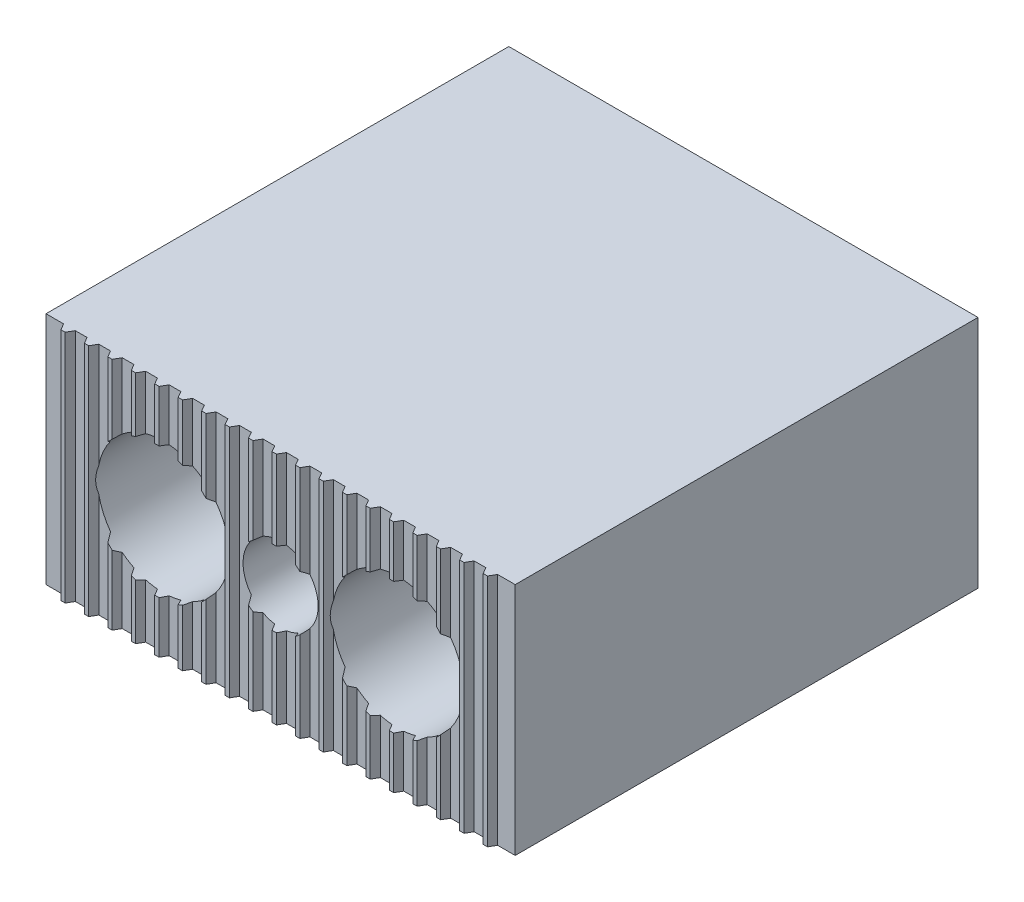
ISO-10303-21;
HEADER;
FILE_DESCRIPTION(('STEP AP214'),'2;1');
FILE_NAME('part.step','',(''),(''),'','','');
FILE_SCHEMA(('AUTOMOTIVE_DESIGN { 1 0 10303 214 1 1 1 1 }'));
ENDSEC;
DATA;
#1=APPLICATION_CONTEXT('core data for automotive mechanical design processes');
#2=APPLICATION_PROTOCOL_DEFINITION('international standard','automotive_design',2000,#1);
#3=PRODUCT_CONTEXT('',#1,'mechanical');
#4=PRODUCT('Part','Part','',(#3));
#5=PRODUCT_RELATED_PRODUCT_CATEGORY('part','',(#4));
#6=PRODUCT_DEFINITION_FORMATION('','',#4);
#7=PRODUCT_DEFINITION_CONTEXT('part definition',#1,'design');
#8=PRODUCT_DEFINITION('design','',#6,#7);
#9=PRODUCT_DEFINITION_SHAPE('','',#8);
#10=(LENGTH_UNIT() NAMED_UNIT(*) SI_UNIT(.MILLI.,.METRE.));
#11=(NAMED_UNIT(*) PLANE_ANGLE_UNIT() SI_UNIT($,.RADIAN.));
#12=(NAMED_UNIT(*) SI_UNIT($,.STERADIAN.) SOLID_ANGLE_UNIT());
#13=UNCERTAINTY_MEASURE_WITH_UNIT(LENGTH_MEASURE(1.E-05),#10,'distance_accuracy_value','');
#14=(GEOMETRIC_REPRESENTATION_CONTEXT(3) GLOBAL_UNCERTAINTY_ASSIGNED_CONTEXT((#13)) GLOBAL_UNIT_ASSIGNED_CONTEXT((#10,
#11,#12)) REPRESENTATION_CONTEXT('',''));
#15=CARTESIAN_POINT('',(0.,0.,0.));
#16=DIRECTION('',(0.,0.,1.));
#17=DIRECTION('',(1.,0.,0.));
#18=AXIS2_PLACEMENT_3D('',#15,#16,#17);
#19=CARTESIAN_POINT('',(9.76905989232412,12.5,50.));
#20=DIRECTION('',(-0.866025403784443,0.,0.499999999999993));
#21=DIRECTION('',(0.499999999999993,0.,0.866025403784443));
#22=AXIS2_PLACEMENT_3D('',#19,#20,#21);
#23=PLANE('',#22);
#24=CARTESIAN_POINT('',(12.5,0.,54.7301270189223));
#25=DIRECTION('',(-0.866025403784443,0.,0.499999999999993));
#26=DIRECTION('',(0.499999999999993,0.,0.866025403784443));
#27=AXIS2_PLACEMENT_3D('',#24,#25,#26);
#28=ELLIPSE('',#27,8.00000000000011,4.);
#29=CARTESIAN_POINT('',(9.76905989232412,2.92266421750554,50.));
#30=VERTEX_POINT('',#29);
#31=CARTESIAN_POINT('',(9.37646170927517,2.49870137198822,49.32));
#32=VERTEX_POINT('',#31);
#33=EDGE_CURVE('E1540',#30,#32,#28,.T.);
#34=ORIENTED_EDGE('',*,*,#33,.F.);
#35=DIRECTION('',(0.,-1.,0.));
#36=VECTOR('',#35,1.);
#37=CARTESIAN_POINT('',(9.76905989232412,12.5,50.));
#38=LINE('',#37,#36);
#39=CARTESIAN_POINT('',(9.76905989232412,12.5,50.));
#40=VERTEX_POINT('',#39);
#41=EDGE_CURVE('E907',#40,#30,#38,.T.);
#42=ORIENTED_EDGE('',*,*,#41,.F.);
#43=DIRECTION('',(-0.499999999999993,0.,-0.866025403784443));
#44=VECTOR('',#43,1.);
#45=CARTESIAN_POINT('',(9.76905989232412,12.5,50.));
#46=LINE('',#45,#44);
#47=CARTESIAN_POINT('',(9.37646170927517,12.5,49.32));
#48=VERTEX_POINT('',#47);
#49=EDGE_CURVE('E1279',#40,#48,#46,.T.);
#50=ORIENTED_EDGE('',*,*,#49,.T.);
#51=DIRECTION('',(0.,-1.,0.));
#52=VECTOR('',#51,1.);
#53=CARTESIAN_POINT('',(9.37646170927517,12.5,49.32));
#54=LINE('',#53,#52);
#55=EDGE_CURVE('E911',#48,#32,#54,.T.);
#56=ORIENTED_EDGE('',*,*,#55,.T.);
#57=EDGE_LOOP('',(#34,#42,#50,#56));
#58=FACE_BOUND('',#57,.T.);
#59=ADVANCED_FACE('F14',(#58),#23,.T.);
#60=CARTESIAN_POINT('',(10.2309401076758,12.5,50.));
#61=DIRECTION('',(0.,0.,1.));
#62=DIRECTION('',(1.,0.,0.));
#63=AXIS2_PLACEMENT_3D('',#60,#61,#62);
#64=PLANE('',#63);
#65=CARTESIAN_POINT('',(12.5,0.,50.));
#66=DIRECTION('',(0.,0.,1.));
#67=DIRECTION('',(1.,0.,0.));
#68=AXIS2_PLACEMENT_3D('',#65,#66,#67);
#69=CIRCLE('',#68,4.);
#70=CARTESIAN_POINT('',(10.2309401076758,3.29414134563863,50.));
#71=VERTEX_POINT('',#70);
#72=EDGE_CURVE('E1837',#71,#30,#69,.T.);
#73=ORIENTED_EDGE('',*,*,#72,.F.);
#74=DIRECTION('',(0.,-1.,0.));
#75=VECTOR('',#74,1.);
#76=CARTESIAN_POINT('',(10.2309401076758,12.5,50.));
#77=LINE('',#76,#75);
#78=CARTESIAN_POINT('',(10.2309401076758,12.5,50.));
#79=VERTEX_POINT('',#78);
#80=EDGE_CURVE('E903',#79,#71,#77,.T.);
#81=ORIENTED_EDGE('',*,*,#80,.F.);
#82=DIRECTION('',(-1.,0.,0.));
#83=VECTOR('',#82,1.);
#84=CARTESIAN_POINT('',(10.2309401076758,12.5,50.));
#85=LINE('',#84,#83);
#86=EDGE_CURVE('E1276',#79,#40,#85,.T.);
#87=ORIENTED_EDGE('',*,*,#86,.T.);
#88=ORIENTED_EDGE('',*,*,#41,.T.);
#89=EDGE_LOOP('',(#73,#81,#87,#88));
#90=FACE_BOUND('',#89,.T.);
#91=ADVANCED_FACE('F1836',(#90),#64,.T.);
#92=CARTESIAN_POINT('',(10.2309401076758,12.5,50.));
#93=DIRECTION('',(-0.866025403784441,0.,-0.5));
#94=DIRECTION('',(-0.5,0.,0.866025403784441));
#95=AXIS2_PLACEMENT_3D('',#92,#93,#94);
#96=PLANE('',#95);
#97=ORIENTED_EDGE('',*,*,#80,.T.);
#98=CARTESIAN_POINT('',(12.5,0.,46.0698729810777));
#99=DIRECTION('',(-0.866025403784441,0.,-0.5));
#100=DIRECTION('',(-0.5,0.,0.866025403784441));
#101=AXIS2_PLACEMENT_3D('',#98,#99,#100);
#102=ELLIPSE('',#101,8.,4.);
#103=CARTESIAN_POINT('',(10.6235382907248,3.53254744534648,49.32));
#104=VERTEX_POINT('',#103);
#105=EDGE_CURVE('E1536',#71,#104,#102,.T.);
#106=ORIENTED_EDGE('',*,*,#105,.T.);
#107=DIRECTION('',(0.,-1.,0.));
#108=VECTOR('',#107,1.);
#109=CARTESIAN_POINT('',(10.6235382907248,12.5,49.32));
#110=LINE('',#109,#108);
#111=CARTESIAN_POINT('',(10.6235382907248,12.5,49.32));
#112=VERTEX_POINT('',#111);
#113=EDGE_CURVE('E899',#112,#104,#110,.T.);
#114=ORIENTED_EDGE('',*,*,#113,.F.);
#115=DIRECTION('',(0.5,0.,-0.866025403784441));
#116=VECTOR('',#115,1.);
#117=CARTESIAN_POINT('',(10.2309401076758,12.5,50.));
#118=LINE('',#117,#116);
#119=EDGE_CURVE('E1273',#79,#112,#118,.T.);
#120=ORIENTED_EDGE('',*,*,#119,.F.);
#121=EDGE_LOOP('',(#97,#106,#114,#120));
#122=FACE_BOUND('',#121,.T.);
#123=ADVANCED_FACE('F1841',(#122),#96,.F.);
#124=CARTESIAN_POINT('',(11.8764617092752,12.5,49.32));
#125=DIRECTION('',(0.,0.,1.));
#126=DIRECTION('',(1.,0.,0.));
#127=AXIS2_PLACEMENT_3D('',#124,#125,#126);
#128=PLANE('',#127);
#129=CARTESIAN_POINT('',(12.5,0.,49.32));
#130=DIRECTION('',(0.,0.,1.));
#131=DIRECTION('',(1.,0.,0.));
#132=AXIS2_PLACEMENT_3D('',#129,#130,#131);
#133=CIRCLE('',#132,4.);
#134=CARTESIAN_POINT('',(11.8764617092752,3.9511011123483,49.32));
#135=VERTEX_POINT('',#134);
#136=EDGE_CURVE('E1533',#135,#104,#133,.T.);
#137=ORIENTED_EDGE('',*,*,#136,.F.);
#138=DIRECTION('',(0.,-1.,0.));
#139=VECTOR('',#138,1.);
#140=CARTESIAN_POINT('',(11.8764617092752,12.5,49.32));
#141=LINE('',#140,#139);
#142=CARTESIAN_POINT('',(11.8764617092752,12.5,49.32));
#143=VERTEX_POINT('',#142);
#144=EDGE_CURVE('E895',#143,#135,#141,.T.);
#145=ORIENTED_EDGE('',*,*,#144,.F.);
#146=DIRECTION('',(-1.,0.,0.));
#147=VECTOR('',#146,1.);
#148=CARTESIAN_POINT('',(11.8764617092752,12.5,49.32));
#149=LINE('',#148,#147);
#150=EDGE_CURVE('E1270',#143,#112,#149,.T.);
#151=ORIENTED_EDGE('',*,*,#150,.T.);
#152=ORIENTED_EDGE('',*,*,#113,.T.);
#153=EDGE_LOOP('',(#137,#145,#151,#152));
#154=FACE_BOUND('',#153,.T.);
#155=ADVANCED_FACE('F1845',(#154),#128,.T.);
#156=CARTESIAN_POINT('',(12.2690598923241,12.5,50.));
#157=DIRECTION('',(-0.866025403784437,0.,0.5));
#158=DIRECTION('',(0.5,0.,0.866025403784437));
#159=AXIS2_PLACEMENT_3D('',#156,#157,#158);
#160=PLANE('',#159);
#161=CARTESIAN_POINT('',(12.5,0.,50.4));
#162=DIRECTION('',(-0.866025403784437,0.,0.5));
#163=DIRECTION('',(0.5,0.,0.866025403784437));
#164=AXIS2_PLACEMENT_3D('',#161,#162,#163);
#165=ELLIPSE('',#164,8.,4.);
#166=CARTESIAN_POINT('',(12.2690598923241,3.99332776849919,50.));
#167=VERTEX_POINT('',#166);
#168=EDGE_CURVE('E1530',#167,#135,#165,.T.);
#169=ORIENTED_EDGE('',*,*,#168,.F.);
#170=DIRECTION('',(0.,-1.,0.));
#171=VECTOR('',#170,1.);
#172=CARTESIAN_POINT('',(12.2690598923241,12.5,50.));
#173=LINE('',#172,#171);
#174=CARTESIAN_POINT('',(12.2690598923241,12.5,50.));
#175=VERTEX_POINT('',#174);
#176=EDGE_CURVE('E891',#175,#167,#173,.T.);
#177=ORIENTED_EDGE('',*,*,#176,.F.);
#178=DIRECTION('',(-0.5,0.,-0.866025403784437));
#179=VECTOR('',#178,1.);
#180=CARTESIAN_POINT('',(12.2690598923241,12.5,50.));
#181=LINE('',#180,#179);
#182=EDGE_CURVE('E1267',#175,#143,#181,.T.);
#183=ORIENTED_EDGE('',*,*,#182,.T.);
#184=ORIENTED_EDGE('',*,*,#144,.T.);
#185=EDGE_LOOP('',(#169,#177,#183,#184));
#186=FACE_BOUND('',#185,.T.);
#187=ADVANCED_FACE('F1850',(#186),#160,.T.);
#188=CARTESIAN_POINT('',(12.7309401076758,12.5,50.));
#189=DIRECTION('',(0.,0.,1.));
#190=DIRECTION('',(1.,0.,0.));
#191=AXIS2_PLACEMENT_3D('',#188,#189,#190);
#192=PLANE('',#191);
#193=CARTESIAN_POINT('',(12.7309401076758,3.99332776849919,50.));
#194=VERTEX_POINT('',#193);
#195=EDGE_CURVE('E863',#194,#167,#69,.T.);
#196=ORIENTED_EDGE('',*,*,#195,.F.);
#197=DIRECTION('',(0.,-1.,0.));
#198=VECTOR('',#197,1.);
#199=CARTESIAN_POINT('',(12.7309401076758,12.5,50.));
#200=LINE('',#199,#198);
#201=CARTESIAN_POINT('',(12.7309401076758,12.5,50.));
#202=VERTEX_POINT('',#201);
#203=EDGE_CURVE('E887',#202,#194,#200,.T.);
#204=ORIENTED_EDGE('',*,*,#203,.F.);
#205=DIRECTION('',(-1.,0.,0.));
#206=VECTOR('',#205,1.);
#207=CARTESIAN_POINT('',(12.7309401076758,12.5,50.));
#208=LINE('',#207,#206);
#209=EDGE_CURVE('E1264',#202,#175,#208,.T.);
#210=ORIENTED_EDGE('',*,*,#209,.T.);
#211=ORIENTED_EDGE('',*,*,#176,.T.);
#212=EDGE_LOOP('',(#196,#204,#210,#211));
#213=FACE_BOUND('',#212,.T.);
#214=ADVANCED_FACE('F1853',(#213),#192,.T.);
#215=CARTESIAN_POINT('',(12.7309401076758,12.5,50.));
#216=DIRECTION('',(-0.866025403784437,0.,-0.5));
#217=DIRECTION('',(-0.5,0.,0.866025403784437));
#218=AXIS2_PLACEMENT_3D('',#215,#216,#217);
#219=PLANE('',#218);
#220=ORIENTED_EDGE('',*,*,#203,.T.);
#221=CARTESIAN_POINT('',(12.5,0.,50.4));
#222=DIRECTION('',(-0.866025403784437,0.,-0.5));
#223=DIRECTION('',(-0.5,0.,0.866025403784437));
#224=AXIS2_PLACEMENT_3D('',#221,#222,#223);
#225=ELLIPSE('',#224,8.,4.);
#226=CARTESIAN_POINT('',(13.1235382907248,3.9511011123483,49.32));
#227=VERTEX_POINT('',#226);
#228=EDGE_CURVE('E1518',#194,#227,#225,.T.);
#229=ORIENTED_EDGE('',*,*,#228,.T.);
#230=DIRECTION('',(0.,-1.,0.));
#231=VECTOR('',#230,1.);
#232=CARTESIAN_POINT('',(13.1235382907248,12.5,49.32));
#233=LINE('',#232,#231);
#234=CARTESIAN_POINT('',(13.1235382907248,12.5,49.32));
#235=VERTEX_POINT('',#234);
#236=EDGE_CURVE('E883',#235,#227,#233,.T.);
#237=ORIENTED_EDGE('',*,*,#236,.F.);
#238=DIRECTION('',(0.5,0.,-0.866025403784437));
#239=VECTOR('',#238,1.);
#240=CARTESIAN_POINT('',(12.7309401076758,12.5,50.));
#241=LINE('',#240,#239);
#242=EDGE_CURVE('E1261',#202,#235,#241,.T.);
#243=ORIENTED_EDGE('',*,*,#242,.F.);
#244=EDGE_LOOP('',(#220,#229,#237,#243));
#245=FACE_BOUND('',#244,.T.);
#246=ADVANCED_FACE('F1856',(#245),#219,.F.);
#247=CARTESIAN_POINT('',(14.3764617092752,12.5,49.32));
#248=DIRECTION('',(0.,0.,1.));
#249=DIRECTION('',(1.,0.,0.));
#250=AXIS2_PLACEMENT_3D('',#247,#248,#249);
#251=PLANE('',#250);
#252=CARTESIAN_POINT('',(12.5,0.,49.32));
#253=DIRECTION('',(0.,0.,1.));
#254=DIRECTION('',(1.,0.,0.));
#255=AXIS2_PLACEMENT_3D('',#252,#253,#254);
#256=CIRCLE('',#255,4.);
#257=CARTESIAN_POINT('',(14.3764617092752,3.53254744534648,49.32));
#258=VERTEX_POINT('',#257);
#259=EDGE_CURVE('E1515',#258,#227,#256,.T.);
#260=ORIENTED_EDGE('',*,*,#259,.F.);
#261=DIRECTION('',(0.,-1.,0.));
#262=VECTOR('',#261,1.);
#263=CARTESIAN_POINT('',(14.3764617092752,12.5,49.32));
#264=LINE('',#263,#262);
#265=CARTESIAN_POINT('',(14.3764617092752,12.5,49.32));
#266=VERTEX_POINT('',#265);
#267=EDGE_CURVE('E879',#266,#258,#264,.T.);
#268=ORIENTED_EDGE('',*,*,#267,.F.);
#269=DIRECTION('',(-1.,0.,0.));
#270=VECTOR('',#269,1.);
#271=CARTESIAN_POINT('',(14.3764617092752,12.5,49.32));
#272=LINE('',#271,#270);
#273=EDGE_CURVE('E1258',#266,#235,#272,.T.);
#274=ORIENTED_EDGE('',*,*,#273,.T.);
#275=ORIENTED_EDGE('',*,*,#236,.T.);
#276=EDGE_LOOP('',(#260,#268,#274,#275));
#277=FACE_BOUND('',#276,.T.);
#278=ADVANCED_FACE('F1859',(#277),#251,.T.);
#279=CARTESIAN_POINT('',(14.7690598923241,12.5,50.));
#280=DIRECTION('',(-0.866025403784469,0.,0.499999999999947));
#281=DIRECTION('',(0.499999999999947,0.,0.866025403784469));
#282=AXIS2_PLACEMENT_3D('',#279,#280,#281);
#283=PLANE('',#282);
#284=CARTESIAN_POINT('',(12.5,0.,46.0698729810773));
#285=DIRECTION('',(-0.866025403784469,0.,0.499999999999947));
#286=DIRECTION('',(0.499999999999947,0.,0.866025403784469));
#287=AXIS2_PLACEMENT_3D('',#284,#285,#286);
#288=ELLIPSE('',#287,8.00000000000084,4.);
#289=CARTESIAN_POINT('',(14.7690598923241,3.29414134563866,50.));
#290=VERTEX_POINT('',#289);
#291=EDGE_CURVE('E1513',#290,#258,#288,.T.);
#292=ORIENTED_EDGE('',*,*,#291,.F.);
#293=DIRECTION('',(0.,-1.,0.));
#294=VECTOR('',#293,1.);
#295=CARTESIAN_POINT('',(14.7690598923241,12.5,50.));
#296=LINE('',#295,#294);
#297=CARTESIAN_POINT('',(14.7690598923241,12.5,50.));
#298=VERTEX_POINT('',#297);
#299=EDGE_CURVE('E861',#298,#290,#296,.T.);
#300=ORIENTED_EDGE('',*,*,#299,.F.);
#301=DIRECTION('',(-0.499999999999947,0.,-0.866025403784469));
#302=VECTOR('',#301,1.);
#303=CARTESIAN_POINT('',(14.7690598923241,12.5,50.));
#304=LINE('',#303,#302);
#305=EDGE_CURVE('E1255',#298,#266,#304,.T.);
#306=ORIENTED_EDGE('',*,*,#305,.T.);
#307=ORIENTED_EDGE('',*,*,#267,.T.);
#308=EDGE_LOOP('',(#292,#300,#306,#307));
#309=FACE_BOUND('',#308,.T.);
#310=ADVANCED_FACE('F1512',(#309),#283,.T.);
#311=CARTESIAN_POINT('',(15.2309401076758,12.5,50.));
#312=DIRECTION('',(0.,0.,1.));
#313=DIRECTION('',(1.,0.,0.));
#314=AXIS2_PLACEMENT_3D('',#311,#312,#313);
#315=PLANE('',#314);
#316=CARTESIAN_POINT('',(15.2309401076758,2.92266421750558,50.));
#317=VERTEX_POINT('',#316);
#318=EDGE_CURVE('E848',#317,#290,#69,.T.);
#319=ORIENTED_EDGE('',*,*,#318,.F.);
#320=DIRECTION('',(0.,-1.,0.));
#321=VECTOR('',#320,1.);
#322=CARTESIAN_POINT('',(15.2309401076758,12.5,50.));
#323=LINE('',#322,#321);
#324=CARTESIAN_POINT('',(15.2309401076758,12.5,50.));
#325=VERTEX_POINT('',#324);
#326=EDGE_CURVE('E859',#325,#317,#323,.T.);
#327=ORIENTED_EDGE('',*,*,#326,.F.);
#328=DIRECTION('',(-1.,0.,0.));
#329=VECTOR('',#328,1.);
#330=CARTESIAN_POINT('',(15.2309401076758,12.5,50.));
#331=LINE('',#330,#329);
#332=EDGE_CURVE('E1253',#325,#298,#331,.T.);
#333=ORIENTED_EDGE('',*,*,#332,.T.);
#334=ORIENTED_EDGE('',*,*,#299,.T.);
#335=EDGE_LOOP('',(#319,#327,#333,#334));
#336=FACE_BOUND('',#335,.T.);
#337=ADVANCED_FACE('F857',(#336),#315,.T.);
#338=CARTESIAN_POINT('',(15.2309401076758,12.5,50.));
#339=DIRECTION('',(-0.866025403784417,0.,-0.500000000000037));
#340=DIRECTION('',(-0.500000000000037,0.,0.866025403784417));
#341=AXIS2_PLACEMENT_3D('',#338,#339,#340);
#342=PLANE('',#341);
#343=ORIENTED_EDGE('',*,*,#326,.T.);
#344=CARTESIAN_POINT('',(12.5,0.,54.7301270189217));
#345=DIRECTION('',(-0.866025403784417,0.,-0.500000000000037));
#346=DIRECTION('',(-0.500000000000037,0.,0.866025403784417));
#347=AXIS2_PLACEMENT_3D('',#344,#345,#346);
#348=ELLIPSE('',#347,7.99999999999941,4.);
#349=CARTESIAN_POINT('',(15.6235382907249,2.49870137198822,49.32));
#350=VERTEX_POINT('',#349);
#351=EDGE_CURVE('E844',#317,#350,#348,.T.);
#352=ORIENTED_EDGE('',*,*,#351,.T.);
#353=DIRECTION('',(0.,-1.,0.));
#354=VECTOR('',#353,1.);
#355=CARTESIAN_POINT('',(15.6235382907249,12.5,49.32));
#356=LINE('',#355,#354);
#357=CARTESIAN_POINT('',(15.6235382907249,12.5,49.32));
#358=VERTEX_POINT('',#357);
#359=EDGE_CURVE('E874',#358,#350,#356,.T.);
#360=ORIENTED_EDGE('',*,*,#359,.F.);
#361=DIRECTION('',(0.500000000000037,0.,-0.866025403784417));
#362=VECTOR('',#361,1.);
#363=CARTESIAN_POINT('',(15.2309401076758,12.5,50.));
#364=LINE('',#363,#362);
#365=EDGE_CURVE('E869',#325,#358,#364,.T.);
#366=ORIENTED_EDGE('',*,*,#365,.F.);
#367=EDGE_LOOP('',(#343,#352,#360,#366));
#368=FACE_BOUND('',#367,.T.);
#369=ADVANCED_FACE('F867',(#368),#342,.F.);
#370=CARTESIAN_POINT('',(-12.5,12.5,0.));
#371=DIRECTION('',(0.,0.,-1.));
#372=DIRECTION('',(-1.,0.,0.));
#373=AXIS2_PLACEMENT_3D('',#370,#371,#372);
#374=PLANE('',#373);
#375=CARTESIAN_POINT('',(25.,0.,0.));
#376=DIRECTION('',(0.,0.,-1.));
#377=DIRECTION('',(-1.,0.,0.));
#378=AXIS2_PLACEMENT_3D('',#375,#376,#377);
#379=CIRCLE('',#378,4.5);
#380=CARTESIAN_POINT('',(20.5,0.,0.));
#381=VERTEX_POINT('',#380);
#382=EDGE_CURVE('E1613',#381,#381,#379,.T.);
#383=ORIENTED_EDGE('',*,*,#382,.F.);
#384=EDGE_LOOP('',(#383));
#385=FACE_BOUND('',#384,.T.);
#386=DIRECTION('',(0.,-1.,0.));
#387=VECTOR('',#386,1.);
#388=CARTESIAN_POINT('',(-12.5,12.5,0.));
#389=LINE('',#388,#387);
#390=CARTESIAN_POINT('',(-12.5,12.5,0.));
#391=VERTEX_POINT('',#390);
#392=CARTESIAN_POINT('',(-12.5,-12.5,0.));
#393=VERTEX_POINT('',#392);
#394=EDGE_CURVE('E1024',#391,#393,#389,.T.);
#395=ORIENTED_EDGE('',*,*,#394,.F.);
#396=DIRECTION('',(1.,0.,0.));
#397=VECTOR('',#396,1.);
#398=CARTESIAN_POINT('',(-12.5,12.5,0.));
#399=LINE('',#398,#397);
#400=CARTESIAN_POINT('',(37.5,12.5,0.));
#401=VERTEX_POINT('',#400);
#402=EDGE_CURVE('E1383',#391,#401,#399,.T.);
#403=ORIENTED_EDGE('',*,*,#402,.T.);
#404=DIRECTION('',(0.,-1.,0.));
#405=VECTOR('',#404,1.);
#406=CARTESIAN_POINT('',(37.5,12.5,0.));
#407=LINE('',#406,#405);
#408=CARTESIAN_POINT('',(37.5,-12.5,0.));
#409=VERTEX_POINT('',#408);
#410=EDGE_CURVE('E1026',#401,#409,#407,.T.);
#411=ORIENTED_EDGE('',*,*,#410,.T.);
#412=DIRECTION('',(1.,0.,0.));
#413=VECTOR('',#412,1.);
#414=CARTESIAN_POINT('',(-12.5,-12.5,0.));
#415=LINE('',#414,#413);
#416=EDGE_CURVE('E1145',#393,#409,#415,.T.);
#417=ORIENTED_EDGE('',*,*,#416,.F.);
#418=EDGE_LOOP('',(#395,#403,#411,#417));
#419=FACE_BOUND('',#418,.T.);
#420=CARTESIAN_POINT('',(0.,0.,0.));
#421=DIRECTION('',(0.,0.,-1.));
#422=DIRECTION('',(-1.,0.,0.));
#423=AXIS2_PLACEMENT_3D('',#420,#421,#422);
#424=CIRCLE('',#423,4.5);
#425=CARTESIAN_POINT('',(-4.5,0.,0.));
#426=VERTEX_POINT('',#425);
#427=EDGE_CURVE('E1543',#426,#426,#424,.T.);
#428=ORIENTED_EDGE('',*,*,#427,.F.);
#429=EDGE_LOOP('',(#428));
#430=FACE_BOUND('',#429,.T.);
#431=ADVANCED_FACE('F16',(#385,#419,#430),#374,.T.);
#432=CARTESIAN_POINT('',(-7.26905989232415,12.5,50.));
#433=DIRECTION('',(-0.866025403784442,0.,-0.5));
#434=DIRECTION('',(-0.5,0.,0.866025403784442));
#435=AXIS2_PLACEMENT_3D('',#432,#433,#434);
#436=PLANE('',#435);
#437=CARTESIAN_POINT('',(0.,0.,37.4096189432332));
#438=DIRECTION('',(-0.866025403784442,0.,-0.5));
#439=DIRECTION('',(0.5,0.,-0.866025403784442));
#440=AXIS2_PLACEMENT_3D('',#437,#438,#439);
#441=ELLIPSE('',#440,14.0000000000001,7.);
#442=CARTESIAN_POINT('',(-6.8764617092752,1.30930300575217,49.32));
#443=VERTEX_POINT('',#442);
#444=CARTESIAN_POINT('',(-6.8764617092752,-1.30930300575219,49.32));
#445=VERTEX_POINT('',#444);
#446=EDGE_CURVE('E1610',#443,#445,#441,.F.);
#447=ORIENTED_EDGE('',*,*,#446,.F.);
#448=DIRECTION('',(0.,-1.,0.));
#449=VECTOR('',#448,1.);
#450=CARTESIAN_POINT('',(-6.8764617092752,12.5,49.32));
#451=LINE('',#450,#449);
#452=CARTESIAN_POINT('',(-6.8764617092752,12.5,49.32));
#453=VERTEX_POINT('',#452);
#454=EDGE_CURVE('E1005',#453,#443,#451,.T.);
#455=ORIENTED_EDGE('',*,*,#454,.F.);
#456=DIRECTION('',(0.5,0.,-0.866025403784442));
#457=VECTOR('',#456,1.);
#458=CARTESIAN_POINT('',(-7.26905989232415,12.5,50.));
#459=LINE('',#458,#457);
#460=CARTESIAN_POINT('',(-7.26905989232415,12.5,50.));
#461=VERTEX_POINT('',#460);
#462=EDGE_CURVE('E1356',#461,#453,#459,.T.);
#463=ORIENTED_EDGE('',*,*,#462,.F.);
#464=DIRECTION('',(0.,-1.,0.));
#465=VECTOR('',#464,1.);
#466=CARTESIAN_POINT('',(-7.26905989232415,12.5,50.));
#467=LINE('',#466,#465);
#468=CARTESIAN_POINT('',(-7.26905989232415,-12.5,50.));
#469=VERTEX_POINT('',#468);
#470=EDGE_CURVE('E1008',#461,#469,#467,.T.);
#471=ORIENTED_EDGE('',*,*,#470,.T.);
#472=DIRECTION('',(0.5,0.,-0.866025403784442));
#473=VECTOR('',#472,1.);
#474=CARTESIAN_POINT('',(-7.26905989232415,-12.5,50.));
#475=LINE('',#474,#473);
#476=CARTESIAN_POINT('',(-6.8764617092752,-12.5,49.32));
#477=VERTEX_POINT('',#476);
#478=EDGE_CURVE('E1118',#469,#477,#475,.T.);
#479=ORIENTED_EDGE('',*,*,#478,.T.);
#480=EDGE_CURVE('E1004',#445,#477,#451,.T.);
#481=ORIENTED_EDGE('',*,*,#480,.F.);
#482=EDGE_LOOP('',(#447,#455,#463,#471,#479,#481));
#483=FACE_BOUND('',#482,.T.);
#484=ADVANCED_FACE('F2044',(#483),#436,.F.);
#485=CARTESIAN_POINT('',(-5.6235382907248,12.5,49.32));
#486=DIRECTION('',(0.,0.,1.));
#487=DIRECTION('',(1.,0.,0.));
#488=AXIS2_PLACEMENT_3D('',#485,#486,#487);
#489=PLANE('',#488);
#490=DIRECTION('',(0.,-1.,0.));
#491=VECTOR('',#490,1.);
#492=CARTESIAN_POINT('',(-5.6235382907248,12.5,49.32));
#493=LINE('',#492,#491);
#494=CARTESIAN_POINT('',(-5.6235382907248,-4.1684310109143,49.32));
#495=VERTEX_POINT('',#494);
#496=CARTESIAN_POINT('',(-5.6235382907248,-12.5,49.32));
#497=VERTEX_POINT('',#496);
#498=EDGE_CURVE('E1000',#495,#497,#493,.T.);
#499=ORIENTED_EDGE('',*,*,#498,.F.);
#500=CARTESIAN_POINT('',(0.,0.,49.32));
#501=DIRECTION('',(0.,0.,1.));
#502=DIRECTION('',(1.,0.,0.));
#503=AXIS2_PLACEMENT_3D('',#500,#501,#502);
#504=CIRCLE('',#503,7.);
#505=EDGE_CURVE('E1606',#495,#445,#504,.F.);
#506=ORIENTED_EDGE('',*,*,#505,.T.);
#507=ORIENTED_EDGE('',*,*,#480,.T.);
#508=DIRECTION('',(-1.,0.,0.));
#509=VECTOR('',#508,1.);
#510=CARTESIAN_POINT('',(-5.6235382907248,-12.5,49.32));
#511=LINE('',#510,#509);
#512=EDGE_CURVE('E1115',#497,#477,#511,.T.);
#513=ORIENTED_EDGE('',*,*,#512,.F.);
#514=EDGE_LOOP('',(#499,#506,#507,#513));
#515=FACE_BOUND('',#514,.T.);
#516=ADVANCED_FACE('F2374',(#515),#489,.T.);
#517=ORIENTED_EDGE('',*,*,#454,.T.);
#518=CARTESIAN_POINT('',(-5.6235382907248,4.16843101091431,49.32));
#519=VERTEX_POINT('',#518);
#520=EDGE_CURVE('E1611',#443,#519,#504,.F.);
#521=ORIENTED_EDGE('',*,*,#520,.T.);
#522=CARTESIAN_POINT('',(-5.6235382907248,12.5,49.32));
#523=VERTEX_POINT('',#522);
#524=EDGE_CURVE('E1001',#523,#519,#493,.T.);
#525=ORIENTED_EDGE('',*,*,#524,.F.);
#526=DIRECTION('',(-1.,0.,0.));
#527=VECTOR('',#526,1.);
#528=CARTESIAN_POINT('',(-5.6235382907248,12.5,49.32));
#529=LINE('',#528,#527);
#530=EDGE_CURVE('E1353',#523,#453,#529,.T.);
#531=ORIENTED_EDGE('',*,*,#530,.T.);
#532=EDGE_LOOP('',(#517,#521,#525,#531));
#533=FACE_BOUND('',#532,.T.);
#534=ADVANCED_FACE('F2049',(#533),#489,.T.);
#535=CARTESIAN_POINT('',(-5.2309401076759,12.5,50.));
#536=DIRECTION('',(-0.866025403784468,0.,0.499999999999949));
#537=DIRECTION('',(0.499999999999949,0.,0.866025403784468));
#538=AXIS2_PLACEMENT_3D('',#535,#536,#537);
#539=PLANE('',#538);
#540=ORIENTED_EDGE('',*,*,#524,.T.);
#541=CARTESIAN_POINT('',(0.,0.,59.0602540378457));
#542=DIRECTION('',(-0.866025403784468,0.,0.499999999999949));
#543=DIRECTION('',(-0.499999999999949,0.,-0.866025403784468));
#544=AXIS2_PLACEMENT_3D('',#541,#542,#543);
#545=ELLIPSE('',#544,14.0000000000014,7.);
#546=CARTESIAN_POINT('',(-5.2309401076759,4.65158742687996,50.));
#547=VERTEX_POINT('',#546);
#548=EDGE_CURVE('E1607',#519,#547,#545,.F.);
#549=ORIENTED_EDGE('',*,*,#548,.T.);
#550=DIRECTION('',(0.,-1.,0.));
#551=VECTOR('',#550,1.);
#552=CARTESIAN_POINT('',(-5.2309401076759,12.5,50.));
#553=LINE('',#552,#551);
#554=CARTESIAN_POINT('',(-5.2309401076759,12.5,50.));
#555=VERTEX_POINT('',#554);
#556=EDGE_CURVE('E997',#555,#547,#553,.T.);
#557=ORIENTED_EDGE('',*,*,#556,.F.);
#558=DIRECTION('',(-0.499999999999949,0.,-0.866025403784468));
#559=VECTOR('',#558,1.);
#560=CARTESIAN_POINT('',(-5.2309401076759,12.5,50.));
#561=LINE('',#560,#559);
#562=EDGE_CURVE('E1350',#555,#523,#561,.T.);
#563=ORIENTED_EDGE('',*,*,#562,.T.);
#564=EDGE_LOOP('',(#540,#549,#557,#563));
#565=FACE_BOUND('',#564,.T.);
#566=ADVANCED_FACE('F2053',(#565),#539,.T.);
#567=CARTESIAN_POINT('',(-5.2309401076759,-4.65158742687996,50.));
#568=VERTEX_POINT('',#567);
#569=CARTESIAN_POINT('',(-5.2309401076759,-12.5,50.));
#570=VERTEX_POINT('',#569);
#571=EDGE_CURVE('E996',#568,#570,#553,.T.);
#572=ORIENTED_EDGE('',*,*,#571,.F.);
#573=EDGE_CURVE('E1603',#568,#495,#545,.F.);
#574=ORIENTED_EDGE('',*,*,#573,.T.);
#575=ORIENTED_EDGE('',*,*,#498,.T.);
#576=DIRECTION('',(-0.499999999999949,0.,-0.866025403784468));
#577=VECTOR('',#576,1.);
#578=CARTESIAN_POINT('',(-5.2309401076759,-12.5,50.));
#579=LINE('',#578,#577);
#580=EDGE_CURVE('E1112',#570,#497,#579,.T.);
#581=ORIENTED_EDGE('',*,*,#580,.F.);
#582=EDGE_LOOP('',(#572,#574,#575,#581));
#583=FACE_BOUND('',#582,.T.);
#584=ADVANCED_FACE('F2162',(#583),#539,.T.);
#585=CARTESIAN_POINT('',(-4.76905989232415,12.5,50.));
#586=DIRECTION('',(0.,0.,1.));
#587=DIRECTION('',(1.,0.,0.));
#588=AXIS2_PLACEMENT_3D('',#585,#586,#587);
#589=PLANE('',#588);
#590=DIRECTION('',(0.,-1.,0.));
#591=VECTOR('',#590,1.);
#592=CARTESIAN_POINT('',(-4.76905989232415,12.5,50.));
#593=LINE('',#592,#591);
#594=CARTESIAN_POINT('',(-4.76905989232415,-5.12406749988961,50.));
#595=VERTEX_POINT('',#594);
#596=CARTESIAN_POINT('',(-4.76905989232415,-12.5,50.));
#597=VERTEX_POINT('',#596);
#598=EDGE_CURVE('E992',#595,#597,#593,.T.);
#599=ORIENTED_EDGE('',*,*,#598,.F.);
#600=CARTESIAN_POINT('',(0.,0.,50.));
#601=DIRECTION('',(0.,0.,-1.));
#602=DIRECTION('',(-1.,0.,0.));
#603=AXIS2_PLACEMENT_3D('',#600,#601,#602);
#604=CIRCLE('',#603,7.);
#605=EDGE_CURVE('E1552',#595,#568,#604,.T.);
#606=ORIENTED_EDGE('',*,*,#605,.T.);
#607=ORIENTED_EDGE('',*,*,#571,.T.);
#608=DIRECTION('',(-1.,0.,0.));
#609=VECTOR('',#608,1.);
#610=CARTESIAN_POINT('',(-4.76905989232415,-12.5,50.));
#611=LINE('',#610,#609);
#612=EDGE_CURVE('E1109',#597,#570,#611,.T.);
#613=ORIENTED_EDGE('',*,*,#612,.F.);
#614=EDGE_LOOP('',(#599,#606,#607,#613));
#615=FACE_BOUND('',#614,.T.);
#616=ADVANCED_FACE('F2157',(#615),#589,.T.);
#617=ORIENTED_EDGE('',*,*,#556,.T.);
#618=CARTESIAN_POINT('',(-4.76905989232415,5.12406749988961,50.));
#619=VERTEX_POINT('',#618);
#620=EDGE_CURVE('E1553',#547,#619,#604,.T.);
#621=ORIENTED_EDGE('',*,*,#620,.T.);
#622=CARTESIAN_POINT('',(-4.76905989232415,12.5,50.));
#623=VERTEX_POINT('',#622);
#624=EDGE_CURVE('E993',#623,#619,#593,.T.);
#625=ORIENTED_EDGE('',*,*,#624,.F.);
#626=DIRECTION('',(-1.,0.,0.));
#627=VECTOR('',#626,1.);
#628=CARTESIAN_POINT('',(-4.76905989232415,12.5,50.));
#629=LINE('',#628,#627);
#630=EDGE_CURVE('E1347',#623,#555,#629,.T.);
#631=ORIENTED_EDGE('',*,*,#630,.T.);
#632=EDGE_LOOP('',(#617,#621,#625,#631));
#633=FACE_BOUND('',#632,.T.);
#634=ADVANCED_FACE('F2057',(#633),#589,.T.);
#635=CARTESIAN_POINT('',(-4.76905989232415,12.5,50.));
#636=DIRECTION('',(-0.866025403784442,0.,-0.5));
#637=DIRECTION('',(-0.5,0.,0.866025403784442));
#638=AXIS2_PLACEMENT_3D('',#635,#636,#637);
#639=PLANE('',#638);
#640=CARTESIAN_POINT('',(0.,0.,41.7397459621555));
#641=DIRECTION('',(-0.866025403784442,0.,-0.5));
#642=DIRECTION('',(0.5,0.,-0.866025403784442));
#643=AXIS2_PLACEMENT_3D('',#640,#641,#642);
#644=ELLIPSE('',#643,14.0000000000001,7.);
#645=CARTESIAN_POINT('',(-4.3764617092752,5.46320262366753,49.32));
#646=VERTEX_POINT('',#645);
#647=EDGE_CURVE('E1602',#646,#619,#644,.F.);
#648=ORIENTED_EDGE('',*,*,#647,.F.);
#649=DIRECTION('',(0.,-1.,0.));
#650=VECTOR('',#649,1.);
#651=CARTESIAN_POINT('',(-4.3764617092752,12.5,49.32));
#652=LINE('',#651,#650);
#653=CARTESIAN_POINT('',(-4.3764617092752,12.5,49.32));
#654=VERTEX_POINT('',#653);
#655=EDGE_CURVE('E989',#654,#646,#652,.T.);
#656=ORIENTED_EDGE('',*,*,#655,.F.);
#657=DIRECTION('',(0.5,0.,-0.866025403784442));
#658=VECTOR('',#657,1.);
#659=CARTESIAN_POINT('',(-4.76905989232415,12.5,50.));
#660=LINE('',#659,#658);
#661=EDGE_CURVE('E1344',#623,#654,#660,.T.);
#662=ORIENTED_EDGE('',*,*,#661,.F.);
#663=ORIENTED_EDGE('',*,*,#624,.T.);
#664=EDGE_LOOP('',(#648,#656,#662,#663));
#665=FACE_BOUND('',#664,.T.);
#666=ADVANCED_FACE('F2060',(#665),#639,.F.);
#667=CARTESIAN_POINT('',(-4.3764617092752,-5.46320262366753,49.32));
#668=VERTEX_POINT('',#667);
#669=EDGE_CURVE('E1599',#595,#668,#644,.F.);
#670=ORIENTED_EDGE('',*,*,#669,.F.);
#671=ORIENTED_EDGE('',*,*,#598,.T.);
#672=DIRECTION('',(0.5,0.,-0.866025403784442));
#673=VECTOR('',#672,1.);
#674=CARTESIAN_POINT('',(-4.76905989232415,-12.5,50.));
#675=LINE('',#674,#673);
#676=CARTESIAN_POINT('',(-4.3764617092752,-12.5,49.32));
#677=VERTEX_POINT('',#676);
#678=EDGE_CURVE('E1106',#597,#677,#675,.T.);
#679=ORIENTED_EDGE('',*,*,#678,.T.);
#680=EDGE_CURVE('E988',#668,#677,#652,.T.);
#681=ORIENTED_EDGE('',*,*,#680,.F.);
#682=EDGE_LOOP('',(#670,#671,#679,#681));
#683=FACE_BOUND('',#682,.T.);
#684=ADVANCED_FACE('F2169',(#683),#639,.F.);
#685=CARTESIAN_POINT('',(-3.1235382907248,12.5,49.32));
#686=DIRECTION('',(0.,0.,1.));
#687=DIRECTION('',(1.,0.,0.));
#688=AXIS2_PLACEMENT_3D('',#685,#686,#687);
#689=PLANE('',#688);
#690=DIRECTION('',(0.,-1.,0.));
#691=VECTOR('',#690,1.);
#692=CARTESIAN_POINT('',(-3.1235382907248,12.5,49.32));
#693=LINE('',#692,#691);
#694=CARTESIAN_POINT('',(-3.1235382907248,-6.26446394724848,49.32));
#695=VERTEX_POINT('',#694);
#696=CARTESIAN_POINT('',(-3.1235382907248,-12.5,49.32));
#697=VERTEX_POINT('',#696);
#698=EDGE_CURVE('E984',#695,#697,#693,.T.);
#699=ORIENTED_EDGE('',*,*,#698,.F.);
#700=CARTESIAN_POINT('',(0.,0.,49.32));
#701=DIRECTION('',(0.,0.,1.));
#702=DIRECTION('',(1.,0.,0.));
#703=AXIS2_PLACEMENT_3D('',#700,#701,#702);
#704=CIRCLE('',#703,7.);
#705=EDGE_CURVE('E1595',#695,#668,#704,.F.);
#706=ORIENTED_EDGE('',*,*,#705,.T.);
#707=ORIENTED_EDGE('',*,*,#680,.T.);
#708=DIRECTION('',(-1.,0.,0.));
#709=VECTOR('',#708,1.);
#710=CARTESIAN_POINT('',(-3.1235382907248,-12.5,49.32));
#711=LINE('',#710,#709);
#712=EDGE_CURVE('E1103',#697,#677,#711,.T.);
#713=ORIENTED_EDGE('',*,*,#712,.F.);
#714=EDGE_LOOP('',(#699,#706,#707,#713));
#715=FACE_BOUND('',#714,.T.);
#716=ADVANCED_FACE('F2172',(#715),#689,.T.);
#717=ORIENTED_EDGE('',*,*,#655,.T.);
#718=CARTESIAN_POINT('',(-3.1235382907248,6.26446394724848,49.32));
#719=VERTEX_POINT('',#718);
#720=EDGE_CURVE('E1600',#646,#719,#704,.F.);
#721=ORIENTED_EDGE('',*,*,#720,.T.);
#722=CARTESIAN_POINT('',(-3.1235382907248,12.5,49.32));
#723=VERTEX_POINT('',#722);
#724=EDGE_CURVE('E985',#723,#719,#693,.T.);
#725=ORIENTED_EDGE('',*,*,#724,.F.);
#726=DIRECTION('',(-1.,0.,0.));
#727=VECTOR('',#726,1.);
#728=CARTESIAN_POINT('',(-3.1235382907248,12.5,49.32));
#729=LINE('',#728,#727);
#730=EDGE_CURVE('E1341',#723,#654,#729,.T.);
#731=ORIENTED_EDGE('',*,*,#730,.T.);
#732=EDGE_LOOP('',(#717,#721,#725,#731));
#733=FACE_BOUND('',#732,.T.);
#734=ADVANCED_FACE('F2064',(#733),#689,.T.);
#735=CARTESIAN_POINT('',(-2.7309401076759,12.5,50.));
#736=DIRECTION('',(-0.866025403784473,0.,0.499999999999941));
#737=DIRECTION('',(0.499999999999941,0.,0.866025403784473));
#738=AXIS2_PLACEMENT_3D('',#735,#736,#737);
#739=PLANE('',#738);
#740=ORIENTED_EDGE('',*,*,#724,.T.);
#741=CARTESIAN_POINT('',(0.,0.,54.730127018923));
#742=DIRECTION('',(-0.866025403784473,0.,0.499999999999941));
#743=DIRECTION('',(-0.499999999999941,0.,-0.866025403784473));
#744=AXIS2_PLACEMENT_3D('',#741,#742,#743);
#745=ELLIPSE('',#744,14.0000000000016,7.);
#746=CARTESIAN_POINT('',(-2.7309401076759,6.44530574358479,50.));
#747=VERTEX_POINT('',#746);
#748=EDGE_CURVE('E1596',#719,#747,#745,.F.);
#749=ORIENTED_EDGE('',*,*,#748,.T.);
#750=DIRECTION('',(0.,-1.,0.));
#751=VECTOR('',#750,1.);
#752=CARTESIAN_POINT('',(-2.7309401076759,12.5,50.));
#753=LINE('',#752,#751);
#754=CARTESIAN_POINT('',(-2.7309401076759,12.5,50.));
#755=VERTEX_POINT('',#754);
#756=EDGE_CURVE('E981',#755,#747,#753,.T.);
#757=ORIENTED_EDGE('',*,*,#756,.F.);
#758=DIRECTION('',(-0.499999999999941,0.,-0.866025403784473));
#759=VECTOR('',#758,1.);
#760=CARTESIAN_POINT('',(-2.7309401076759,12.5,50.));
#761=LINE('',#760,#759);
#762=EDGE_CURVE('E1338',#755,#723,#761,.T.);
#763=ORIENTED_EDGE('',*,*,#762,.T.);
#764=EDGE_LOOP('',(#740,#749,#757,#763));
#765=FACE_BOUND('',#764,.T.);
#766=ADVANCED_FACE('F2068',(#765),#739,.T.);
#767=CARTESIAN_POINT('',(-2.7309401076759,-6.44530574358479,50.));
#768=VERTEX_POINT('',#767);
#769=CARTESIAN_POINT('',(-2.7309401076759,-12.5,50.));
#770=VERTEX_POINT('',#769);
#771=EDGE_CURVE('E980',#768,#770,#753,.T.);
#772=ORIENTED_EDGE('',*,*,#771,.F.);
#773=EDGE_CURVE('E1592',#768,#695,#745,.F.);
#774=ORIENTED_EDGE('',*,*,#773,.T.);
#775=ORIENTED_EDGE('',*,*,#698,.T.);
#776=DIRECTION('',(-0.499999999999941,0.,-0.866025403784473));
#777=VECTOR('',#776,1.);
#778=CARTESIAN_POINT('',(-2.7309401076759,-12.5,50.));
#779=LINE('',#778,#777);
#780=EDGE_CURVE('E1100',#770,#697,#779,.T.);
#781=ORIENTED_EDGE('',*,*,#780,.F.);
#782=EDGE_LOOP('',(#772,#774,#775,#781));
#783=FACE_BOUND('',#782,.T.);
#784=ADVANCED_FACE('F2175',(#783),#739,.T.);
#785=CARTESIAN_POINT('',(-2.26905989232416,12.5,50.));
#786=DIRECTION('',(0.,0.,1.));
#787=DIRECTION('',(1.,0.,0.));
#788=AXIS2_PLACEMENT_3D('',#785,#786,#787);
#789=PLANE('',#788);
#790=DIRECTION('',(0.,-1.,0.));
#791=VECTOR('',#790,1.);
#792=CARTESIAN_POINT('',(-2.26905989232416,12.5,50.));
#793=LINE('',#792,#791);
#794=CARTESIAN_POINT('',(-2.26905989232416,-6.62203648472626,50.));
#795=VERTEX_POINT('',#794);
#796=CARTESIAN_POINT('',(-2.26905989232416,-12.5,50.));
#797=VERTEX_POINT('',#796);
#798=EDGE_CURVE('E976',#795,#797,#793,.T.);
#799=ORIENTED_EDGE('',*,*,#798,.F.);
#800=EDGE_CURVE('E2145',#795,#768,#604,.T.);
#801=ORIENTED_EDGE('',*,*,#800,.T.);
#802=ORIENTED_EDGE('',*,*,#771,.T.);
#803=DIRECTION('',(-1.,0.,0.));
#804=VECTOR('',#803,1.);
#805=CARTESIAN_POINT('',(-2.26905989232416,-12.5,50.));
#806=LINE('',#805,#804);
#807=EDGE_CURVE('E1097',#797,#770,#806,.T.);
#808=ORIENTED_EDGE('',*,*,#807,.F.);
#809=EDGE_LOOP('',(#799,#801,#802,#808));
#810=FACE_BOUND('',#809,.T.);
#811=ADVANCED_FACE('F2182',(#810),#789,.T.);
#812=ORIENTED_EDGE('',*,*,#756,.T.);
#813=CARTESIAN_POINT('',(-2.26905989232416,6.62203648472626,50.));
#814=VERTEX_POINT('',#813);
#815=EDGE_CURVE('E1557',#747,#814,#604,.T.);
#816=ORIENTED_EDGE('',*,*,#815,.T.);
#817=CARTESIAN_POINT('',(-2.26905989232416,12.5,50.));
#818=VERTEX_POINT('',#817);
#819=EDGE_CURVE('E977',#818,#814,#793,.T.);
#820=ORIENTED_EDGE('',*,*,#819,.F.);
#821=DIRECTION('',(-1.,0.,0.));
#822=VECTOR('',#821,1.);
#823=CARTESIAN_POINT('',(-2.26905989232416,12.5,50.));
#824=LINE('',#823,#822);
#825=EDGE_CURVE('E1335',#818,#755,#824,.T.);
#826=ORIENTED_EDGE('',*,*,#825,.T.);
#827=EDGE_LOOP('',(#812,#816,#820,#826));
#828=FACE_BOUND('',#827,.T.);
#829=ADVANCED_FACE('F2072',(#828),#789,.T.);
#830=CARTESIAN_POINT('',(-2.26905989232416,12.5,50.));
#831=DIRECTION('',(-0.866025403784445,0.,-0.499999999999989));
#832=DIRECTION('',(-0.499999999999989,0.,0.866025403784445));
#833=AXIS2_PLACEMENT_3D('',#830,#831,#832);
#834=PLANE('',#833);
#835=CARTESIAN_POINT('',(0.,0.,46.0698729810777));
#836=DIRECTION('',(-0.866025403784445,0.,-0.499999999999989));
#837=DIRECTION('',(0.499999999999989,0.,-0.866025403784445));
#838=AXIS2_PLACEMENT_3D('',#835,#836,#837);
#839=ELLIPSE('',#838,14.0000000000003,7.);
#840=CARTESIAN_POINT('',(-1.87646170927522,6.74380393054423,49.32));
#841=VERTEX_POINT('',#840);
#842=EDGE_CURVE('E1591',#841,#814,#839,.F.);
#843=ORIENTED_EDGE('',*,*,#842,.F.);
#844=DIRECTION('',(0.,-1.,0.));
#845=VECTOR('',#844,1.);
#846=CARTESIAN_POINT('',(-1.87646170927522,12.5,49.32));
#847=LINE('',#846,#845);
#848=CARTESIAN_POINT('',(-1.87646170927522,12.5,49.32));
#849=VERTEX_POINT('',#848);
#850=EDGE_CURVE('E973',#849,#841,#847,.T.);
#851=ORIENTED_EDGE('',*,*,#850,.F.);
#852=DIRECTION('',(0.499999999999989,0.,-0.866025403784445));
#853=VECTOR('',#852,1.);
#854=CARTESIAN_POINT('',(-2.26905989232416,12.5,50.));
#855=LINE('',#854,#853);
#856=EDGE_CURVE('E1332',#818,#849,#855,.T.);
#857=ORIENTED_EDGE('',*,*,#856,.F.);
#858=ORIENTED_EDGE('',*,*,#819,.T.);
#859=EDGE_LOOP('',(#843,#851,#857,#858));
#860=FACE_BOUND('',#859,.T.);
#861=ADVANCED_FACE('F2076',(#860),#834,.F.);
#862=CARTESIAN_POINT('',(-1.87646170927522,-6.74380393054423,49.32));
#863=VERTEX_POINT('',#862);
#864=EDGE_CURVE('E1588',#795,#863,#839,.F.);
#865=ORIENTED_EDGE('',*,*,#864,.F.);
#866=ORIENTED_EDGE('',*,*,#798,.T.);
#867=DIRECTION('',(0.499999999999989,0.,-0.866025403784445));
#868=VECTOR('',#867,1.);
#869=CARTESIAN_POINT('',(-2.26905989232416,-12.5,50.));
#870=LINE('',#869,#868);
#871=CARTESIAN_POINT('',(-1.87646170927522,-12.5,49.32));
#872=VERTEX_POINT('',#871);
#873=EDGE_CURVE('E1094',#797,#872,#870,.T.);
#874=ORIENTED_EDGE('',*,*,#873,.T.);
#875=EDGE_CURVE('E972',#863,#872,#847,.T.);
#876=ORIENTED_EDGE('',*,*,#875,.F.);
#877=EDGE_LOOP('',(#865,#866,#874,#876));
#878=FACE_BOUND('',#877,.T.);
#879=ADVANCED_FACE('F2180',(#878),#834,.F.);
#880=CARTESIAN_POINT('',(-1.87646170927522,12.5,49.32));
#881=DIRECTION('',(0.,0.,-1.));
#882=DIRECTION('',(-1.,0.,0.));
#883=AXIS2_PLACEMENT_3D('',#880,#881,#882);
#884=PLANE('',#883);
#885=CARTESIAN_POINT('',(0.,0.,49.32));
#886=DIRECTION('',(0.,0.,-1.));
#887=DIRECTION('',(-1.,0.,0.));
#888=AXIS2_PLACEMENT_3D('',#885,#886,#887);
#889=CIRCLE('',#888,7.);
#890=CARTESIAN_POINT('',(-0.623538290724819,-6.97217326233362,49.32));
#891=VERTEX_POINT('',#890);
#892=EDGE_CURVE('E1585',#863,#891,#889,.F.);
#893=ORIENTED_EDGE('',*,*,#892,.F.);
#894=ORIENTED_EDGE('',*,*,#875,.T.);
#895=DIRECTION('',(1.,0.,0.));
#896=VECTOR('',#895,1.);
#897=CARTESIAN_POINT('',(-1.87646170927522,-12.5,49.32));
#898=LINE('',#897,#896);
#899=CARTESIAN_POINT('',(-0.623538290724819,-12.5,49.32));
#900=VERTEX_POINT('',#899);
#901=EDGE_CURVE('E1091',#872,#900,#898,.T.);
#902=ORIENTED_EDGE('',*,*,#901,.T.);
#903=DIRECTION('',(0.,-1.,0.));
#904=VECTOR('',#903,1.);
#905=CARTESIAN_POINT('',(-0.623538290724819,12.5,49.32));
#906=LINE('',#905,#904);
#907=EDGE_CURVE('E968',#891,#900,#906,.T.);
#908=ORIENTED_EDGE('',*,*,#907,.F.);
#909=EDGE_LOOP('',(#893,#894,#902,#908));
#910=FACE_BOUND('',#909,.T.);
#911=ADVANCED_FACE('F2188',(#910),#884,.F.);
#912=CARTESIAN_POINT('',(-0.623538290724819,6.97217326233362,49.32));
#913=VERTEX_POINT('',#912);
#914=EDGE_CURVE('E1589',#913,#841,#889,.F.);
#915=ORIENTED_EDGE('',*,*,#914,.F.);
#916=CARTESIAN_POINT('',(-0.623538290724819,12.5,49.32));
#917=VERTEX_POINT('',#916);
#918=EDGE_CURVE('E969',#917,#913,#906,.T.);
#919=ORIENTED_EDGE('',*,*,#918,.F.);
#920=DIRECTION('',(1.,0.,0.));
#921=VECTOR('',#920,1.);
#922=CARTESIAN_POINT('',(-1.87646170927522,12.5,49.32));
#923=LINE('',#922,#921);
#924=EDGE_CURVE('E1329',#849,#917,#923,.T.);
#925=ORIENTED_EDGE('',*,*,#924,.F.);
#926=ORIENTED_EDGE('',*,*,#850,.T.);
#927=EDGE_LOOP('',(#915,#919,#925,#926));
#928=FACE_BOUND('',#927,.T.);
#929=ADVANCED_FACE('F2081',(#928),#884,.F.);
#930=CARTESIAN_POINT('',(-0.230940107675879,12.5,50.));
#931=DIRECTION('',(-0.866025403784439,0.,0.5));
#932=DIRECTION('',(0.5,0.,0.866025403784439));
#933=AXIS2_PLACEMENT_3D('',#930,#931,#932);
#934=PLANE('',#933);
#935=ORIENTED_EDGE('',*,*,#918,.T.);
#936=CARTESIAN_POINT('',(0.,0.,50.4));
#937=DIRECTION('',(-0.866025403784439,0.,0.5));
#938=DIRECTION('',(-0.5,0.,-0.866025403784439));
#939=AXIS2_PLACEMENT_3D('',#936,#937,#938);
#940=ELLIPSE('',#939,14.,7.);
#941=CARTESIAN_POINT('',(-0.230940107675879,6.99618943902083,50.));
#942=VERTEX_POINT('',#941);
#943=EDGE_CURVE('E1586',#913,#942,#940,.F.);
#944=ORIENTED_EDGE('',*,*,#943,.T.);
#945=DIRECTION('',(0.,-1.,0.));
#946=VECTOR('',#945,1.);
#947=CARTESIAN_POINT('',(-0.230940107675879,12.5,50.));
#948=LINE('',#947,#946);
#949=CARTESIAN_POINT('',(-0.230940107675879,12.5,50.));
#950=VERTEX_POINT('',#949);
#951=EDGE_CURVE('E965',#950,#942,#948,.T.);
#952=ORIENTED_EDGE('',*,*,#951,.F.);
#953=DIRECTION('',(-0.5,0.,-0.866025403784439));
#954=VECTOR('',#953,1.);
#955=CARTESIAN_POINT('',(-0.230940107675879,12.5,50.));
#956=LINE('',#955,#954);
#957=EDGE_CURVE('E1326',#950,#917,#956,.T.);
#958=ORIENTED_EDGE('',*,*,#957,.T.);
#959=EDGE_LOOP('',(#935,#944,#952,#958));
#960=FACE_BOUND('',#959,.T.);
#961=ADVANCED_FACE('F2084',(#960),#934,.T.);
#962=CARTESIAN_POINT('',(-0.230940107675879,-6.99618943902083,50.));
#963=VERTEX_POINT('',#962);
#964=CARTESIAN_POINT('',(-0.230940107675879,-12.5,50.));
#965=VERTEX_POINT('',#964);
#966=EDGE_CURVE('E964',#963,#965,#948,.T.);
#967=ORIENTED_EDGE('',*,*,#966,.F.);
#968=EDGE_CURVE('E1582',#963,#891,#940,.F.);
#969=ORIENTED_EDGE('',*,*,#968,.T.);
#970=ORIENTED_EDGE('',*,*,#907,.T.);
#971=DIRECTION('',(-0.5,0.,-0.866025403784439));
#972=VECTOR('',#971,1.);
#973=CARTESIAN_POINT('',(-0.230940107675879,-12.5,50.));
#974=LINE('',#973,#972);
#975=EDGE_CURVE('E1088',#965,#900,#974,.T.);
#976=ORIENTED_EDGE('',*,*,#975,.F.);
#977=EDGE_LOOP('',(#967,#969,#970,#976));
#978=FACE_BOUND('',#977,.T.);
#979=ADVANCED_FACE('F2190',(#978),#934,.T.);
#980=CARTESIAN_POINT('',(0.230940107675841,12.5,50.));
#981=DIRECTION('',(0.,0.,1.));
#982=DIRECTION('',(1.,0.,0.));
#983=AXIS2_PLACEMENT_3D('',#980,#981,#982);
#984=PLANE('',#983);
#985=DIRECTION('',(0.,-1.,0.));
#986=VECTOR('',#985,1.);
#987=CARTESIAN_POINT('',(0.230940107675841,12.5,50.));
#988=LINE('',#987,#986);
#989=CARTESIAN_POINT('',(0.230940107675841,-6.99618943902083,50.));
#990=VERTEX_POINT('',#989);
#991=CARTESIAN_POINT('',(0.230940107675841,-12.5,50.));
#992=VERTEX_POINT('',#991);
#993=EDGE_CURVE('E960',#990,#992,#988,.T.);
#994=ORIENTED_EDGE('',*,*,#993,.F.);
#995=EDGE_CURVE('E2140',#990,#963,#604,.T.);
#996=ORIENTED_EDGE('',*,*,#995,.T.);
#997=ORIENTED_EDGE('',*,*,#966,.T.);
#998=DIRECTION('',(-1.,0.,0.));
#999=VECTOR('',#998,1.);
#1000=CARTESIAN_POINT('',(0.230940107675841,-12.5,50.));
#1001=LINE('',#1000,#999);
#1002=EDGE_CURVE('E1085',#992,#965,#1001,.T.);
#1003=ORIENTED_EDGE('',*,*,#1002,.F.);
#1004=EDGE_LOOP('',(#994,#996,#997,#1003));
#1005=FACE_BOUND('',#1004,.T.);
#1006=ADVANCED_FACE('F2192',(#1005),#984,.T.);
#1007=ORIENTED_EDGE('',*,*,#951,.T.);
#1008=CARTESIAN_POINT('',(0.230940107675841,6.99618943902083,50.));
#1009=VERTEX_POINT('',#1008);
#1010=EDGE_CURVE('E2090',#942,#1009,#604,.T.);
#1011=ORIENTED_EDGE('',*,*,#1010,.T.);
#1012=CARTESIAN_POINT('',(0.230940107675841,12.5,50.));
#1013=VERTEX_POINT('',#1012);
#1014=EDGE_CURVE('E961',#1013,#1009,#988,.T.);
#1015=ORIENTED_EDGE('',*,*,#1014,.F.);
#1016=DIRECTION('',(-1.,0.,0.));
#1017=VECTOR('',#1016,1.);
#1018=CARTESIAN_POINT('',(0.230940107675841,12.5,50.));
#1019=LINE('',#1018,#1017);
#1020=EDGE_CURVE('E1323',#1013,#950,#1019,.T.);
#1021=ORIENTED_EDGE('',*,*,#1020,.T.);
#1022=EDGE_LOOP('',(#1007,#1011,#1015,#1021));
#1023=FACE_BOUND('',#1022,.T.);
#1024=ADVANCED_FACE('F2088',(#1023),#984,.T.);
#1025=CARTESIAN_POINT('',(0.230940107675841,12.5,50.));
#1026=DIRECTION('',(-0.866025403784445,0.,-0.499999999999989));
#1027=DIRECTION('',(-0.499999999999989,0.,0.866025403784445));
#1028=AXIS2_PLACEMENT_3D('',#1025,#1026,#1027);
#1029=PLANE('',#1028);
#1030=CARTESIAN_POINT('',(0.,0.,50.4));
#1031=DIRECTION('',(-0.866025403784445,0.,-0.499999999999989));
#1032=DIRECTION('',(0.499999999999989,0.,-0.866025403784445));
#1033=AXIS2_PLACEMENT_3D('',#1030,#1031,#1032);
#1034=ELLIPSE('',#1033,14.0000000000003,7.);
#1035=CARTESIAN_POINT('',(0.623538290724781,6.97217326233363,49.32));
#1036=VERTEX_POINT('',#1035);
#1037=EDGE_CURVE('E1581',#1036,#1009,#1034,.F.);
#1038=ORIENTED_EDGE('',*,*,#1037,.F.);
#1039=DIRECTION('',(0.,-1.,0.));
#1040=VECTOR('',#1039,1.);
#1041=CARTESIAN_POINT('',(0.623538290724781,12.5,49.32));
#1042=LINE('',#1041,#1040);
#1043=CARTESIAN_POINT('',(0.623538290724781,12.5,49.32));
#1044=VERTEX_POINT('',#1043);
#1045=EDGE_CURVE('E957',#1044,#1036,#1042,.T.);
#1046=ORIENTED_EDGE('',*,*,#1045,.F.);
#1047=DIRECTION('',(0.499999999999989,0.,-0.866025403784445));
#1048=VECTOR('',#1047,1.);
#1049=CARTESIAN_POINT('',(0.230940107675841,12.5,50.));
#1050=LINE('',#1049,#1048);
#1051=EDGE_CURVE('E1320',#1013,#1044,#1050,.T.);
#1052=ORIENTED_EDGE('',*,*,#1051,.F.);
#1053=ORIENTED_EDGE('',*,*,#1014,.T.);
#1054=EDGE_LOOP('',(#1038,#1046,#1052,#1053));
#1055=FACE_BOUND('',#1054,.T.);
#1056=ADVANCED_FACE('F2093',(#1055),#1029,.F.);
#1057=CARTESIAN_POINT('',(0.623538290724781,-6.97217326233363,49.32));
#1058=VERTEX_POINT('',#1057);
#1059=EDGE_CURVE('E1578',#990,#1058,#1034,.F.);
#1060=ORIENTED_EDGE('',*,*,#1059,.F.);
#1061=ORIENTED_EDGE('',*,*,#993,.T.);
#1062=DIRECTION('',(0.499999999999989,0.,-0.866025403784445));
#1063=VECTOR('',#1062,1.);
#1064=CARTESIAN_POINT('',(0.230940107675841,-12.5,50.));
#1065=LINE('',#1064,#1063);
#1066=CARTESIAN_POINT('',(0.623538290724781,-12.5,49.32));
#1067=VERTEX_POINT('',#1066);
#1068=EDGE_CURVE('E1082',#992,#1067,#1065,.T.);
#1069=ORIENTED_EDGE('',*,*,#1068,.T.);
#1070=EDGE_CURVE('E956',#1058,#1067,#1042,.T.);
#1071=ORIENTED_EDGE('',*,*,#1070,.F.);
#1072=EDGE_LOOP('',(#1060,#1061,#1069,#1071));
#1073=FACE_BOUND('',#1072,.T.);
#1074=ADVANCED_FACE('F2198',(#1073),#1029,.F.);
#1075=CARTESIAN_POINT('',(0.623538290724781,12.5,49.32));
#1076=DIRECTION('',(0.,0.,-1.));
#1077=DIRECTION('',(-1.,0.,0.));
#1078=AXIS2_PLACEMENT_3D('',#1075,#1076,#1077);
#1079=PLANE('',#1078);
#1080=CARTESIAN_POINT('',(0.,0.,49.32));
#1081=DIRECTION('',(0.,0.,-1.));
#1082=DIRECTION('',(-1.,0.,0.));
#1083=AXIS2_PLACEMENT_3D('',#1080,#1081,#1082);
#1084=CIRCLE('',#1083,7.);
#1085=CARTESIAN_POINT('',(1.87646170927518,-6.74380393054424,49.32));
#1086=VERTEX_POINT('',#1085);
#1087=EDGE_CURVE('E1575',#1058,#1086,#1084,.F.);
#1088=ORIENTED_EDGE('',*,*,#1087,.F.);
#1089=ORIENTED_EDGE('',*,*,#1070,.T.);
#1090=DIRECTION('',(1.,0.,0.));
#1091=VECTOR('',#1090,1.);
#1092=CARTESIAN_POINT('',(0.623538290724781,-12.5,49.32));
#1093=LINE('',#1092,#1091);
#1094=CARTESIAN_POINT('',(1.87646170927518,-12.5,49.32));
#1095=VERTEX_POINT('',#1094);
#1096=EDGE_CURVE('E1079',#1067,#1095,#1093,.T.);
#1097=ORIENTED_EDGE('',*,*,#1096,.T.);
#1098=DIRECTION('',(0.,-1.,0.));
#1099=VECTOR('',#1098,1.);
#1100=CARTESIAN_POINT('',(1.87646170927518,12.5,49.32));
#1101=LINE('',#1100,#1099);
#1102=EDGE_CURVE('E952',#1086,#1095,#1101,.T.);
#1103=ORIENTED_EDGE('',*,*,#1102,.F.);
#1104=EDGE_LOOP('',(#1088,#1089,#1097,#1103));
#1105=FACE_BOUND('',#1104,.T.);
#1106=ADVANCED_FACE('F2202',(#1105),#1079,.F.);
#1107=CARTESIAN_POINT('',(1.87646170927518,6.74380393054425,49.32));
#1108=VERTEX_POINT('',#1107);
#1109=EDGE_CURVE('E1579',#1108,#1036,#1084,.F.);
#1110=ORIENTED_EDGE('',*,*,#1109,.F.);
#1111=CARTESIAN_POINT('',(1.87646170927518,12.5,49.32));
#1112=VERTEX_POINT('',#1111);
#1113=EDGE_CURVE('E953',#1112,#1108,#1101,.T.);
#1114=ORIENTED_EDGE('',*,*,#1113,.F.);
#1115=DIRECTION('',(1.,0.,0.));
#1116=VECTOR('',#1115,1.);
#1117=CARTESIAN_POINT('',(0.623538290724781,12.5,49.32));
#1118=LINE('',#1117,#1116);
#1119=EDGE_CURVE('E1317',#1044,#1112,#1118,.T.);
#1120=ORIENTED_EDGE('',*,*,#1119,.F.);
#1121=ORIENTED_EDGE('',*,*,#1045,.T.);
#1122=EDGE_LOOP('',(#1110,#1114,#1120,#1121));
#1123=FACE_BOUND('',#1122,.T.);
#1124=ADVANCED_FACE('F2098',(#1123),#1079,.F.);
#1125=CARTESIAN_POINT('',(2.26905989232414,12.5,50.));
#1126=DIRECTION('',(-0.866025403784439,0.,0.5));
#1127=DIRECTION('',(0.5,0.,0.866025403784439));
#1128=AXIS2_PLACEMENT_3D('',#1125,#1126,#1127);
#1129=PLANE('',#1128);
#1130=ORIENTED_EDGE('',*,*,#1113,.T.);
#1131=CARTESIAN_POINT('',(0.,0.,46.0698729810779));
#1132=DIRECTION('',(-0.866025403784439,0.,0.5));
#1133=DIRECTION('',(-0.5,0.,-0.866025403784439));
#1134=AXIS2_PLACEMENT_3D('',#1131,#1132,#1133);
#1135=ELLIPSE('',#1134,14.,7.);
#1136=CARTESIAN_POINT('',(2.26905989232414,6.62203648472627,50.));
#1137=VERTEX_POINT('',#1136);
#1138=EDGE_CURVE('E1576',#1108,#1137,#1135,.F.);
#1139=ORIENTED_EDGE('',*,*,#1138,.T.);
#1140=DIRECTION('',(0.,-1.,0.));
#1141=VECTOR('',#1140,1.);
#1142=CARTESIAN_POINT('',(2.26905989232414,12.5,50.));
#1143=LINE('',#1142,#1141);
#1144=CARTESIAN_POINT('',(2.26905989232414,12.5,50.));
#1145=VERTEX_POINT('',#1144);
#1146=EDGE_CURVE('E949',#1145,#1137,#1143,.T.);
#1147=ORIENTED_EDGE('',*,*,#1146,.F.);
#1148=DIRECTION('',(-0.5,0.,-0.866025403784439));
#1149=VECTOR('',#1148,1.);
#1150=CARTESIAN_POINT('',(2.26905989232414,12.5,50.));
#1151=LINE('',#1150,#1149);
#1152=EDGE_CURVE('E1314',#1145,#1112,#1151,.T.);
#1153=ORIENTED_EDGE('',*,*,#1152,.T.);
#1154=EDGE_LOOP('',(#1130,#1139,#1147,#1153));
#1155=FACE_BOUND('',#1154,.T.);
#1156=ADVANCED_FACE('F2101',(#1155),#1129,.T.);
#1157=CARTESIAN_POINT('',(2.26905989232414,-6.62203648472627,50.));
#1158=VERTEX_POINT('',#1157);
#1159=CARTESIAN_POINT('',(2.26905989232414,-12.5,50.));
#1160=VERTEX_POINT('',#1159);
#1161=EDGE_CURVE('E948',#1158,#1160,#1143,.T.);
#1162=ORIENTED_EDGE('',*,*,#1161,.F.);
#1163=EDGE_CURVE('E1572',#1158,#1086,#1135,.F.);
#1164=ORIENTED_EDGE('',*,*,#1163,.T.);
#1165=ORIENTED_EDGE('',*,*,#1102,.T.);
#1166=DIRECTION('',(-0.5,0.,-0.866025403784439));
#1167=VECTOR('',#1166,1.);
#1168=CARTESIAN_POINT('',(2.26905989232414,-12.5,50.));
#1169=LINE('',#1168,#1167);
#1170=EDGE_CURVE('E1076',#1160,#1095,#1169,.T.);
#1171=ORIENTED_EDGE('',*,*,#1170,.F.);
#1172=EDGE_LOOP('',(#1162,#1164,#1165,#1171));
#1173=FACE_BOUND('',#1172,.T.);
#1174=ADVANCED_FACE('F2205',(#1173),#1129,.T.);
#1175=CARTESIAN_POINT('',(2.73094010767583,12.5,50.));
#1176=DIRECTION('',(0.,0.,1.));
#1177=DIRECTION('',(1.,0.,0.));
#1178=AXIS2_PLACEMENT_3D('',#1175,#1176,#1177);
#1179=PLANE('',#1178);
#1180=DIRECTION('',(0.,-1.,0.));
#1181=VECTOR('',#1180,1.);
#1182=CARTESIAN_POINT('',(2.73094010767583,12.5,50.));
#1183=LINE('',#1182,#1181);
#1184=CARTESIAN_POINT('',(2.73094010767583,-6.44530574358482,50.));
#1185=VERTEX_POINT('',#1184);
#1186=CARTESIAN_POINT('',(2.73094010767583,-12.5,50.));
#1187=VERTEX_POINT('',#1186);
#1188=EDGE_CURVE('E944',#1185,#1187,#1183,.T.);
#1189=ORIENTED_EDGE('',*,*,#1188,.F.);
#1190=EDGE_CURVE('E2135',#1185,#1158,#604,.T.);
#1191=ORIENTED_EDGE('',*,*,#1190,.T.);
#1192=ORIENTED_EDGE('',*,*,#1161,.T.);
#1193=DIRECTION('',(-1.,0.,0.));
#1194=VECTOR('',#1193,1.);
#1195=CARTESIAN_POINT('',(2.73094010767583,-12.5,50.));
#1196=LINE('',#1195,#1194);
#1197=EDGE_CURVE('E1073',#1187,#1160,#1196,.T.);
#1198=ORIENTED_EDGE('',*,*,#1197,.F.);
#1199=EDGE_LOOP('',(#1189,#1191,#1192,#1198));
#1200=FACE_BOUND('',#1199,.T.);
#1201=ADVANCED_FACE('F2212',(#1200),#1179,.T.);
#1202=ORIENTED_EDGE('',*,*,#1146,.T.);
#1203=CARTESIAN_POINT('',(2.73094010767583,6.44530574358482,50.));
#1204=VERTEX_POINT('',#1203);
#1205=EDGE_CURVE('E2107',#1137,#1204,#604,.T.);
#1206=ORIENTED_EDGE('',*,*,#1205,.T.);
#1207=CARTESIAN_POINT('',(2.73094010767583,12.5,50.));
#1208=VERTEX_POINT('',#1207);
#1209=EDGE_CURVE('E945',#1208,#1204,#1183,.T.);
#1210=ORIENTED_EDGE('',*,*,#1209,.F.);
#1211=DIRECTION('',(-1.,0.,0.));
#1212=VECTOR('',#1211,1.);
#1213=CARTESIAN_POINT('',(2.73094010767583,12.5,50.));
#1214=LINE('',#1213,#1212);
#1215=EDGE_CURVE('E1311',#1208,#1145,#1214,.T.);
#1216=ORIENTED_EDGE('',*,*,#1215,.T.);
#1217=EDGE_LOOP('',(#1202,#1206,#1210,#1216));
#1218=FACE_BOUND('',#1217,.T.);
#1219=ADVANCED_FACE('F2105',(#1218),#1179,.T.);
#1220=CARTESIAN_POINT('',(2.73094010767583,12.5,50.));
#1221=DIRECTION('',(-0.866025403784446,0.,-0.499999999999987));
#1222=DIRECTION('',(-0.499999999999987,0.,0.866025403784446));
#1223=AXIS2_PLACEMENT_3D('',#1220,#1221,#1222);
#1224=PLANE('',#1223);
#1225=CARTESIAN_POINT('',(0.,0.,54.7301270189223));
#1226=DIRECTION('',(-0.866025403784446,0.,-0.499999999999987));
#1227=DIRECTION('',(0.499999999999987,0.,-0.866025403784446));
#1228=AXIS2_PLACEMENT_3D('',#1225,#1226,#1227);
#1229=ELLIPSE('',#1228,14.0000000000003,7.);
#1230=CARTESIAN_POINT('',(3.12353829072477,6.26446394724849,49.32));
#1231=VERTEX_POINT('',#1230);
#1232=EDGE_CURVE('E1571',#1231,#1204,#1229,.F.);
#1233=ORIENTED_EDGE('',*,*,#1232,.F.);
#1234=DIRECTION('',(0.,-1.,0.));
#1235=VECTOR('',#1234,1.);
#1236=CARTESIAN_POINT('',(3.12353829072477,12.5,49.32));
#1237=LINE('',#1236,#1235);
#1238=CARTESIAN_POINT('',(3.12353829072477,12.5,49.32));
#1239=VERTEX_POINT('',#1238);
#1240=EDGE_CURVE('E941',#1239,#1231,#1237,.T.);
#1241=ORIENTED_EDGE('',*,*,#1240,.F.);
#1242=DIRECTION('',(0.499999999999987,0.,-0.866025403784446));
#1243=VECTOR('',#1242,1.);
#1244=CARTESIAN_POINT('',(2.73094010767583,12.5,50.));
#1245=LINE('',#1244,#1243);
#1246=EDGE_CURVE('E1308',#1208,#1239,#1245,.T.);
#1247=ORIENTED_EDGE('',*,*,#1246,.F.);
#1248=ORIENTED_EDGE('',*,*,#1209,.T.);
#1249=EDGE_LOOP('',(#1233,#1241,#1247,#1248));
#1250=FACE_BOUND('',#1249,.T.);
#1251=ADVANCED_FACE('F2110',(#1250),#1224,.F.);
#1252=CARTESIAN_POINT('',(3.12353829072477,-6.26446394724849,49.32));
#1253=VERTEX_POINT('',#1252);
#1254=EDGE_CURVE('E1568',#1185,#1253,#1229,.F.);
#1255=ORIENTED_EDGE('',*,*,#1254,.F.);
#1256=ORIENTED_EDGE('',*,*,#1188,.T.);
#1257=DIRECTION('',(0.499999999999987,0.,-0.866025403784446));
#1258=VECTOR('',#1257,1.);
#1259=CARTESIAN_POINT('',(2.73094010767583,-12.5,50.));
#1260=LINE('',#1259,#1258);
#1261=CARTESIAN_POINT('',(3.12353829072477,-12.5,49.32));
#1262=VERTEX_POINT('',#1261);
#1263=EDGE_CURVE('E1070',#1187,#1262,#1260,.T.);
#1264=ORIENTED_EDGE('',*,*,#1263,.T.);
#1265=EDGE_CURVE('E940',#1253,#1262,#1237,.T.);
#1266=ORIENTED_EDGE('',*,*,#1265,.F.);
#1267=EDGE_LOOP('',(#1255,#1256,#1264,#1266));
#1268=FACE_BOUND('',#1267,.T.);
#1269=ADVANCED_FACE('F2210',(#1268),#1224,.F.);
#1270=CARTESIAN_POINT('',(3.12353829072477,12.5,49.32));
#1271=DIRECTION('',(0.,0.,-1.));
#1272=DIRECTION('',(-1.,0.,0.));
#1273=AXIS2_PLACEMENT_3D('',#1270,#1271,#1272);
#1274=PLANE('',#1273);
#1275=CARTESIAN_POINT('',(0.,0.,49.32));
#1276=DIRECTION('',(0.,0.,-1.));
#1277=DIRECTION('',(-1.,0.,0.));
#1278=AXIS2_PLACEMENT_3D('',#1275,#1276,#1277);
#1279=CIRCLE('',#1278,7.);
#1280=CARTESIAN_POINT('',(4.37646170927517,-5.46320262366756,49.32));
#1281=VERTEX_POINT('',#1280);
#1282=EDGE_CURVE('E1565',#1253,#1281,#1279,.F.);
#1283=ORIENTED_EDGE('',*,*,#1282,.F.);
#1284=ORIENTED_EDGE('',*,*,#1265,.T.);
#1285=DIRECTION('',(1.,0.,0.));
#1286=VECTOR('',#1285,1.);
#1287=CARTESIAN_POINT('',(3.12353829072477,-12.5,49.32));
#1288=LINE('',#1287,#1286);
#1289=CARTESIAN_POINT('',(4.37646170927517,-12.5,49.32));
#1290=VERTEX_POINT('',#1289);
#1291=EDGE_CURVE('E1067',#1262,#1290,#1288,.T.);
#1292=ORIENTED_EDGE('',*,*,#1291,.T.);
#1293=DIRECTION('',(0.,-1.,0.));
#1294=VECTOR('',#1293,1.);
#1295=CARTESIAN_POINT('',(4.37646170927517,12.5,49.32));
#1296=LINE('',#1295,#1294);
#1297=EDGE_CURVE('E936',#1281,#1290,#1296,.T.);
#1298=ORIENTED_EDGE('',*,*,#1297,.F.);
#1299=EDGE_LOOP('',(#1283,#1284,#1292,#1298));
#1300=FACE_BOUND('',#1299,.T.);
#1301=ADVANCED_FACE('F2218',(#1300),#1274,.F.);
#1302=CARTESIAN_POINT('',(4.37646170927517,5.46320262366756,49.32));
#1303=VERTEX_POINT('',#1302);
#1304=EDGE_CURVE('E1569',#1303,#1231,#1279,.F.);
#1305=ORIENTED_EDGE('',*,*,#1304,.F.);
#1306=CARTESIAN_POINT('',(4.37646170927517,12.5,49.32));
#1307=VERTEX_POINT('',#1306);
#1308=EDGE_CURVE('E937',#1307,#1303,#1296,.T.);
#1309=ORIENTED_EDGE('',*,*,#1308,.F.);
#1310=DIRECTION('',(1.,0.,0.));
#1311=VECTOR('',#1310,1.);
#1312=CARTESIAN_POINT('',(3.12353829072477,12.5,49.32));
#1313=LINE('',#1312,#1311);
#1314=EDGE_CURVE('E1305',#1239,#1307,#1313,.T.);
#1315=ORIENTED_EDGE('',*,*,#1314,.F.);
#1316=ORIENTED_EDGE('',*,*,#1240,.T.);
#1317=EDGE_LOOP('',(#1305,#1309,#1315,#1316));
#1318=FACE_BOUND('',#1317,.T.);
#1319=ADVANCED_FACE('F2115',(#1318),#1274,.F.);
#1320=CARTESIAN_POINT('',(4.76905989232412,12.5,50.));
#1321=DIRECTION('',(-0.866025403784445,0.,0.49999999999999));
#1322=DIRECTION('',(0.49999999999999,0.,0.866025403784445));
#1323=AXIS2_PLACEMENT_3D('',#1320,#1321,#1322);
#1324=PLANE('',#1323);
#1325=ORIENTED_EDGE('',*,*,#1308,.T.);
#1326=CARTESIAN_POINT('',(0.,0.,41.7397459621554));
#1327=DIRECTION('',(-0.866025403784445,0.,0.49999999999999));
#1328=DIRECTION('',(-0.49999999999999,0.,-0.866025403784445));
#1329=AXIS2_PLACEMENT_3D('',#1326,#1327,#1328);
#1330=ELLIPSE('',#1329,14.0000000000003,7.);
#1331=CARTESIAN_POINT('',(4.76905989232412,5.12406749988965,50.));
#1332=VERTEX_POINT('',#1331);
#1333=EDGE_CURVE('E1566',#1303,#1332,#1330,.F.);
#1334=ORIENTED_EDGE('',*,*,#1333,.T.);
#1335=DIRECTION('',(0.,-1.,0.));
#1336=VECTOR('',#1335,1.);
#1337=CARTESIAN_POINT('',(4.76905989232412,12.5,50.));
#1338=LINE('',#1337,#1336);
#1339=CARTESIAN_POINT('',(4.76905989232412,12.5,50.));
#1340=VERTEX_POINT('',#1339);
#1341=EDGE_CURVE('E933',#1340,#1332,#1338,.T.);
#1342=ORIENTED_EDGE('',*,*,#1341,.F.);
#1343=DIRECTION('',(-0.49999999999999,0.,-0.866025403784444));
#1344=VECTOR('',#1343,1.);
#1345=CARTESIAN_POINT('',(4.76905989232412,12.5,50.));
#1346=LINE('',#1345,#1344);
#1347=EDGE_CURVE('E1302',#1340,#1307,#1346,.T.);
#1348=ORIENTED_EDGE('',*,*,#1347,.T.);
#1349=EDGE_LOOP('',(#1325,#1334,#1342,#1348));
#1350=FACE_BOUND('',#1349,.T.);
#1351=ADVANCED_FACE('F2118',(#1350),#1324,.T.);
#1352=CARTESIAN_POINT('',(4.76905989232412,-5.12406749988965,50.));
#1353=VERTEX_POINT('',#1352);
#1354=CARTESIAN_POINT('',(4.76905989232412,-12.5,50.));
#1355=VERTEX_POINT('',#1354);
#1356=EDGE_CURVE('E932',#1353,#1355,#1338,.T.);
#1357=ORIENTED_EDGE('',*,*,#1356,.F.);
#1358=EDGE_CURVE('E1562',#1353,#1281,#1330,.F.);
#1359=ORIENTED_EDGE('',*,*,#1358,.T.);
#1360=ORIENTED_EDGE('',*,*,#1297,.T.);
#1361=DIRECTION('',(-0.49999999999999,0.,-0.866025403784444));
#1362=VECTOR('',#1361,1.);
#1363=CARTESIAN_POINT('',(4.76905989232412,-12.5,50.));
#1364=LINE('',#1363,#1362);
#1365=EDGE_CURVE('E1064',#1355,#1290,#1364,.T.);
#1366=ORIENTED_EDGE('',*,*,#1365,.F.);
#1367=EDGE_LOOP('',(#1357,#1359,#1360,#1366));
#1368=FACE_BOUND('',#1367,.T.);
#1369=ADVANCED_FACE('F2220',(#1368),#1324,.T.);
#1370=CARTESIAN_POINT('',(5.23094010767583,12.5,50.));
#1371=DIRECTION('',(0.,0.,1.));
#1372=DIRECTION('',(1.,0.,0.));
#1373=AXIS2_PLACEMENT_3D('',#1370,#1371,#1372);
#1374=PLANE('',#1373);
#1375=DIRECTION('',(0.,-1.,0.));
#1376=VECTOR('',#1375,1.);
#1377=CARTESIAN_POINT('',(5.23094010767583,12.5,50.));
#1378=LINE('',#1377,#1376);
#1379=CARTESIAN_POINT('',(5.23094010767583,-4.65158742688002,50.));
#1380=VERTEX_POINT('',#1379);
#1381=CARTESIAN_POINT('',(5.23094010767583,-12.5,50.));
#1382=VERTEX_POINT('',#1381);
#1383=EDGE_CURVE('E928',#1380,#1382,#1378,.T.);
#1384=ORIENTED_EDGE('',*,*,#1383,.F.);
#1385=EDGE_CURVE('E2133',#1380,#1353,#604,.T.);
#1386=ORIENTED_EDGE('',*,*,#1385,.T.);
#1387=ORIENTED_EDGE('',*,*,#1356,.T.);
#1388=DIRECTION('',(-1.,0.,0.));
#1389=VECTOR('',#1388,1.);
#1390=CARTESIAN_POINT('',(5.23094010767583,-12.5,50.));
#1391=LINE('',#1390,#1389);
#1392=EDGE_CURVE('E1061',#1382,#1355,#1391,.T.);
#1393=ORIENTED_EDGE('',*,*,#1392,.F.);
#1394=EDGE_LOOP('',(#1384,#1386,#1387,#1393));
#1395=FACE_BOUND('',#1394,.T.);
#1396=ADVANCED_FACE('F2222',(#1395),#1374,.T.);
#1397=ORIENTED_EDGE('',*,*,#1341,.T.);
#1398=CARTESIAN_POINT('',(5.23094010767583,4.65158742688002,50.));
#1399=VERTEX_POINT('',#1398);
#1400=EDGE_CURVE('E2124',#1332,#1399,#604,.T.);
#1401=ORIENTED_EDGE('',*,*,#1400,.T.);
#1402=CARTESIAN_POINT('',(5.23094010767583,12.5,50.));
#1403=VERTEX_POINT('',#1402);
#1404=EDGE_CURVE('E929',#1403,#1399,#1378,.T.);
#1405=ORIENTED_EDGE('',*,*,#1404,.F.);
#1406=DIRECTION('',(-1.,0.,0.));
#1407=VECTOR('',#1406,1.);
#1408=CARTESIAN_POINT('',(5.23094010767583,12.5,50.));
#1409=LINE('',#1408,#1407);
#1410=EDGE_CURVE('E1299',#1403,#1340,#1409,.T.);
#1411=ORIENTED_EDGE('',*,*,#1410,.T.);
#1412=EDGE_LOOP('',(#1397,#1401,#1405,#1411));
#1413=FACE_BOUND('',#1412,.T.);
#1414=ADVANCED_FACE('F2122',(#1413),#1374,.T.);
#1415=CARTESIAN_POINT('',(5.23094010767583,12.5,50.));
#1416=DIRECTION('',(-0.866025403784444,0.,-0.499999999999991));
#1417=DIRECTION('',(-0.499999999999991,0.,0.866025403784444));
#1418=AXIS2_PLACEMENT_3D('',#1415,#1416,#1417);
#1419=PLANE('',#1418);
#1420=CARTESIAN_POINT('',(0.,0.,59.0602540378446));
#1421=DIRECTION('',(-0.866025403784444,0.,-0.499999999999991));
#1422=DIRECTION('',(0.499999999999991,0.,-0.866025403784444));
#1423=AXIS2_PLACEMENT_3D('',#1420,#1421,#1422);
#1424=ELLIPSE('',#1423,14.0000000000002,7.);
#1425=CARTESIAN_POINT('',(5.62353829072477,4.16843101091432,49.32));
#1426=VERTEX_POINT('',#1425);
#1427=EDGE_CURVE('E1561',#1426,#1399,#1424,.F.);
#1428=ORIENTED_EDGE('',*,*,#1427,.F.);
#1429=DIRECTION('',(0.,-1.,0.));
#1430=VECTOR('',#1429,1.);
#1431=CARTESIAN_POINT('',(5.62353829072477,12.5,49.32));
#1432=LINE('',#1431,#1430);
#1433=CARTESIAN_POINT('',(5.62353829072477,12.5,49.32));
#1434=VERTEX_POINT('',#1433);
#1435=EDGE_CURVE('E925',#1434,#1426,#1432,.T.);
#1436=ORIENTED_EDGE('',*,*,#1435,.F.);
#1437=DIRECTION('',(0.499999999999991,0.,-0.866025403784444));
#1438=VECTOR('',#1437,1.);
#1439=CARTESIAN_POINT('',(5.23094010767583,12.5,50.));
#1440=LINE('',#1439,#1438);
#1441=EDGE_CURVE('E1296',#1403,#1434,#1440,.T.);
#1442=ORIENTED_EDGE('',*,*,#1441,.F.);
#1443=ORIENTED_EDGE('',*,*,#1404,.T.);
#1444=EDGE_LOOP('',(#1428,#1436,#1442,#1443));
#1445=FACE_BOUND('',#1444,.T.);
#1446=ADVANCED_FACE('F2127',(#1445),#1419,.F.);
#1447=CARTESIAN_POINT('',(5.62353829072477,-4.16843101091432,49.32));
#1448=VERTEX_POINT('',#1447);
#1449=EDGE_CURVE('E1559',#1380,#1448,#1424,.F.);
#1450=ORIENTED_EDGE('',*,*,#1449,.F.);
#1451=ORIENTED_EDGE('',*,*,#1383,.T.);
#1452=DIRECTION('',(0.499999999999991,0.,-0.866025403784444));
#1453=VECTOR('',#1452,1.);
#1454=CARTESIAN_POINT('',(5.23094010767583,-12.5,50.));
#1455=LINE('',#1454,#1453);
#1456=CARTESIAN_POINT('',(5.62353829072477,-12.5,49.32));
#1457=VERTEX_POINT('',#1456);
#1458=EDGE_CURVE('E1047',#1382,#1457,#1455,.T.);
#1459=ORIENTED_EDGE('',*,*,#1458,.T.);
#1460=EDGE_CURVE('E924',#1448,#1457,#1432,.T.);
#1461=ORIENTED_EDGE('',*,*,#1460,.F.);
#1462=EDGE_LOOP('',(#1450,#1451,#1459,#1461));
#1463=FACE_BOUND('',#1462,.T.);
#1464=ADVANCED_FACE('F2225',(#1463),#1419,.F.);
#1465=CARTESIAN_POINT('',(5.62353829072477,12.5,49.32));
#1466=DIRECTION('',(0.,0.,-1.));
#1467=DIRECTION('',(-1.,0.,0.));
#1468=AXIS2_PLACEMENT_3D('',#1465,#1466,#1467);
#1469=PLANE('',#1468);
#1470=CARTESIAN_POINT('',(0.,0.,49.32));
#1471=DIRECTION('',(0.,0.,-1.));
#1472=DIRECTION('',(-1.,0.,0.));
#1473=AXIS2_PLACEMENT_3D('',#1470,#1471,#1472);
#1474=CIRCLE('',#1473,7.);
#1475=CARTESIAN_POINT('',(6.87646170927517,-1.3093030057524,49.32));
#1476=VERTEX_POINT('',#1475);
#1477=EDGE_CURVE('E36',#1448,#1476,#1474,.F.);
#1478=ORIENTED_EDGE('',*,*,#1477,.F.);
#1479=ORIENTED_EDGE('',*,*,#1460,.T.);
#1480=DIRECTION('',(1.,0.,0.));
#1481=VECTOR('',#1480,1.);
#1482=CARTESIAN_POINT('',(5.62353829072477,-12.5,49.32));
#1483=LINE('',#1482,#1481);
#1484=CARTESIAN_POINT('',(6.87646170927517,-12.5,49.32));
#1485=VERTEX_POINT('',#1484);
#1486=EDGE_CURVE('E1041',#1457,#1485,#1483,.T.);
#1487=ORIENTED_EDGE('',*,*,#1486,.T.);
#1488=DIRECTION('',(0.,-1.,0.));
#1489=VECTOR('',#1488,1.);
#1490=CARTESIAN_POINT('',(6.87646170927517,12.5,49.32));
#1491=LINE('',#1490,#1489);
#1492=EDGE_CURVE('E920',#1476,#1485,#1491,.T.);
#1493=ORIENTED_EDGE('',*,*,#1492,.F.);
#1494=EDGE_LOOP('',(#1478,#1479,#1487,#1493));
#1495=FACE_BOUND('',#1494,.T.);
#1496=ADVANCED_FACE('F1038',(#1495),#1469,.F.);
#1497=CARTESIAN_POINT('',(6.87646170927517,1.30930300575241,49.32));
#1498=VERTEX_POINT('',#1497);
#1499=EDGE_CURVE('E1556',#1498,#1426,#1474,.F.);
#1500=ORIENTED_EDGE('',*,*,#1499,.F.);
#1501=CARTESIAN_POINT('',(6.87646170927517,12.5,49.32));
#1502=VERTEX_POINT('',#1501);
#1503=EDGE_CURVE('E921',#1502,#1498,#1491,.T.);
#1504=ORIENTED_EDGE('',*,*,#1503,.F.);
#1505=DIRECTION('',(1.,0.,0.));
#1506=VECTOR('',#1505,1.);
#1507=CARTESIAN_POINT('',(5.62353829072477,12.5,49.32));
#1508=LINE('',#1507,#1506);
#1509=EDGE_CURVE('E1293',#1434,#1502,#1508,.T.);
#1510=ORIENTED_EDGE('',*,*,#1509,.F.);
#1511=ORIENTED_EDGE('',*,*,#1435,.T.);
#1512=EDGE_LOOP('',(#1500,#1504,#1510,#1511));
#1513=FACE_BOUND('',#1512,.T.);
#1514=ADVANCED_FACE('F2131',(#1513),#1469,.F.);
#1515=CARTESIAN_POINT('',(7.26905989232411,12.5,50.));
#1516=DIRECTION('',(-0.866025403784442,0.,0.499999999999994));
#1517=DIRECTION('',(0.499999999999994,0.,0.866025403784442));
#1518=AXIS2_PLACEMENT_3D('',#1515,#1516,#1517);
#1519=PLANE('',#1518);
#1520=ORIENTED_EDGE('',*,*,#1503,.T.);
#1521=CARTESIAN_POINT('',(0.,0.,37.4096189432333));
#1522=DIRECTION('',(-0.866025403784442,0.,0.499999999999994));
#1523=DIRECTION('',(-0.499999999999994,0.,-0.866025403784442));
#1524=AXIS2_PLACEMENT_3D('',#1521,#1522,#1523);
#1525=ELLIPSE('',#1524,14.0000000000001,7.);
#1526=EDGE_CURVE('E22',#1498,#1476,#1525,.F.);
#1527=ORIENTED_EDGE('',*,*,#1526,.T.);
#1528=ORIENTED_EDGE('',*,*,#1492,.T.);
#1529=DIRECTION('',(-0.499999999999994,0.,-0.866025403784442));
#1530=VECTOR('',#1529,1.);
#1531=CARTESIAN_POINT('',(7.26905989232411,-12.5,50.));
#1532=LINE('',#1531,#1530);
#1533=CARTESIAN_POINT('',(7.26905989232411,-12.5,50.));
#1534=VERTEX_POINT('',#1533);
#1535=EDGE_CURVE('E1046',#1534,#1485,#1532,.T.);
#1536=ORIENTED_EDGE('',*,*,#1535,.F.);
#1537=DIRECTION('',(0.,-1.,0.));
#1538=VECTOR('',#1537,1.);
#1539=CARTESIAN_POINT('',(7.26905989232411,12.5,50.));
#1540=LINE('',#1539,#1538);
#1541=CARTESIAN_POINT('',(7.26905989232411,12.5,50.));
#1542=VERTEX_POINT('',#1541);
#1543=EDGE_CURVE('E918',#1542,#1534,#1540,.T.);
#1544=ORIENTED_EDGE('',*,*,#1543,.F.);
#1545=DIRECTION('',(-0.499999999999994,0.,-0.866025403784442));
#1546=VECTOR('',#1545,1.);
#1547=CARTESIAN_POINT('',(7.26905989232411,12.5,50.));
#1548=LINE('',#1547,#1546);
#1549=EDGE_CURVE('E1291',#1542,#1502,#1548,.T.);
#1550=ORIENTED_EDGE('',*,*,#1549,.T.);
#1551=EDGE_LOOP('',(#1520,#1527,#1528,#1536,#1544,#1550));
#1552=FACE_BOUND('',#1551,.T.);
#1553=ADVANCED_FACE('F1032',(#1552),#1519,.T.);
#1554=CARTESIAN_POINT('',(17.7309401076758,12.5,50.));
#1555=DIRECTION('',(-0.866025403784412,0.,-0.500000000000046));
#1556=DIRECTION('',(-0.500000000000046,0.,0.866025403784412));
#1557=AXIS2_PLACEMENT_3D('',#1554,#1555,#1556);
#1558=PLANE('',#1557);
#1559=CARTESIAN_POINT('',(25.,0.,37.4096189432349));
#1560=DIRECTION('',(-0.866025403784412,0.,-0.500000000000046));
#1561=DIRECTION('',(0.500000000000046,0.,-0.866025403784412));
#1562=AXIS2_PLACEMENT_3D('',#1559,#1560,#1561);
#1563=ELLIPSE('',#1562,13.9999999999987,7.);
#1564=CARTESIAN_POINT('',(18.1235382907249,1.30930300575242,49.32));
#1565=VERTEX_POINT('',#1564);
#1566=CARTESIAN_POINT('',(18.1235382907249,-1.30930300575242,49.32));
#1567=VERTEX_POINT('',#1566);
#1568=EDGE_CURVE('E1684',#1565,#1567,#1563,.F.);
#1569=ORIENTED_EDGE('',*,*,#1568,.F.);
#1570=DIRECTION('',(0.,-1.,0.));
#1571=VECTOR('',#1570,1.);
#1572=CARTESIAN_POINT('',(18.1235382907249,12.5,49.32));
#1573=LINE('',#1572,#1571);
#1574=CARTESIAN_POINT('',(18.1235382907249,12.5,49.32));
#1575=VERTEX_POINT('',#1574);
#1576=EDGE_CURVE('E1490',#1575,#1565,#1573,.T.);
#1577=ORIENTED_EDGE('',*,*,#1576,.F.);
#1578=DIRECTION('',(0.500000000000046,0.,-0.866025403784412));
#1579=VECTOR('',#1578,1.);
#1580=CARTESIAN_POINT('',(17.7309401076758,12.5,50.));
#1581=LINE('',#1580,#1579);
#1582=CARTESIAN_POINT('',(17.7309401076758,12.5,50.));
#1583=VERTEX_POINT('',#1582);
#1584=EDGE_CURVE('E1240',#1583,#1575,#1581,.T.);
#1585=ORIENTED_EDGE('',*,*,#1584,.F.);
#1586=DIRECTION('',(0.,-1.,0.));
#1587=VECTOR('',#1586,1.);
#1588=CARTESIAN_POINT('',(17.7309401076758,12.5,50.));
#1589=LINE('',#1588,#1587);
#1590=CARTESIAN_POINT('',(17.7309401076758,-12.5,50.));
#1591=VERTEX_POINT('',#1590);
#1592=EDGE_CURVE('E1493',#1583,#1591,#1589,.T.);
#1593=ORIENTED_EDGE('',*,*,#1592,.T.);
#1594=DIRECTION('',(0.500000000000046,0.,-0.866025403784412));
#1595=VECTOR('',#1594,1.);
#1596=CARTESIAN_POINT('',(17.7309401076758,-12.5,50.));
#1597=LINE('',#1596,#1595);
#1598=CARTESIAN_POINT('',(18.1235382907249,-12.5,49.32));
#1599=VERTEX_POINT('',#1598);
#1600=EDGE_CURVE('E1773',#1591,#1599,#1597,.T.);
#1601=ORIENTED_EDGE('',*,*,#1600,.T.);
#1602=EDGE_CURVE('E1489',#1567,#1599,#1573,.T.);
#1603=ORIENTED_EDGE('',*,*,#1602,.F.);
#1604=EDGE_LOOP('',(#1569,#1577,#1585,#1593,#1601,#1603));
#1605=FACE_BOUND('',#1604,.T.);
#1606=ADVANCED_FACE('F1881',(#1605),#1558,.F.);
#1607=CARTESIAN_POINT('',(19.3764617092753,12.5,49.32));
#1608=DIRECTION('',(0.,0.,1.));
#1609=DIRECTION('',(1.,0.,0.));
#1610=AXIS2_PLACEMENT_3D('',#1607,#1608,#1609);
#1611=PLANE('',#1610);
#1612=DIRECTION('',(0.,-1.,0.));
#1613=VECTOR('',#1612,1.);
#1614=CARTESIAN_POINT('',(19.3764617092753,12.5,49.32));
#1615=LINE('',#1614,#1613);
#1616=CARTESIAN_POINT('',(19.3764617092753,-4.16843101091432,49.32));
#1617=VERTEX_POINT('',#1616);
#1618=CARTESIAN_POINT('',(19.3764617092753,-12.5,49.32));
#1619=VERTEX_POINT('',#1618);
#1620=EDGE_CURVE('E1485',#1617,#1619,#1615,.T.);
#1621=ORIENTED_EDGE('',*,*,#1620,.F.);
#1622=CARTESIAN_POINT('',(25.,0.,49.32));
#1623=DIRECTION('',(0.,0.,1.));
#1624=DIRECTION('',(1.,0.,0.));
#1625=AXIS2_PLACEMENT_3D('',#1622,#1623,#1624);
#1626=CIRCLE('',#1625,7.);
#1627=EDGE_CURVE('E1681',#1617,#1567,#1626,.F.);
#1628=ORIENTED_EDGE('',*,*,#1627,.T.);
#1629=ORIENTED_EDGE('',*,*,#1602,.T.);
#1630=DIRECTION('',(-1.,0.,0.));
#1631=VECTOR('',#1630,1.);
#1632=CARTESIAN_POINT('',(19.3764617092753,-12.5,49.32));
#1633=LINE('',#1632,#1631);
#1634=EDGE_CURVE('E1770',#1619,#1599,#1633,.T.);
#1635=ORIENTED_EDGE('',*,*,#1634,.F.);
#1636=EDGE_LOOP('',(#1621,#1628,#1629,#1635));
#1637=FACE_BOUND('',#1636,.T.);
#1638=ADVANCED_FACE('F2669',(#1637),#1611,.T.);
#1639=ORIENTED_EDGE('',*,*,#1576,.T.);
#1640=CARTESIAN_POINT('',(19.3764617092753,4.16843101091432,49.32));
#1641=VERTEX_POINT('',#1640);
#1642=EDGE_CURVE('E1685',#1565,#1641,#1626,.F.);
#1643=ORIENTED_EDGE('',*,*,#1642,.T.);
#1644=CARTESIAN_POINT('',(19.3764617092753,12.5,49.32));
#1645=VERTEX_POINT('',#1644);
#1646=EDGE_CURVE('E1486',#1645,#1641,#1615,.T.);
#1647=ORIENTED_EDGE('',*,*,#1646,.F.);
#1648=DIRECTION('',(-1.,0.,0.));
#1649=VECTOR('',#1648,1.);
#1650=CARTESIAN_POINT('',(19.3764617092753,12.5,49.32));
#1651=LINE('',#1650,#1649);
#1652=EDGE_CURVE('E1237',#1645,#1575,#1651,.T.);
#1653=ORIENTED_EDGE('',*,*,#1652,.T.);
#1654=EDGE_LOOP('',(#1639,#1643,#1647,#1653));
#1655=FACE_BOUND('',#1654,.T.);
#1656=ADVANCED_FACE('F1886',(#1655),#1611,.T.);
#1657=CARTESIAN_POINT('',(19.7690598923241,12.5,50.));
#1658=DIRECTION('',(-0.866025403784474,0.,0.49999999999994));
#1659=DIRECTION('',(0.49999999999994,0.,0.866025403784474));
#1660=AXIS2_PLACEMENT_3D('',#1657,#1658,#1659);
#1661=PLANE('',#1660);
#1662=ORIENTED_EDGE('',*,*,#1646,.T.);
#1663=CARTESIAN_POINT('',(25.,0.,59.0602540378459));
#1664=DIRECTION('',(-0.866025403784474,0.,0.49999999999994));
#1665=DIRECTION('',(-0.49999999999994,0.,-0.866025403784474));
#1666=AXIS2_PLACEMENT_3D('',#1663,#1664,#1665);
#1667=ELLIPSE('',#1666,14.0000000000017,7.);
#1668=CARTESIAN_POINT('',(19.7690598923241,4.65158742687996,50.));
#1669=VERTEX_POINT('',#1668);
#1670=EDGE_CURVE('E1151',#1641,#1669,#1667,.F.);
#1671=ORIENTED_EDGE('',*,*,#1670,.T.);
#1672=DIRECTION('',(0.,-1.,0.));
#1673=VECTOR('',#1672,1.);
#1674=CARTESIAN_POINT('',(19.7690598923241,12.5,50.));
#1675=LINE('',#1674,#1673);
#1676=CARTESIAN_POINT('',(19.7690598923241,12.5,50.));
#1677=VERTEX_POINT('',#1676);
#1678=EDGE_CURVE('E1482',#1677,#1669,#1675,.T.);
#1679=ORIENTED_EDGE('',*,*,#1678,.F.);
#1680=DIRECTION('',(-0.49999999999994,0.,-0.866025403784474));
#1681=VECTOR('',#1680,1.);
#1682=CARTESIAN_POINT('',(19.7690598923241,12.5,50.));
#1683=LINE('',#1682,#1681);
#1684=EDGE_CURVE('E1234',#1677,#1645,#1683,.T.);
#1685=ORIENTED_EDGE('',*,*,#1684,.T.);
#1686=EDGE_LOOP('',(#1662,#1671,#1679,#1685));
#1687=FACE_BOUND('',#1686,.T.);
#1688=ADVANCED_FACE('F1890',(#1687),#1661,.T.);
#1689=CARTESIAN_POINT('',(19.7690598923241,-4.65158742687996,50.));
#1690=VERTEX_POINT('',#1689);
#1691=CARTESIAN_POINT('',(19.7690598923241,-12.5,50.));
#1692=VERTEX_POINT('',#1691);
#1693=EDGE_CURVE('E1481',#1690,#1692,#1675,.T.);
#1694=ORIENTED_EDGE('',*,*,#1693,.F.);
#1695=EDGE_CURVE('E1678',#1690,#1617,#1667,.F.);
#1696=ORIENTED_EDGE('',*,*,#1695,.T.);
#1697=ORIENTED_EDGE('',*,*,#1620,.T.);
#1698=DIRECTION('',(-0.49999999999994,0.,-0.866025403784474));
#1699=VECTOR('',#1698,1.);
#1700=CARTESIAN_POINT('',(19.7690598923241,-12.5,50.));
#1701=LINE('',#1700,#1699);
#1702=EDGE_CURVE('E1767',#1692,#1619,#1701,.T.);
#1703=ORIENTED_EDGE('',*,*,#1702,.F.);
#1704=EDGE_LOOP('',(#1694,#1696,#1697,#1703));
#1705=FACE_BOUND('',#1704,.T.);
#1706=ADVANCED_FACE('F2694',(#1705),#1661,.T.);
#1707=CARTESIAN_POINT('',(20.2309401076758,12.5,50.));
#1708=DIRECTION('',(0.,0.,1.));
#1709=DIRECTION('',(1.,0.,0.));
#1710=AXIS2_PLACEMENT_3D('',#1707,#1708,#1709);
#1711=PLANE('',#1710);
#1712=DIRECTION('',(0.,-1.,0.));
#1713=VECTOR('',#1712,1.);
#1714=CARTESIAN_POINT('',(20.2309401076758,12.5,50.));
#1715=LINE('',#1714,#1713);
#1716=CARTESIAN_POINT('',(20.2309401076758,-5.1240674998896,50.));
#1717=VERTEX_POINT('',#1716);
#1718=CARTESIAN_POINT('',(20.2309401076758,-12.5,50.));
#1719=VERTEX_POINT('',#1718);
#1720=EDGE_CURVE('E1477',#1717,#1719,#1715,.T.);
#1721=ORIENTED_EDGE('',*,*,#1720,.F.);
#1722=CARTESIAN_POINT('',(25.,0.,50.));
#1723=DIRECTION('',(0.,0.,-1.));
#1724=DIRECTION('',(-1.,0.,0.));
#1725=AXIS2_PLACEMENT_3D('',#1722,#1723,#1724);
#1726=CIRCLE('',#1725,7.);
#1727=EDGE_CURVE('E1622',#1717,#1690,#1726,.T.);
#1728=ORIENTED_EDGE('',*,*,#1727,.T.);
#1729=ORIENTED_EDGE('',*,*,#1693,.T.);
#1730=DIRECTION('',(-1.,0.,0.));
#1731=VECTOR('',#1730,1.);
#1732=CARTESIAN_POINT('',(20.2309401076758,-12.5,50.));
#1733=LINE('',#1732,#1731);
#1734=EDGE_CURVE('E1764',#1719,#1692,#1733,.T.);
#1735=ORIENTED_EDGE('',*,*,#1734,.F.);
#1736=EDGE_LOOP('',(#1721,#1728,#1729,#1735));
#1737=FACE_BOUND('',#1736,.T.);
#1738=ADVANCED_FACE('F2703',(#1737),#1711,.T.);
#1739=ORIENTED_EDGE('',*,*,#1678,.T.);
#1740=CARTESIAN_POINT('',(20.2309401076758,5.1240674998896,50.));
#1741=VERTEX_POINT('',#1740);
#1742=EDGE_CURVE('E1623',#1669,#1741,#1726,.T.);
#1743=ORIENTED_EDGE('',*,*,#1742,.T.);
#1744=CARTESIAN_POINT('',(20.2309401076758,12.5,50.));
#1745=VERTEX_POINT('',#1744);
#1746=EDGE_CURVE('E1478',#1745,#1741,#1715,.T.);
#1747=ORIENTED_EDGE('',*,*,#1746,.F.);
#1748=DIRECTION('',(-1.,0.,0.));
#1749=VECTOR('',#1748,1.);
#1750=CARTESIAN_POINT('',(20.2309401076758,12.5,50.));
#1751=LINE('',#1750,#1749);
#1752=EDGE_CURVE('E1231',#1745,#1677,#1751,.T.);
#1753=ORIENTED_EDGE('',*,*,#1752,.T.);
#1754=EDGE_LOOP('',(#1739,#1743,#1747,#1753));
#1755=FACE_BOUND('',#1754,.T.);
#1756=ADVANCED_FACE('F1894',(#1755),#1711,.T.);
#1757=CARTESIAN_POINT('',(20.2309401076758,12.5,50.));
#1758=DIRECTION('',(-0.866025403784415,0.,-0.500000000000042));
#1759=DIRECTION('',(-0.500000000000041,0.,0.866025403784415));
#1760=AXIS2_PLACEMENT_3D('',#1757,#1758,#1759);
#1761=PLANE('',#1760);
#1762=CARTESIAN_POINT('',(25.,0.,41.7397459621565));
#1763=DIRECTION('',(-0.866025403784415,0.,-0.500000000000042));
#1764=DIRECTION('',(0.500000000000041,0.,-0.866025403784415));
#1765=AXIS2_PLACEMENT_3D('',#1762,#1763,#1764);
#1766=ELLIPSE('',#1765,13.9999999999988,7.);
#1767=CARTESIAN_POINT('',(20.6235382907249,5.46320262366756,49.32));
#1768=VERTEX_POINT('',#1767);
#1769=EDGE_CURVE('E1677',#1768,#1741,#1766,.F.);
#1770=ORIENTED_EDGE('',*,*,#1769,.F.);
#1771=DIRECTION('',(0.,-1.,0.));
#1772=VECTOR('',#1771,1.);
#1773=CARTESIAN_POINT('',(20.6235382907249,12.5,49.32));
#1774=LINE('',#1773,#1772);
#1775=CARTESIAN_POINT('',(20.6235382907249,12.5,49.32));
#1776=VERTEX_POINT('',#1775);
#1777=EDGE_CURVE('E1474',#1776,#1768,#1774,.T.);
#1778=ORIENTED_EDGE('',*,*,#1777,.F.);
#1779=DIRECTION('',(0.500000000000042,0.,-0.866025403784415));
#1780=VECTOR('',#1779,1.);
#1781=CARTESIAN_POINT('',(20.2309401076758,12.5,50.));
#1782=LINE('',#1781,#1780);
#1783=EDGE_CURVE('E1228',#1745,#1776,#1782,.T.);
#1784=ORIENTED_EDGE('',*,*,#1783,.F.);
#1785=ORIENTED_EDGE('',*,*,#1746,.T.);
#1786=EDGE_LOOP('',(#1770,#1778,#1784,#1785));
#1787=FACE_BOUND('',#1786,.T.);
#1788=ADVANCED_FACE('F1897',(#1787),#1761,.F.);
#1789=CARTESIAN_POINT('',(20.6235382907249,-5.46320262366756,49.32));
#1790=VERTEX_POINT('',#1789);
#1791=EDGE_CURVE('E1674',#1717,#1790,#1766,.F.);
#1792=ORIENTED_EDGE('',*,*,#1791,.F.);
#1793=ORIENTED_EDGE('',*,*,#1720,.T.);
#1794=DIRECTION('',(0.500000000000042,0.,-0.866025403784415));
#1795=VECTOR('',#1794,1.);
#1796=CARTESIAN_POINT('',(20.2309401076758,-12.5,50.));
#1797=LINE('',#1796,#1795);
#1798=CARTESIAN_POINT('',(20.6235382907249,-12.5,49.32));
#1799=VERTEX_POINT('',#1798);
#1800=EDGE_CURVE('E1761',#1719,#1799,#1797,.T.);
#1801=ORIENTED_EDGE('',*,*,#1800,.T.);
#1802=EDGE_CURVE('E1473',#1790,#1799,#1774,.T.);
#1803=ORIENTED_EDGE('',*,*,#1802,.F.);
#1804=EDGE_LOOP('',(#1792,#1793,#1801,#1803));
#1805=FACE_BOUND('',#1804,.T.);
#1806=ADVANCED_FACE('F2728',(#1805),#1761,.F.);
#1807=CARTESIAN_POINT('',(21.8764617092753,12.5,49.32));
#1808=DIRECTION('',(0.,0.,1.));
#1809=DIRECTION('',(1.,0.,0.));
#1810=AXIS2_PLACEMENT_3D('',#1807,#1808,#1809);
#1811=PLANE('',#1810);
#1812=DIRECTION('',(0.,-1.,0.));
#1813=VECTOR('',#1812,1.);
#1814=CARTESIAN_POINT('',(21.8764617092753,12.5,49.32));
#1815=LINE('',#1814,#1813);
#1816=CARTESIAN_POINT('',(21.8764617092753,-6.26446394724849,49.32));
#1817=VERTEX_POINT('',#1816);
#1818=CARTESIAN_POINT('',(21.8764617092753,-12.5,49.32));
#1819=VERTEX_POINT('',#1818);
#1820=EDGE_CURVE('E1469',#1817,#1819,#1815,.T.);
#1821=ORIENTED_EDGE('',*,*,#1820,.F.);
#1822=CARTESIAN_POINT('',(25.,0.,49.32));
#1823=DIRECTION('',(0.,0.,1.));
#1824=DIRECTION('',(1.,0.,0.));
#1825=AXIS2_PLACEMENT_3D('',#1822,#1823,#1824);
#1826=CIRCLE('',#1825,7.);
#1827=EDGE_CURVE('E1670',#1817,#1790,#1826,.F.);
#1828=ORIENTED_EDGE('',*,*,#1827,.T.);
#1829=ORIENTED_EDGE('',*,*,#1802,.T.);
#1830=DIRECTION('',(-1.,0.,0.));
#1831=VECTOR('',#1830,1.);
#1832=CARTESIAN_POINT('',(21.8764617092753,-12.5,49.32));
#1833=LINE('',#1832,#1831);
#1834=EDGE_CURVE('E1758',#1819,#1799,#1833,.T.);
#1835=ORIENTED_EDGE('',*,*,#1834,.F.);
#1836=EDGE_LOOP('',(#1821,#1828,#1829,#1835));
#1837=FACE_BOUND('',#1836,.T.);
#1838=ADVANCED_FACE('F2737',(#1837),#1811,.T.);
#1839=ORIENTED_EDGE('',*,*,#1777,.T.);
#1840=CARTESIAN_POINT('',(21.8764617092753,6.26446394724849,49.32));
#1841=VERTEX_POINT('',#1840);
#1842=EDGE_CURVE('E1675',#1768,#1841,#1826,.F.);
#1843=ORIENTED_EDGE('',*,*,#1842,.T.);
#1844=CARTESIAN_POINT('',(21.8764617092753,12.5,49.32));
#1845=VERTEX_POINT('',#1844);
#1846=EDGE_CURVE('E1470',#1845,#1841,#1815,.T.);
#1847=ORIENTED_EDGE('',*,*,#1846,.F.);
#1848=DIRECTION('',(-1.,0.,0.));
#1849=VECTOR('',#1848,1.);
#1850=CARTESIAN_POINT('',(21.8764617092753,12.5,49.32));
#1851=LINE('',#1850,#1849);
#1852=EDGE_CURVE('E1225',#1845,#1776,#1851,.T.);
#1853=ORIENTED_EDGE('',*,*,#1852,.T.);
#1854=EDGE_LOOP('',(#1839,#1843,#1847,#1853));
#1855=FACE_BOUND('',#1854,.T.);
#1856=ADVANCED_FACE('F1901',(#1855),#1811,.T.);
#1857=CARTESIAN_POINT('',(22.2690598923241,12.5,50.));
#1858=DIRECTION('',(-0.866025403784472,0.,0.499999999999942));
#1859=DIRECTION('',(0.499999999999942,0.,0.866025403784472));
#1860=AXIS2_PLACEMENT_3D('',#1857,#1858,#1859);
#1861=PLANE('',#1860);
#1862=ORIENTED_EDGE('',*,*,#1846,.T.);
#1863=CARTESIAN_POINT('',(25.,0.,54.730127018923));
#1864=DIRECTION('',(-0.866025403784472,0.,0.499999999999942));
#1865=DIRECTION('',(-0.499999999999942,0.,-0.866025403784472));
#1866=AXIS2_PLACEMENT_3D('',#1863,#1864,#1865);
#1867=ELLIPSE('',#1866,14.0000000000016,7.);
#1868=CARTESIAN_POINT('',(22.2690598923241,6.4453057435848,50.));
#1869=VERTEX_POINT('',#1868);
#1870=EDGE_CURVE('E1671',#1841,#1869,#1867,.F.);
#1871=ORIENTED_EDGE('',*,*,#1870,.T.);
#1872=DIRECTION('',(0.,-1.,0.));
#1873=VECTOR('',#1872,1.);
#1874=CARTESIAN_POINT('',(22.2690598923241,12.5,50.));
#1875=LINE('',#1874,#1873);
#1876=CARTESIAN_POINT('',(22.2690598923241,12.5,50.));
#1877=VERTEX_POINT('',#1876);
#1878=EDGE_CURVE('E1466',#1877,#1869,#1875,.T.);
#1879=ORIENTED_EDGE('',*,*,#1878,.F.);
#1880=DIRECTION('',(-0.499999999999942,0.,-0.866025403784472));
#1881=VECTOR('',#1880,1.);
#1882=CARTESIAN_POINT('',(22.2690598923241,12.5,50.));
#1883=LINE('',#1882,#1881);
#1884=EDGE_CURVE('E1222',#1877,#1845,#1883,.T.);
#1885=ORIENTED_EDGE('',*,*,#1884,.T.);
#1886=EDGE_LOOP('',(#1862,#1871,#1879,#1885));
#1887=FACE_BOUND('',#1886,.T.);
#1888=ADVANCED_FACE('F1905',(#1887),#1861,.T.);
#1889=CARTESIAN_POINT('',(22.2690598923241,-6.4453057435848,50.));
#1890=VERTEX_POINT('',#1889);
#1891=CARTESIAN_POINT('',(22.2690598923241,-12.5,50.));
#1892=VERTEX_POINT('',#1891);
#1893=EDGE_CURVE('E1465',#1890,#1892,#1875,.T.);
#1894=ORIENTED_EDGE('',*,*,#1893,.F.);
#1895=EDGE_CURVE('E1667',#1890,#1817,#1867,.F.);
#1896=ORIENTED_EDGE('',*,*,#1895,.T.);
#1897=ORIENTED_EDGE('',*,*,#1820,.T.);
#1898=DIRECTION('',(-0.499999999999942,0.,-0.866025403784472));
#1899=VECTOR('',#1898,1.);
#1900=CARTESIAN_POINT('',(22.2690598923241,-12.5,50.));
#1901=LINE('',#1900,#1899);
#1902=EDGE_CURVE('E1755',#1892,#1819,#1901,.T.);
#1903=ORIENTED_EDGE('',*,*,#1902,.F.);
#1904=EDGE_LOOP('',(#1894,#1896,#1897,#1903));
#1905=FACE_BOUND('',#1904,.T.);
#1906=ADVANCED_FACE('F2762',(#1905),#1861,.T.);
#1907=CARTESIAN_POINT('',(22.7309401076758,12.5,50.));
#1908=DIRECTION('',(0.,0.,1.));
#1909=DIRECTION('',(1.,0.,0.));
#1910=AXIS2_PLACEMENT_3D('',#1907,#1908,#1909);
#1911=PLANE('',#1910);
#1912=DIRECTION('',(0.,-1.,0.));
#1913=VECTOR('',#1912,1.);
#1914=CARTESIAN_POINT('',(22.7309401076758,12.5,50.));
#1915=LINE('',#1914,#1913);
#1916=CARTESIAN_POINT('',(22.7309401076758,-6.62203648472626,50.));
#1917=VERTEX_POINT('',#1916);
#1918=CARTESIAN_POINT('',(22.7309401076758,-12.5,50.));
#1919=VERTEX_POINT('',#1918);
#1920=EDGE_CURVE('E1461',#1917,#1919,#1915,.T.);
#1921=ORIENTED_EDGE('',*,*,#1920,.F.);
#1922=EDGE_CURVE('E3388',#1917,#1890,#1726,.T.);
#1923=ORIENTED_EDGE('',*,*,#1922,.T.);
#1924=ORIENTED_EDGE('',*,*,#1893,.T.);
#1925=DIRECTION('',(-1.,0.,0.));
#1926=VECTOR('',#1925,1.);
#1927=CARTESIAN_POINT('',(22.7309401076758,-12.5,50.));
#1928=LINE('',#1927,#1926);
#1929=EDGE_CURVE('E1752',#1919,#1892,#1928,.T.);
#1930=ORIENTED_EDGE('',*,*,#1929,.F.);
#1931=EDGE_LOOP('',(#1921,#1923,#1924,#1930));
#1932=FACE_BOUND('',#1931,.T.);
#1933=ADVANCED_FACE('F2771',(#1932),#1911,.T.);
#1934=ORIENTED_EDGE('',*,*,#1878,.T.);
#1935=CARTESIAN_POINT('',(22.7309401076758,6.62203648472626,50.));
#1936=VERTEX_POINT('',#1935);
#1937=EDGE_CURVE('E1627',#1869,#1936,#1726,.T.);
#1938=ORIENTED_EDGE('',*,*,#1937,.T.);
#1939=CARTESIAN_POINT('',(22.7309401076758,12.5,50.));
#1940=VERTEX_POINT('',#1939);
#1941=EDGE_CURVE('E1462',#1940,#1936,#1915,.T.);
#1942=ORIENTED_EDGE('',*,*,#1941,.F.);
#1943=DIRECTION('',(-1.,0.,0.));
#1944=VECTOR('',#1943,1.);
#1945=CARTESIAN_POINT('',(22.7309401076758,12.5,50.));
#1946=LINE('',#1945,#1944);
#1947=EDGE_CURVE('E1219',#1940,#1877,#1946,.T.);
#1948=ORIENTED_EDGE('',*,*,#1947,.T.);
#1949=EDGE_LOOP('',(#1934,#1938,#1942,#1948));
#1950=FACE_BOUND('',#1949,.T.);
#1951=ADVANCED_FACE('F1909',(#1950),#1911,.T.);
#1952=CARTESIAN_POINT('',(22.7309401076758,12.5,50.));
#1953=DIRECTION('',(-0.866025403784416,0.,-0.50000000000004));
#1954=DIRECTION('',(-0.50000000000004,0.,0.866025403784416));
#1955=AXIS2_PLACEMENT_3D('',#1952,#1953,#1954);
#1956=PLANE('',#1955);
#1957=CARTESIAN_POINT('',(25.,0.,46.0698729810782));
#1958=DIRECTION('',(-0.866025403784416,0.,-0.50000000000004));
#1959=DIRECTION('',(0.50000000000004,0.,-0.866025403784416));
#1960=AXIS2_PLACEMENT_3D('',#1957,#1958,#1959);
#1961=ELLIPSE('',#1960,13.9999999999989,7.);
#1962=CARTESIAN_POINT('',(23.1235382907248,6.74380393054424,49.32));
#1963=VERTEX_POINT('',#1962);
#1964=EDGE_CURVE('E1666',#1963,#1936,#1961,.F.);
#1965=ORIENTED_EDGE('',*,*,#1964,.F.);
#1966=DIRECTION('',(0.,-1.,0.));
#1967=VECTOR('',#1966,1.);
#1968=CARTESIAN_POINT('',(23.1235382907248,12.5,49.32));
#1969=LINE('',#1968,#1967);
#1970=CARTESIAN_POINT('',(23.1235382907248,12.5,49.32));
#1971=VERTEX_POINT('',#1970);
#1972=EDGE_CURVE('E1458',#1971,#1963,#1969,.T.);
#1973=ORIENTED_EDGE('',*,*,#1972,.F.);
#1974=DIRECTION('',(0.50000000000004,0.,-0.866025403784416));
#1975=VECTOR('',#1974,1.);
#1976=CARTESIAN_POINT('',(22.7309401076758,12.5,50.));
#1977=LINE('',#1976,#1975);
#1978=EDGE_CURVE('E1216',#1940,#1971,#1977,.T.);
#1979=ORIENTED_EDGE('',*,*,#1978,.F.);
#1980=ORIENTED_EDGE('',*,*,#1941,.T.);
#1981=EDGE_LOOP('',(#1965,#1973,#1979,#1980));
#1982=FACE_BOUND('',#1981,.T.);
#1983=ADVANCED_FACE('F1913',(#1982),#1956,.F.);
#1984=CARTESIAN_POINT('',(23.1235382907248,-6.74380393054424,49.32));
#1985=VERTEX_POINT('',#1984);
#1986=EDGE_CURVE('E1663',#1917,#1985,#1961,.F.);
#1987=ORIENTED_EDGE('',*,*,#1986,.F.);
#1988=ORIENTED_EDGE('',*,*,#1920,.T.);
#1989=DIRECTION('',(0.50000000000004,0.,-0.866025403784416));
#1990=VECTOR('',#1989,1.);
#1991=CARTESIAN_POINT('',(22.7309401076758,-12.5,50.));
#1992=LINE('',#1991,#1990);
#1993=CARTESIAN_POINT('',(23.1235382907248,-12.5,49.32));
#1994=VERTEX_POINT('',#1993);
#1995=EDGE_CURVE('E1749',#1919,#1994,#1992,.T.);
#1996=ORIENTED_EDGE('',*,*,#1995,.T.);
#1997=EDGE_CURVE('E1457',#1985,#1994,#1969,.T.);
#1998=ORIENTED_EDGE('',*,*,#1997,.F.);
#1999=EDGE_LOOP('',(#1987,#1988,#1996,#1998));
#2000=FACE_BOUND('',#1999,.T.);
#2001=ADVANCED_FACE('F2796',(#2000),#1956,.F.);
#2002=CARTESIAN_POINT('',(24.3764617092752,12.5,49.32));
#2003=DIRECTION('',(0.,0.,1.));
#2004=DIRECTION('',(1.,0.,0.));
#2005=AXIS2_PLACEMENT_3D('',#2002,#2003,#2004);
#2006=PLANE('',#2005);
#2007=DIRECTION('',(0.,-1.,0.));
#2008=VECTOR('',#2007,1.);
#2009=CARTESIAN_POINT('',(24.3764617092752,12.5,49.32));
#2010=LINE('',#2009,#2008);
#2011=CARTESIAN_POINT('',(24.3764617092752,-6.97217326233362,49.32));
#2012=VERTEX_POINT('',#2011);
#2013=CARTESIAN_POINT('',(24.3764617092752,-12.5,49.32));
#2014=VERTEX_POINT('',#2013);
#2015=EDGE_CURVE('E1453',#2012,#2014,#2010,.T.);
#2016=ORIENTED_EDGE('',*,*,#2015,.F.);
#2017=CARTESIAN_POINT('',(25.,0.,49.32));
#2018=DIRECTION('',(0.,0.,1.));
#2019=DIRECTION('',(1.,0.,0.));
#2020=AXIS2_PLACEMENT_3D('',#2017,#2018,#2019);
#2021=CIRCLE('',#2020,7.);
#2022=EDGE_CURVE('E1659',#2012,#1985,#2021,.F.);
#2023=ORIENTED_EDGE('',*,*,#2022,.T.);
#2024=ORIENTED_EDGE('',*,*,#1997,.T.);
#2025=DIRECTION('',(-1.,0.,0.));
#2026=VECTOR('',#2025,1.);
#2027=CARTESIAN_POINT('',(24.3764617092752,-12.5,49.32));
#2028=LINE('',#2027,#2026);
#2029=EDGE_CURVE('E1746',#2014,#1994,#2028,.T.);
#2030=ORIENTED_EDGE('',*,*,#2029,.F.);
#2031=EDGE_LOOP('',(#2016,#2023,#2024,#2030));
#2032=FACE_BOUND('',#2031,.T.);
#2033=ADVANCED_FACE('F2805',(#2032),#2006,.T.);
#2034=ORIENTED_EDGE('',*,*,#1972,.T.);
#2035=CARTESIAN_POINT('',(24.3764617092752,6.97217326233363,49.32));
#2036=VERTEX_POINT('',#2035);
#2037=EDGE_CURVE('E1664',#1963,#2036,#2021,.F.);
#2038=ORIENTED_EDGE('',*,*,#2037,.T.);
#2039=CARTESIAN_POINT('',(24.3764617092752,12.5,49.32));
#2040=VERTEX_POINT('',#2039);
#2041=EDGE_CURVE('E1454',#2040,#2036,#2010,.T.);
#2042=ORIENTED_EDGE('',*,*,#2041,.F.);
#2043=DIRECTION('',(-1.,0.,0.));
#2044=VECTOR('',#2043,1.);
#2045=CARTESIAN_POINT('',(24.3764617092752,12.5,49.32));
#2046=LINE('',#2045,#2044);
#2047=EDGE_CURVE('E1213',#2040,#1971,#2046,.T.);
#2048=ORIENTED_EDGE('',*,*,#2047,.T.);
#2049=EDGE_LOOP('',(#2034,#2038,#2042,#2048));
#2050=FACE_BOUND('',#2049,.T.);
#2051=ADVANCED_FACE('F1917',(#2050),#2006,.T.);
#2052=CARTESIAN_POINT('',(24.7690598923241,12.5,50.));
#2053=DIRECTION('',(-0.866025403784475,0.,0.499999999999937));
#2054=DIRECTION('',(0.499999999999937,0.,0.866025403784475));
#2055=AXIS2_PLACEMENT_3D('',#2052,#2053,#2054);
#2056=PLANE('',#2055);
#2057=ORIENTED_EDGE('',*,*,#2041,.T.);
#2058=CARTESIAN_POINT('',(25.,0.,50.4));
#2059=DIRECTION('',(-0.866025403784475,0.,0.499999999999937));
#2060=DIRECTION('',(-0.499999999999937,0.,-0.866025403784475));
#2061=AXIS2_PLACEMENT_3D('',#2058,#2059,#2060);
#2062=ELLIPSE('',#2061,14.0000000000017,7.);
#2063=CARTESIAN_POINT('',(24.7690598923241,6.99618943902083,50.));
#2064=VERTEX_POINT('',#2063);
#2065=EDGE_CURVE('E1660',#2036,#2064,#2062,.F.);
#2066=ORIENTED_EDGE('',*,*,#2065,.T.);
#2067=DIRECTION('',(0.,-1.,0.));
#2068=VECTOR('',#2067,1.);
#2069=CARTESIAN_POINT('',(24.7690598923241,12.5,50.));
#2070=LINE('',#2069,#2068);
#2071=CARTESIAN_POINT('',(24.7690598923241,12.5,50.));
#2072=VERTEX_POINT('',#2071);
#2073=EDGE_CURVE('E1450',#2072,#2064,#2070,.T.);
#2074=ORIENTED_EDGE('',*,*,#2073,.F.);
#2075=DIRECTION('',(-0.499999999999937,0.,-0.866025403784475));
#2076=VECTOR('',#2075,1.);
#2077=CARTESIAN_POINT('',(24.7690598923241,12.5,50.));
#2078=LINE('',#2077,#2076);
#2079=EDGE_CURVE('E1210',#2072,#2040,#2078,.T.);
#2080=ORIENTED_EDGE('',*,*,#2079,.T.);
#2081=EDGE_LOOP('',(#2057,#2066,#2074,#2080));
#2082=FACE_BOUND('',#2081,.T.);
#2083=ADVANCED_FACE('F1921',(#2082),#2056,.T.);
#2084=CARTESIAN_POINT('',(24.7690598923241,-6.99618943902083,50.));
#2085=VERTEX_POINT('',#2084);
#2086=CARTESIAN_POINT('',(24.7690598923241,-12.5,50.));
#2087=VERTEX_POINT('',#2086);
#2088=EDGE_CURVE('E1449',#2085,#2087,#2070,.T.);
#2089=ORIENTED_EDGE('',*,*,#2088,.F.);
#2090=EDGE_CURVE('E1656',#2085,#2012,#2062,.F.);
#2091=ORIENTED_EDGE('',*,*,#2090,.T.);
#2092=ORIENTED_EDGE('',*,*,#2015,.T.);
#2093=DIRECTION('',(-0.499999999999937,0.,-0.866025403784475));
#2094=VECTOR('',#2093,1.);
#2095=CARTESIAN_POINT('',(24.7690598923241,-12.5,50.));
#2096=LINE('',#2095,#2094);
#2097=EDGE_CURVE('E1743',#2087,#2014,#2096,.T.);
#2098=ORIENTED_EDGE('',*,*,#2097,.F.);
#2099=EDGE_LOOP('',(#2089,#2091,#2092,#2098));
#2100=FACE_BOUND('',#2099,.T.);
#2101=ADVANCED_FACE('F2830',(#2100),#2056,.T.);
#2102=CARTESIAN_POINT('',(25.2309401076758,12.5,50.));
#2103=DIRECTION('',(0.,0.,1.));
#2104=DIRECTION('',(1.,0.,0.));
#2105=AXIS2_PLACEMENT_3D('',#2102,#2103,#2104);
#2106=PLANE('',#2105);
#2107=DIRECTION('',(0.,-1.,0.));
#2108=VECTOR('',#2107,1.);
#2109=CARTESIAN_POINT('',(25.2309401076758,12.5,50.));
#2110=LINE('',#2109,#2108);
#2111=CARTESIAN_POINT('',(25.2309401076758,-6.99618943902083,50.));
#2112=VERTEX_POINT('',#2111);
#2113=CARTESIAN_POINT('',(25.2309401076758,-12.5,50.));
#2114=VERTEX_POINT('',#2113);
#2115=EDGE_CURVE('E1445',#2112,#2114,#2110,.T.);
#2116=ORIENTED_EDGE('',*,*,#2115,.F.);
#2117=EDGE_CURVE('E3390',#2112,#2085,#1726,.T.);
#2118=ORIENTED_EDGE('',*,*,#2117,.T.);
#2119=ORIENTED_EDGE('',*,*,#2088,.T.);
#2120=DIRECTION('',(-1.,0.,0.));
#2121=VECTOR('',#2120,1.);
#2122=CARTESIAN_POINT('',(25.2309401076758,-12.5,50.));
#2123=LINE('',#2122,#2121);
#2124=EDGE_CURVE('E1740',#2114,#2087,#2123,.T.);
#2125=ORIENTED_EDGE('',*,*,#2124,.F.);
#2126=EDGE_LOOP('',(#2116,#2118,#2119,#2125));
#2127=FACE_BOUND('',#2126,.T.);
#2128=ADVANCED_FACE('F2839',(#2127),#2106,.T.);
#2129=ORIENTED_EDGE('',*,*,#2073,.T.);
#2130=CARTESIAN_POINT('',(25.2309401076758,6.99618943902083,50.));
#2131=VERTEX_POINT('',#2130);
#2132=EDGE_CURVE('E1927',#2064,#2131,#1726,.T.);
#2133=ORIENTED_EDGE('',*,*,#2132,.T.);
#2134=CARTESIAN_POINT('',(25.2309401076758,12.5,50.));
#2135=VERTEX_POINT('',#2134);
#2136=EDGE_CURVE('E1446',#2135,#2131,#2110,.T.);
#2137=ORIENTED_EDGE('',*,*,#2136,.F.);
#2138=DIRECTION('',(-1.,0.,0.));
#2139=VECTOR('',#2138,1.);
#2140=CARTESIAN_POINT('',(25.2309401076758,12.5,50.));
#2141=LINE('',#2140,#2139);
#2142=EDGE_CURVE('E1207',#2135,#2072,#2141,.T.);
#2143=ORIENTED_EDGE('',*,*,#2142,.T.);
#2144=EDGE_LOOP('',(#2129,#2133,#2137,#2143));
#2145=FACE_BOUND('',#2144,.T.);
#2146=ADVANCED_FACE('F1925',(#2145),#2106,.T.);
#2147=CARTESIAN_POINT('',(25.2309401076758,12.5,50.));
#2148=DIRECTION('',(-0.866025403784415,0.,-0.50000000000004));
#2149=DIRECTION('',(-0.500000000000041,0.,0.866025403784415));
#2150=AXIS2_PLACEMENT_3D('',#2147,#2148,#2149);
#2151=PLANE('',#2150);
#2152=CARTESIAN_POINT('',(25.,0.,50.4));
#2153=DIRECTION('',(-0.866025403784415,0.,-0.50000000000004));
#2154=DIRECTION('',(0.500000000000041,0.,-0.866025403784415));
#2155=AXIS2_PLACEMENT_3D('',#2152,#2153,#2154);
#2156=ELLIPSE('',#2155,13.9999999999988,7.);
#2157=CARTESIAN_POINT('',(25.6235382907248,6.97217326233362,49.32));
#2158=VERTEX_POINT('',#2157);
#2159=EDGE_CURVE('E1655',#2158,#2131,#2156,.F.);
#2160=ORIENTED_EDGE('',*,*,#2159,.F.);
#2161=DIRECTION('',(0.,-1.,0.));
#2162=VECTOR('',#2161,1.);
#2163=CARTESIAN_POINT('',(25.6235382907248,12.5,49.32));
#2164=LINE('',#2163,#2162);
#2165=CARTESIAN_POINT('',(25.6235382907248,12.5,49.32));
#2166=VERTEX_POINT('',#2165);
#2167=EDGE_CURVE('E1442',#2166,#2158,#2164,.T.);
#2168=ORIENTED_EDGE('',*,*,#2167,.F.);
#2169=DIRECTION('',(0.500000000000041,0.,-0.866025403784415));
#2170=VECTOR('',#2169,1.);
#2171=CARTESIAN_POINT('',(25.2309401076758,12.5,50.));
#2172=LINE('',#2171,#2170);
#2173=EDGE_CURVE('E1204',#2135,#2166,#2172,.T.);
#2174=ORIENTED_EDGE('',*,*,#2173,.F.);
#2175=ORIENTED_EDGE('',*,*,#2136,.T.);
#2176=EDGE_LOOP('',(#2160,#2168,#2174,#2175));
#2177=FACE_BOUND('',#2176,.T.);
#2178=ADVANCED_FACE('F1930',(#2177),#2151,.F.);
#2179=CARTESIAN_POINT('',(25.6235382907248,-6.97217326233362,49.32));
#2180=VERTEX_POINT('',#2179);
#2181=EDGE_CURVE('E1652',#2112,#2180,#2156,.F.);
#2182=ORIENTED_EDGE('',*,*,#2181,.F.);
#2183=ORIENTED_EDGE('',*,*,#2115,.T.);
#2184=DIRECTION('',(0.500000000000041,0.,-0.866025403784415));
#2185=VECTOR('',#2184,1.);
#2186=CARTESIAN_POINT('',(25.2309401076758,-12.5,50.));
#2187=LINE('',#2186,#2185);
#2188=CARTESIAN_POINT('',(25.6235382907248,-12.5,49.32));
#2189=VERTEX_POINT('',#2188);
#2190=EDGE_CURVE('E1737',#2114,#2189,#2187,.T.);
#2191=ORIENTED_EDGE('',*,*,#2190,.T.);
#2192=EDGE_CURVE('E1441',#2180,#2189,#2164,.T.);
#2193=ORIENTED_EDGE('',*,*,#2192,.F.);
#2194=EDGE_LOOP('',(#2182,#2183,#2191,#2193));
#2195=FACE_BOUND('',#2194,.T.);
#2196=ADVANCED_FACE('F2864',(#2195),#2151,.F.);
#2197=CARTESIAN_POINT('',(26.8764617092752,12.5,49.32));
#2198=DIRECTION('',(0.,0.,1.));
#2199=DIRECTION('',(1.,0.,0.));
#2200=AXIS2_PLACEMENT_3D('',#2197,#2198,#2199);
#2201=PLANE('',#2200);
#2202=DIRECTION('',(0.,-1.,0.));
#2203=VECTOR('',#2202,1.);
#2204=CARTESIAN_POINT('',(26.8764617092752,12.5,49.32));
#2205=LINE('',#2204,#2203);
#2206=CARTESIAN_POINT('',(26.8764617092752,-6.74380393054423,49.32));
#2207=VERTEX_POINT('',#2206);
#2208=CARTESIAN_POINT('',(26.8764617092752,-12.5,49.32));
#2209=VERTEX_POINT('',#2208);
#2210=EDGE_CURVE('E1437',#2207,#2209,#2205,.T.);
#2211=ORIENTED_EDGE('',*,*,#2210,.F.);
#2212=CARTESIAN_POINT('',(25.,0.,49.32));
#2213=DIRECTION('',(0.,0.,1.));
#2214=DIRECTION('',(1.,0.,0.));
#2215=AXIS2_PLACEMENT_3D('',#2212,#2213,#2214);
#2216=CIRCLE('',#2215,7.);
#2217=EDGE_CURVE('E1648',#2207,#2180,#2216,.F.);
#2218=ORIENTED_EDGE('',*,*,#2217,.T.);
#2219=ORIENTED_EDGE('',*,*,#2192,.T.);
#2220=DIRECTION('',(-1.,0.,0.));
#2221=VECTOR('',#2220,1.);
#2222=CARTESIAN_POINT('',(26.8764617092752,-12.5,49.32));
#2223=LINE('',#2222,#2221);
#2224=EDGE_CURVE('E1734',#2209,#2189,#2223,.T.);
#2225=ORIENTED_EDGE('',*,*,#2224,.F.);
#2226=EDGE_LOOP('',(#2211,#2218,#2219,#2225));
#2227=FACE_BOUND('',#2226,.T.);
#2228=ADVANCED_FACE('F2873',(#2227),#2201,.T.);
#2229=ORIENTED_EDGE('',*,*,#2167,.T.);
#2230=CARTESIAN_POINT('',(26.8764617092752,6.74380393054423,49.32));
#2231=VERTEX_POINT('',#2230);
#2232=EDGE_CURVE('E1653',#2158,#2231,#2216,.F.);
#2233=ORIENTED_EDGE('',*,*,#2232,.T.);
#2234=CARTESIAN_POINT('',(26.8764617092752,12.5,49.32));
#2235=VERTEX_POINT('',#2234);
#2236=EDGE_CURVE('E1438',#2235,#2231,#2205,.T.);
#2237=ORIENTED_EDGE('',*,*,#2236,.F.);
#2238=DIRECTION('',(-1.,0.,0.));
#2239=VECTOR('',#2238,1.);
#2240=CARTESIAN_POINT('',(26.8764617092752,12.5,49.32));
#2241=LINE('',#2240,#2239);
#2242=EDGE_CURVE('E1201',#2235,#2166,#2241,.T.);
#2243=ORIENTED_EDGE('',*,*,#2242,.T.);
#2244=EDGE_LOOP('',(#2229,#2233,#2237,#2243));
#2245=FACE_BOUND('',#2244,.T.);
#2246=ADVANCED_FACE('F1934',(#2245),#2201,.T.);
#2247=CARTESIAN_POINT('',(27.2690598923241,12.5,50.));
#2248=DIRECTION('',(-0.866025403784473,0.,0.499999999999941));
#2249=DIRECTION('',(0.499999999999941,0.,0.866025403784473));
#2250=AXIS2_PLACEMENT_3D('',#2247,#2248,#2249);
#2251=PLANE('',#2250);
#2252=ORIENTED_EDGE('',*,*,#2236,.T.);
#2253=CARTESIAN_POINT('',(25.,0.,46.0698729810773));
#2254=DIRECTION('',(-0.866025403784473,0.,0.499999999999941));
#2255=DIRECTION('',(-0.499999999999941,0.,-0.866025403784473));
#2256=AXIS2_PLACEMENT_3D('',#2253,#2254,#2255);
#2257=ELLIPSE('',#2256,14.0000000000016,7.);
#2258=CARTESIAN_POINT('',(27.2690598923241,6.62203648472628,50.));
#2259=VERTEX_POINT('',#2258);
#2260=EDGE_CURVE('E1649',#2231,#2259,#2257,.F.);
#2261=ORIENTED_EDGE('',*,*,#2260,.T.);
#2262=DIRECTION('',(0.,-1.,0.));
#2263=VECTOR('',#2262,1.);
#2264=CARTESIAN_POINT('',(27.2690598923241,12.5,50.));
#2265=LINE('',#2264,#2263);
#2266=CARTESIAN_POINT('',(27.2690598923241,12.5,50.));
#2267=VERTEX_POINT('',#2266);
#2268=EDGE_CURVE('E1434',#2267,#2259,#2265,.T.);
#2269=ORIENTED_EDGE('',*,*,#2268,.F.);
#2270=DIRECTION('',(-0.499999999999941,0.,-0.866025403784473));
#2271=VECTOR('',#2270,1.);
#2272=CARTESIAN_POINT('',(27.2690598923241,12.5,50.));
#2273=LINE('',#2272,#2271);
#2274=EDGE_CURVE('E1198',#2267,#2235,#2273,.T.);
#2275=ORIENTED_EDGE('',*,*,#2274,.T.);
#2276=EDGE_LOOP('',(#2252,#2261,#2269,#2275));
#2277=FACE_BOUND('',#2276,.T.);
#2278=ADVANCED_FACE('F1938',(#2277),#2251,.T.);
#2279=CARTESIAN_POINT('',(27.2690598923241,-6.62203648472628,50.));
#2280=VERTEX_POINT('',#2279);
#2281=CARTESIAN_POINT('',(27.2690598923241,-12.5,50.));
#2282=VERTEX_POINT('',#2281);
#2283=EDGE_CURVE('E1433',#2280,#2282,#2265,.T.);
#2284=ORIENTED_EDGE('',*,*,#2283,.F.);
#2285=EDGE_CURVE('E1645',#2280,#2207,#2257,.F.);
#2286=ORIENTED_EDGE('',*,*,#2285,.T.);
#2287=ORIENTED_EDGE('',*,*,#2210,.T.);
#2288=DIRECTION('',(-0.499999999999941,0.,-0.866025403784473));
#2289=VECTOR('',#2288,1.);
#2290=CARTESIAN_POINT('',(27.2690598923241,-12.5,50.));
#2291=LINE('',#2290,#2289);
#2292=EDGE_CURVE('E1731',#2282,#2209,#2291,.T.);
#2293=ORIENTED_EDGE('',*,*,#2292,.F.);
#2294=EDGE_LOOP('',(#2284,#2286,#2287,#2293));
#2295=FACE_BOUND('',#2294,.T.);
#2296=ADVANCED_FACE('F2898',(#2295),#2251,.T.);
#2297=CARTESIAN_POINT('',(27.7309401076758,12.5,50.));
#2298=DIRECTION('',(0.,0.,1.));
#2299=DIRECTION('',(1.,0.,0.));
#2300=AXIS2_PLACEMENT_3D('',#2297,#2298,#2299);
#2301=PLANE('',#2300);
#2302=DIRECTION('',(0.,-1.,0.));
#2303=VECTOR('',#2302,1.);
#2304=CARTESIAN_POINT('',(27.7309401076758,12.5,50.));
#2305=LINE('',#2304,#2303);
#2306=CARTESIAN_POINT('',(27.7309401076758,-6.44530574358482,50.));
#2307=VERTEX_POINT('',#2306);
#2308=CARTESIAN_POINT('',(27.7309401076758,-12.5,50.));
#2309=VERTEX_POINT('',#2308);
#2310=EDGE_CURVE('E1429',#2307,#2309,#2305,.T.);
#2311=ORIENTED_EDGE('',*,*,#2310,.F.);
#2312=EDGE_CURVE('E3394',#2307,#2280,#1726,.T.);
#2313=ORIENTED_EDGE('',*,*,#2312,.T.);
#2314=ORIENTED_EDGE('',*,*,#2283,.T.);
#2315=DIRECTION('',(-1.,0.,0.));
#2316=VECTOR('',#2315,1.);
#2317=CARTESIAN_POINT('',(27.7309401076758,-12.5,50.));
#2318=LINE('',#2317,#2316);
#2319=EDGE_CURVE('E1728',#2309,#2282,#2318,.T.);
#2320=ORIENTED_EDGE('',*,*,#2319,.F.);
#2321=EDGE_LOOP('',(#2311,#2313,#2314,#2320));
#2322=FACE_BOUND('',#2321,.T.);
#2323=ADVANCED_FACE('F2907',(#2322),#2301,.T.);
#2324=ORIENTED_EDGE('',*,*,#2268,.T.);
#2325=CARTESIAN_POINT('',(27.7309401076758,6.44530574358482,50.));
#2326=VERTEX_POINT('',#2325);
#2327=EDGE_CURVE('E1944',#2259,#2326,#1726,.T.);
#2328=ORIENTED_EDGE('',*,*,#2327,.T.);
#2329=CARTESIAN_POINT('',(27.7309401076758,12.5,50.));
#2330=VERTEX_POINT('',#2329);
#2331=EDGE_CURVE('E1430',#2330,#2326,#2305,.T.);
#2332=ORIENTED_EDGE('',*,*,#2331,.F.);
#2333=DIRECTION('',(-1.,0.,0.));
#2334=VECTOR('',#2333,1.);
#2335=CARTESIAN_POINT('',(27.7309401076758,12.5,50.));
#2336=LINE('',#2335,#2334);
#2337=EDGE_CURVE('E1195',#2330,#2267,#2336,.T.);
#2338=ORIENTED_EDGE('',*,*,#2337,.T.);
#2339=EDGE_LOOP('',(#2324,#2328,#2332,#2338));
#2340=FACE_BOUND('',#2339,.T.);
#2341=ADVANCED_FACE('F1942',(#2340),#2301,.T.);
#2342=CARTESIAN_POINT('',(27.7309401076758,12.5,50.));
#2343=DIRECTION('',(-0.866025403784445,0.,-0.499999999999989));
#2344=DIRECTION('',(-0.499999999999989,0.,0.866025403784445));
#2345=AXIS2_PLACEMENT_3D('',#2342,#2343,#2344);
#2346=PLANE('',#2345);
#2347=CARTESIAN_POINT('',(25.,0.,54.7301270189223));
#2348=DIRECTION('',(-0.866025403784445,0.,-0.499999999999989));
#2349=DIRECTION('',(0.499999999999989,0.,-0.866025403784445));
#2350=AXIS2_PLACEMENT_3D('',#2347,#2348,#2349);
#2351=ELLIPSE('',#2350,14.0000000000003,7.);
#2352=CARTESIAN_POINT('',(28.1235382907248,6.26446394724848,49.32));
#2353=VERTEX_POINT('',#2352);
#2354=EDGE_CURVE('E1644',#2353,#2326,#2351,.F.);
#2355=ORIENTED_EDGE('',*,*,#2354,.F.);
#2356=DIRECTION('',(0.,-1.,0.));
#2357=VECTOR('',#2356,1.);
#2358=CARTESIAN_POINT('',(28.1235382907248,12.5,49.32));
#2359=LINE('',#2358,#2357);
#2360=CARTESIAN_POINT('',(28.1235382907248,12.5,49.32));
#2361=VERTEX_POINT('',#2360);
#2362=EDGE_CURVE('E1426',#2361,#2353,#2359,.T.);
#2363=ORIENTED_EDGE('',*,*,#2362,.F.);
#2364=DIRECTION('',(0.499999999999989,0.,-0.866025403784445));
#2365=VECTOR('',#2364,1.);
#2366=CARTESIAN_POINT('',(27.7309401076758,12.5,50.));
#2367=LINE('',#2366,#2365);
#2368=EDGE_CURVE('E1192',#2330,#2361,#2367,.T.);
#2369=ORIENTED_EDGE('',*,*,#2368,.F.);
#2370=ORIENTED_EDGE('',*,*,#2331,.T.);
#2371=EDGE_LOOP('',(#2355,#2363,#2369,#2370));
#2372=FACE_BOUND('',#2371,.T.);
#2373=ADVANCED_FACE('F1947',(#2372),#2346,.F.);
#2374=CARTESIAN_POINT('',(28.1235382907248,-6.26446394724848,49.32));
#2375=VERTEX_POINT('',#2374);
#2376=EDGE_CURVE('E1641',#2307,#2375,#2351,.F.);
#2377=ORIENTED_EDGE('',*,*,#2376,.F.);
#2378=ORIENTED_EDGE('',*,*,#2310,.T.);
#2379=DIRECTION('',(0.499999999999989,0.,-0.866025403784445));
#2380=VECTOR('',#2379,1.);
#2381=CARTESIAN_POINT('',(27.7309401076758,-12.5,50.));
#2382=LINE('',#2381,#2380);
#2383=CARTESIAN_POINT('',(28.1235382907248,-12.5,49.32));
#2384=VERTEX_POINT('',#2383);
#2385=EDGE_CURVE('E1725',#2309,#2384,#2382,.T.);
#2386=ORIENTED_EDGE('',*,*,#2385,.T.);
#2387=EDGE_CURVE('E1425',#2375,#2384,#2359,.T.);
#2388=ORIENTED_EDGE('',*,*,#2387,.F.);
#2389=EDGE_LOOP('',(#2377,#2378,#2386,#2388));
#2390=FACE_BOUND('',#2389,.T.);
#2391=ADVANCED_FACE('F2932',(#2390),#2346,.F.);
#2392=CARTESIAN_POINT('',(29.3764617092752,12.5,49.32));
#2393=DIRECTION('',(0.,0.,1.));
#2394=DIRECTION('',(1.,0.,0.));
#2395=AXIS2_PLACEMENT_3D('',#2392,#2393,#2394);
#2396=PLANE('',#2395);
#2397=DIRECTION('',(0.,-1.,0.));
#2398=VECTOR('',#2397,1.);
#2399=CARTESIAN_POINT('',(29.3764617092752,12.5,49.32));
#2400=LINE('',#2399,#2398);
#2401=CARTESIAN_POINT('',(29.3764617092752,-5.46320262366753,49.32));
#2402=VERTEX_POINT('',#2401);
#2403=CARTESIAN_POINT('',(29.3764617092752,-12.5,49.32));
#2404=VERTEX_POINT('',#2403);
#2405=EDGE_CURVE('E1421',#2402,#2404,#2400,.T.);
#2406=ORIENTED_EDGE('',*,*,#2405,.F.);
#2407=CARTESIAN_POINT('',(25.,0.,49.32));
#2408=DIRECTION('',(0.,0.,1.));
#2409=DIRECTION('',(1.,0.,0.));
#2410=AXIS2_PLACEMENT_3D('',#2407,#2408,#2409);
#2411=CIRCLE('',#2410,7.);
#2412=EDGE_CURVE('E1637',#2402,#2375,#2411,.F.);
#2413=ORIENTED_EDGE('',*,*,#2412,.T.);
#2414=ORIENTED_EDGE('',*,*,#2387,.T.);
#2415=DIRECTION('',(-1.,0.,0.));
#2416=VECTOR('',#2415,1.);
#2417=CARTESIAN_POINT('',(29.3764617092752,-12.5,49.32));
#2418=LINE('',#2417,#2416);
#2419=EDGE_CURVE('E1722',#2404,#2384,#2418,.T.);
#2420=ORIENTED_EDGE('',*,*,#2419,.F.);
#2421=EDGE_LOOP('',(#2406,#2413,#2414,#2420));
#2422=FACE_BOUND('',#2421,.T.);
#2423=ADVANCED_FACE('F2941',(#2422),#2396,.T.);
#2424=ORIENTED_EDGE('',*,*,#2362,.T.);
#2425=CARTESIAN_POINT('',(29.3764617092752,5.46320262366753,49.32));
#2426=VERTEX_POINT('',#2425);
#2427=EDGE_CURVE('E1642',#2353,#2426,#2411,.F.);
#2428=ORIENTED_EDGE('',*,*,#2427,.T.);
#2429=CARTESIAN_POINT('',(29.3764617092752,12.5,49.32));
#2430=VERTEX_POINT('',#2429);
#2431=EDGE_CURVE('E1422',#2430,#2426,#2400,.T.);
#2432=ORIENTED_EDGE('',*,*,#2431,.F.);
#2433=DIRECTION('',(-1.,0.,0.));
#2434=VECTOR('',#2433,1.);
#2435=CARTESIAN_POINT('',(29.3764617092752,12.5,49.32));
#2436=LINE('',#2435,#2434);
#2437=EDGE_CURVE('E1189',#2430,#2361,#2436,.T.);
#2438=ORIENTED_EDGE('',*,*,#2437,.T.);
#2439=EDGE_LOOP('',(#2424,#2428,#2432,#2438));
#2440=FACE_BOUND('',#2439,.T.);
#2441=ADVANCED_FACE('F1951',(#2440),#2396,.T.);
#2442=CARTESIAN_POINT('',(29.7690598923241,12.5,50.));
#2443=DIRECTION('',(-0.866025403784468,0.,0.499999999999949));
#2444=DIRECTION('',(0.499999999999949,0.,0.866025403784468));
#2445=AXIS2_PLACEMENT_3D('',#2442,#2443,#2444);
#2446=PLANE('',#2445);
#2447=ORIENTED_EDGE('',*,*,#2431,.T.);
#2448=CARTESIAN_POINT('',(25.,0.,41.7397459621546));
#2449=DIRECTION('',(-0.866025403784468,0.,0.499999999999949));
#2450=DIRECTION('',(-0.499999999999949,0.,-0.866025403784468));
#2451=AXIS2_PLACEMENT_3D('',#2448,#2449,#2450);
#2452=ELLIPSE('',#2451,14.0000000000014,7.);
#2453=CARTESIAN_POINT('',(29.7690598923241,5.12406749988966,50.));
#2454=VERTEX_POINT('',#2453);
#2455=EDGE_CURVE('E1638',#2426,#2454,#2452,.F.);
#2456=ORIENTED_EDGE('',*,*,#2455,.T.);
#2457=DIRECTION('',(0.,-1.,0.));
#2458=VECTOR('',#2457,1.);
#2459=CARTESIAN_POINT('',(29.7690598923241,12.5,50.));
#2460=LINE('',#2459,#2458);
#2461=CARTESIAN_POINT('',(29.7690598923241,12.5,50.));
#2462=VERTEX_POINT('',#2461);
#2463=EDGE_CURVE('E1418',#2462,#2454,#2460,.T.);
#2464=ORIENTED_EDGE('',*,*,#2463,.F.);
#2465=DIRECTION('',(-0.499999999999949,0.,-0.866025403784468));
#2466=VECTOR('',#2465,1.);
#2467=CARTESIAN_POINT('',(29.7690598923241,12.5,50.));
#2468=LINE('',#2467,#2466);
#2469=EDGE_CURVE('E1186',#2462,#2430,#2468,.T.);
#2470=ORIENTED_EDGE('',*,*,#2469,.T.);
#2471=EDGE_LOOP('',(#2447,#2456,#2464,#2470));
#2472=FACE_BOUND('',#2471,.T.);
#2473=ADVANCED_FACE('F1955',(#2472),#2446,.T.);
#2474=CARTESIAN_POINT('',(29.7690598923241,-5.12406749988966,50.));
#2475=VERTEX_POINT('',#2474);
#2476=CARTESIAN_POINT('',(29.7690598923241,-12.5,50.));
#2477=VERTEX_POINT('',#2476);
#2478=EDGE_CURVE('E1417',#2475,#2477,#2460,.T.);
#2479=ORIENTED_EDGE('',*,*,#2478,.F.);
#2480=EDGE_CURVE('E1634',#2475,#2402,#2452,.F.);
#2481=ORIENTED_EDGE('',*,*,#2480,.T.);
#2482=ORIENTED_EDGE('',*,*,#2405,.T.);
#2483=DIRECTION('',(-0.499999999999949,0.,-0.866025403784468));
#2484=VECTOR('',#2483,1.);
#2485=CARTESIAN_POINT('',(29.7690598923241,-12.5,50.));
#2486=LINE('',#2485,#2484);
#2487=EDGE_CURVE('E1719',#2477,#2404,#2486,.T.);
#2488=ORIENTED_EDGE('',*,*,#2487,.F.);
#2489=EDGE_LOOP('',(#2479,#2481,#2482,#2488));
#2490=FACE_BOUND('',#2489,.T.);
#2491=ADVANCED_FACE('F2966',(#2490),#2446,.T.);
#2492=CARTESIAN_POINT('',(30.2309401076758,12.5,50.));
#2493=DIRECTION('',(0.,0.,1.));
#2494=DIRECTION('',(1.,0.,0.));
#2495=AXIS2_PLACEMENT_3D('',#2492,#2493,#2494);
#2496=PLANE('',#2495);
#2497=DIRECTION('',(0.,-1.,0.));
#2498=VECTOR('',#2497,1.);
#2499=CARTESIAN_POINT('',(30.2309401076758,12.5,50.));
#2500=LINE('',#2499,#2498);
#2501=CARTESIAN_POINT('',(30.2309401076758,-4.65158742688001,50.));
#2502=VERTEX_POINT('',#2501);
#2503=CARTESIAN_POINT('',(30.2309401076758,-12.5,50.));
#2504=VERTEX_POINT('',#2503);
#2505=EDGE_CURVE('E1413',#2502,#2504,#2500,.T.);
#2506=ORIENTED_EDGE('',*,*,#2505,.F.);
#2507=EDGE_CURVE('E3398',#2502,#2475,#1726,.T.);
#2508=ORIENTED_EDGE('',*,*,#2507,.T.);
#2509=ORIENTED_EDGE('',*,*,#2478,.T.);
#2510=DIRECTION('',(-1.,0.,0.));
#2511=VECTOR('',#2510,1.);
#2512=CARTESIAN_POINT('',(30.2309401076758,-12.5,50.));
#2513=LINE('',#2512,#2511);
#2514=EDGE_CURVE('E1716',#2504,#2477,#2513,.T.);
#2515=ORIENTED_EDGE('',*,*,#2514,.F.);
#2516=EDGE_LOOP('',(#2506,#2508,#2509,#2515));
#2517=FACE_BOUND('',#2516,.T.);
#2518=ADVANCED_FACE('F2975',(#2517),#2496,.T.);
#2519=ORIENTED_EDGE('',*,*,#2463,.T.);
#2520=CARTESIAN_POINT('',(30.2309401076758,4.65158742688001,50.));
#2521=VERTEX_POINT('',#2520);
#2522=EDGE_CURVE('E1961',#2454,#2521,#1726,.T.);
#2523=ORIENTED_EDGE('',*,*,#2522,.T.);
#2524=CARTESIAN_POINT('',(30.2309401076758,12.5,50.));
#2525=VERTEX_POINT('',#2524);
#2526=EDGE_CURVE('E1414',#2525,#2521,#2500,.T.);
#2527=ORIENTED_EDGE('',*,*,#2526,.F.);
#2528=DIRECTION('',(-1.,0.,0.));
#2529=VECTOR('',#2528,1.);
#2530=CARTESIAN_POINT('',(30.2309401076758,12.5,50.));
#2531=LINE('',#2530,#2529);
#2532=EDGE_CURVE('E1183',#2525,#2462,#2531,.T.);
#2533=ORIENTED_EDGE('',*,*,#2532,.T.);
#2534=EDGE_LOOP('',(#2519,#2523,#2527,#2533));
#2535=FACE_BOUND('',#2534,.T.);
#2536=ADVANCED_FACE('F1959',(#2535),#2496,.T.);
#2537=CARTESIAN_POINT('',(30.2309401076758,12.5,50.));
#2538=DIRECTION('',(-0.866025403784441,0.,-0.5));
#2539=DIRECTION('',(-0.5,0.,0.866025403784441));
#2540=AXIS2_PLACEMENT_3D('',#2537,#2538,#2539);
#2541=PLANE('',#2540);
#2542=CARTESIAN_POINT('',(25.,0.,59.0602540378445));
#2543=DIRECTION('',(-0.866025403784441,0.,-0.5));
#2544=DIRECTION('',(0.5,0.,-0.866025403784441));
#2545=AXIS2_PLACEMENT_3D('',#2542,#2543,#2544);
#2546=ELLIPSE('',#2545,14.,7.);
#2547=CARTESIAN_POINT('',(30.6235382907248,4.16843101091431,49.32));
#2548=VERTEX_POINT('',#2547);
#2549=EDGE_CURVE('E1633',#2548,#2521,#2546,.F.);
#2550=ORIENTED_EDGE('',*,*,#2549,.F.);
#2551=DIRECTION('',(0.,-1.,0.));
#2552=VECTOR('',#2551,1.);
#2553=CARTESIAN_POINT('',(30.6235382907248,12.5,49.32));
#2554=LINE('',#2553,#2552);
#2555=CARTESIAN_POINT('',(30.6235382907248,12.5,49.32));
#2556=VERTEX_POINT('',#2555);
#2557=EDGE_CURVE('E1410',#2556,#2548,#2554,.T.);
#2558=ORIENTED_EDGE('',*,*,#2557,.F.);
#2559=DIRECTION('',(0.5,0.,-0.866025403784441));
#2560=VECTOR('',#2559,1.);
#2561=CARTESIAN_POINT('',(30.2309401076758,12.5,50.));
#2562=LINE('',#2561,#2560);
#2563=EDGE_CURVE('E1180',#2525,#2556,#2562,.T.);
#2564=ORIENTED_EDGE('',*,*,#2563,.F.);
#2565=ORIENTED_EDGE('',*,*,#2526,.T.);
#2566=EDGE_LOOP('',(#2550,#2558,#2564,#2565));
#2567=FACE_BOUND('',#2566,.T.);
#2568=ADVANCED_FACE('F1964',(#2567),#2541,.F.);
#2569=CARTESIAN_POINT('',(30.6235382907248,-4.16843101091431,49.32));
#2570=VERTEX_POINT('',#2569);
#2571=EDGE_CURVE('E1631',#2502,#2570,#2546,.F.);
#2572=ORIENTED_EDGE('',*,*,#2571,.F.);
#2573=ORIENTED_EDGE('',*,*,#2505,.T.);
#2574=DIRECTION('',(0.5,0.,-0.866025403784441));
#2575=VECTOR('',#2574,1.);
#2576=CARTESIAN_POINT('',(30.2309401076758,-12.5,50.));
#2577=LINE('',#2576,#2575);
#2578=CARTESIAN_POINT('',(30.6235382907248,-12.5,49.32));
#2579=VERTEX_POINT('',#2578);
#2580=EDGE_CURVE('E1713',#2504,#2579,#2577,.T.);
#2581=ORIENTED_EDGE('',*,*,#2580,.T.);
#2582=EDGE_CURVE('E1409',#2570,#2579,#2554,.T.);
#2583=ORIENTED_EDGE('',*,*,#2582,.F.);
#2584=EDGE_LOOP('',(#2572,#2573,#2581,#2583));
#2585=FACE_BOUND('',#2584,.T.);
#2586=ADVANCED_FACE('F3000',(#2585),#2541,.F.);
#2587=CARTESIAN_POINT('',(31.8764617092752,12.5,49.32));
#2588=DIRECTION('',(0.,0.,1.));
#2589=DIRECTION('',(1.,0.,0.));
#2590=AXIS2_PLACEMENT_3D('',#2587,#2588,#2589);
#2591=PLANE('',#2590);
#2592=DIRECTION('',(0.,-1.,0.));
#2593=VECTOR('',#2592,1.);
#2594=CARTESIAN_POINT('',(31.8764617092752,12.5,49.32));
#2595=LINE('',#2594,#2593);
#2596=CARTESIAN_POINT('',(31.8764617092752,-1.30930300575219,49.32));
#2597=VERTEX_POINT('',#2596);
#2598=CARTESIAN_POINT('',(31.8764617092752,-12.5,49.32));
#2599=VERTEX_POINT('',#2598);
#2600=EDGE_CURVE('E1405',#2597,#2599,#2595,.T.);
#2601=ORIENTED_EDGE('',*,*,#2600,.F.);
#2602=CARTESIAN_POINT('',(25.,0.,49.32));
#2603=DIRECTION('',(0.,0.,1.));
#2604=DIRECTION('',(1.,0.,0.));
#2605=AXIS2_PLACEMENT_3D('',#2602,#2603,#2604);
#2606=CIRCLE('',#2605,7.);
#2607=EDGE_CURVE('E1630',#2597,#2570,#2606,.F.);
#2608=ORIENTED_EDGE('',*,*,#2607,.T.);
#2609=ORIENTED_EDGE('',*,*,#2582,.T.);
#2610=DIRECTION('',(-1.,0.,0.));
#2611=VECTOR('',#2610,1.);
#2612=CARTESIAN_POINT('',(31.8764617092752,-12.5,49.32));
#2613=LINE('',#2612,#2611);
#2614=EDGE_CURVE('E1710',#2599,#2579,#2613,.T.);
#2615=ORIENTED_EDGE('',*,*,#2614,.F.);
#2616=EDGE_LOOP('',(#2601,#2608,#2609,#2615));
#2617=FACE_BOUND('',#2616,.T.);
#2618=ADVANCED_FACE('F3009',(#2617),#2591,.T.);
#2619=ORIENTED_EDGE('',*,*,#2557,.T.);
#2620=CARTESIAN_POINT('',(31.8764617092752,1.30930300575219,49.32));
#2621=VERTEX_POINT('',#2620);
#2622=EDGE_CURVE('E1626',#2548,#2621,#2606,.F.);
#2623=ORIENTED_EDGE('',*,*,#2622,.T.);
#2624=CARTESIAN_POINT('',(31.8764617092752,12.5,49.32));
#2625=VERTEX_POINT('',#2624);
#2626=EDGE_CURVE('E1406',#2625,#2621,#2595,.T.);
#2627=ORIENTED_EDGE('',*,*,#2626,.F.);
#2628=DIRECTION('',(-1.,0.,0.));
#2629=VECTOR('',#2628,1.);
#2630=CARTESIAN_POINT('',(31.8764617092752,12.5,49.32));
#2631=LINE('',#2630,#2629);
#2632=EDGE_CURVE('E1177',#2625,#2556,#2631,.T.);
#2633=ORIENTED_EDGE('',*,*,#2632,.T.);
#2634=EDGE_LOOP('',(#2619,#2623,#2627,#2633));
#2635=FACE_BOUND('',#2634,.T.);
#2636=ADVANCED_FACE('F1968',(#2635),#2591,.T.);
#2637=CARTESIAN_POINT('',(32.2690598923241,12.5,50.));
#2638=DIRECTION('',(-0.866025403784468,0.,0.499999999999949));
#2639=DIRECTION('',(0.499999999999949,0.,0.866025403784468));
#2640=AXIS2_PLACEMENT_3D('',#2637,#2638,#2639);
#2641=PLANE('',#2640);
#2642=ORIENTED_EDGE('',*,*,#2626,.T.);
#2643=CARTESIAN_POINT('',(25.,0.,37.4096189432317));
#2644=DIRECTION('',(-0.866025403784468,0.,0.499999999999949));
#2645=DIRECTION('',(-0.499999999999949,0.,-0.866025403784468));
#2646=AXIS2_PLACEMENT_3D('',#2643,#2644,#2645);
#2647=ELLIPSE('',#2646,14.0000000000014,7.);
#2648=EDGE_CURVE('E1028',#2621,#2597,#2647,.F.);
#2649=ORIENTED_EDGE('',*,*,#2648,.T.);
#2650=ORIENTED_EDGE('',*,*,#2600,.T.);
#2651=DIRECTION('',(-0.499999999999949,0.,-0.866025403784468));
#2652=VECTOR('',#2651,1.);
#2653=CARTESIAN_POINT('',(32.2690598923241,-12.5,50.));
#2654=LINE('',#2653,#2652);
#2655=CARTESIAN_POINT('',(32.2690598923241,-12.5,50.));
#2656=VERTEX_POINT('',#2655);
#2657=EDGE_CURVE('E1707',#2656,#2599,#2654,.T.);
#2658=ORIENTED_EDGE('',*,*,#2657,.F.);
#2659=DIRECTION('',(0.,-1.,0.));
#2660=VECTOR('',#2659,1.);
#2661=CARTESIAN_POINT('',(32.2690598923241,12.5,50.));
#2662=LINE('',#2661,#2660);
#2663=CARTESIAN_POINT('',(32.2690598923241,12.5,50.));
#2664=VERTEX_POINT('',#2663);
#2665=EDGE_CURVE('E1403',#2664,#2656,#2662,.T.);
#2666=ORIENTED_EDGE('',*,*,#2665,.F.);
#2667=DIRECTION('',(-0.499999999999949,0.,-0.866025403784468));
#2668=VECTOR('',#2667,1.);
#2669=CARTESIAN_POINT('',(32.2690598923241,12.5,50.));
#2670=LINE('',#2669,#2668);
#2671=EDGE_CURVE('E1174',#2664,#2625,#2670,.T.);
#2672=ORIENTED_EDGE('',*,*,#2671,.T.);
#2673=EDGE_LOOP('',(#2642,#2649,#2650,#2658,#2666,#2672));
#2674=FACE_BOUND('',#2673,.T.);
#2675=ADVANCED_FACE('F1970',(#2674),#2641,.T.);
#2676=CARTESIAN_POINT('',(37.5,-12.5,50.));
#2677=DIRECTION('',(0.,1.,0.));
#2678=DIRECTION('',(0.,0.,1.));
#2679=AXIS2_PLACEMENT_3D('',#2676,#2677,#2678);
#2680=PLANE('',#2679);
#2681=DIRECTION('',(0.,0.,-1.));
#2682=VECTOR('',#2681,1.);
#2683=CARTESIAN_POINT('',(37.5,-12.5,49.32));
#2684=LINE('',#2683,#2682);
#2685=CARTESIAN_POINT('',(37.5,-12.5,49.32));
#2686=VERTEX_POINT('',#2685);
#2687=EDGE_CURVE('E1148',#2686,#409,#2684,.T.);
#2688=ORIENTED_EDGE('',*,*,#2687,.F.);
#2689=DIRECTION('',(-1.,0.,0.));
#2690=VECTOR('',#2689,1.);
#2691=CARTESIAN_POINT('',(37.5,-12.5,49.32));
#2692=LINE('',#2691,#2690);
#2693=CARTESIAN_POINT('',(35.6235382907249,-12.5,49.32));
#2694=VERTEX_POINT('',#2693);
#2695=EDGE_CURVE('E1389',#2686,#2694,#2692,.T.);
#2696=ORIENTED_EDGE('',*,*,#2695,.T.);
#2697=DIRECTION('',(0.500000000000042,0.,-0.866025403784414));
#2698=VECTOR('',#2697,1.);
#2699=CARTESIAN_POINT('',(35.2309401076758,-12.5,50.));
#2700=LINE('',#2699,#2698);
#2701=CARTESIAN_POINT('',(35.2309401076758,-12.5,50.));
#2702=VERTEX_POINT('',#2701);
#2703=EDGE_CURVE('E1689',#2702,#2694,#2700,.T.);
#2704=ORIENTED_EDGE('',*,*,#2703,.F.);
#2705=DIRECTION('',(-1.,0.,0.));
#2706=VECTOR('',#2705,1.);
#2707=CARTESIAN_POINT('',(35.2309401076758,-12.5,50.));
#2708=LINE('',#2707,#2706);
#2709=CARTESIAN_POINT('',(34.7690598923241,-12.5,50.));
#2710=VERTEX_POINT('',#2709);
#2711=EDGE_CURVE('E1692',#2702,#2710,#2708,.T.);
#2712=ORIENTED_EDGE('',*,*,#2711,.T.);
#2713=DIRECTION('',(-0.499999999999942,0.,-0.866025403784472));
#2714=VECTOR('',#2713,1.);
#2715=CARTESIAN_POINT('',(34.7690598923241,-12.5,50.));
#2716=LINE('',#2715,#2714);
#2717=CARTESIAN_POINT('',(34.3764617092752,-12.5,49.32));
#2718=VERTEX_POINT('',#2717);
#2719=EDGE_CURVE('E1695',#2710,#2718,#2716,.T.);
#2720=ORIENTED_EDGE('',*,*,#2719,.T.);
#2721=DIRECTION('',(-1.,0.,0.));
#2722=VECTOR('',#2721,1.);
#2723=CARTESIAN_POINT('',(34.3764617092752,-12.5,49.32));
#2724=LINE('',#2723,#2722);
#2725=CARTESIAN_POINT('',(33.1235382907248,-12.5,49.32));
#2726=VERTEX_POINT('',#2725);
#2727=EDGE_CURVE('E1698',#2718,#2726,#2724,.T.);
#2728=ORIENTED_EDGE('',*,*,#2727,.T.);
#2729=DIRECTION('',(0.500000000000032,0.,-0.86602540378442));
#2730=VECTOR('',#2729,1.);
#2731=CARTESIAN_POINT('',(32.7309401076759,-12.5,50.));
#2732=LINE('',#2731,#2730);
#2733=CARTESIAN_POINT('',(32.7309401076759,-12.5,50.));
#2734=VERTEX_POINT('',#2733);
#2735=EDGE_CURVE('E1701',#2734,#2726,#2732,.T.);
#2736=ORIENTED_EDGE('',*,*,#2735,.F.);
#2737=DIRECTION('',(-1.,0.,0.));
#2738=VECTOR('',#2737,1.);
#2739=CARTESIAN_POINT('',(32.7309401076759,-12.5,50.));
#2740=LINE('',#2739,#2738);
#2741=EDGE_CURVE('E1704',#2734,#2656,#2740,.T.);
#2742=ORIENTED_EDGE('',*,*,#2741,.T.);
#2743=ORIENTED_EDGE('',*,*,#2657,.T.);
#2744=ORIENTED_EDGE('',*,*,#2614,.T.);
#2745=ORIENTED_EDGE('',*,*,#2580,.F.);
#2746=ORIENTED_EDGE('',*,*,#2514,.T.);
#2747=ORIENTED_EDGE('',*,*,#2487,.T.);
#2748=ORIENTED_EDGE('',*,*,#2419,.T.);
#2749=ORIENTED_EDGE('',*,*,#2385,.F.);
#2750=ORIENTED_EDGE('',*,*,#2319,.T.);
#2751=ORIENTED_EDGE('',*,*,#2292,.T.);
#2752=ORIENTED_EDGE('',*,*,#2224,.T.);
#2753=ORIENTED_EDGE('',*,*,#2190,.F.);
#2754=ORIENTED_EDGE('',*,*,#2124,.T.);
#2755=ORIENTED_EDGE('',*,*,#2097,.T.);
#2756=ORIENTED_EDGE('',*,*,#2029,.T.);
#2757=ORIENTED_EDGE('',*,*,#1995,.F.);
#2758=ORIENTED_EDGE('',*,*,#1929,.T.);
#2759=ORIENTED_EDGE('',*,*,#1902,.T.);
#2760=ORIENTED_EDGE('',*,*,#1834,.T.);
#2761=ORIENTED_EDGE('',*,*,#1800,.F.);
#2762=ORIENTED_EDGE('',*,*,#1734,.T.);
#2763=ORIENTED_EDGE('',*,*,#1702,.T.);
#2764=ORIENTED_EDGE('',*,*,#1634,.T.);
#2765=ORIENTED_EDGE('',*,*,#1600,.F.);
#2766=DIRECTION('',(-1.,0.,0.));
#2767=VECTOR('',#2766,1.);
#2768=CARTESIAN_POINT('',(17.7309401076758,-12.5,50.));
#2769=LINE('',#2768,#2767);
#2770=CARTESIAN_POINT('',(17.2690598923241,-12.5,50.));
#2771=VERTEX_POINT('',#2770);
#2772=EDGE_CURVE('E1776',#1591,#2771,#2769,.T.);
#2773=ORIENTED_EDGE('',*,*,#2772,.T.);
#2774=DIRECTION('',(-0.499999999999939,0.,-0.866025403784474));
#2775=VECTOR('',#2774,1.);
#2776=CARTESIAN_POINT('',(17.2690598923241,-12.5,50.));
#2777=LINE('',#2776,#2775);
#2778=CARTESIAN_POINT('',(16.8764617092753,-12.5,49.32));
#2779=VERTEX_POINT('',#2778);
#2780=EDGE_CURVE('E1779',#2771,#2779,#2777,.T.);
#2781=ORIENTED_EDGE('',*,*,#2780,.T.);
#2782=DIRECTION('',(-1.,0.,0.));
#2783=VECTOR('',#2782,1.);
#2784=CARTESIAN_POINT('',(16.8764617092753,-12.5,49.32));
#2785=LINE('',#2784,#2783);
#2786=CARTESIAN_POINT('',(15.6235382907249,-12.5,49.32));
#2787=VERTEX_POINT('',#2786);
#2788=EDGE_CURVE('E1782',#2779,#2787,#2785,.T.);
#2789=ORIENTED_EDGE('',*,*,#2788,.T.);
#2790=DIRECTION('',(0.500000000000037,0.,-0.866025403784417));
#2791=VECTOR('',#2790,1.);
#2792=CARTESIAN_POINT('',(15.2309401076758,-12.5,50.));
#2793=LINE('',#2792,#2791);
#2794=CARTESIAN_POINT('',(15.2309401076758,-12.5,50.));
#2795=VERTEX_POINT('',#2794);
#2796=EDGE_CURVE('E1785',#2795,#2787,#2793,.T.);
#2797=ORIENTED_EDGE('',*,*,#2796,.F.);
#2798=DIRECTION('',(-1.,0.,0.));
#2799=VECTOR('',#2798,1.);
#2800=CARTESIAN_POINT('',(15.2309401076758,-12.5,50.));
#2801=LINE('',#2800,#2799);
#2802=CARTESIAN_POINT('',(14.7690598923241,-12.5,50.));
#2803=VERTEX_POINT('',#2802);
#2804=EDGE_CURVE('E1787',#2795,#2803,#2801,.T.);
#2805=ORIENTED_EDGE('',*,*,#2804,.T.);
#2806=DIRECTION('',(-0.499999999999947,0.,-0.866025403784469));
#2807=VECTOR('',#2806,1.);
#2808=CARTESIAN_POINT('',(14.7690598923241,-12.5,50.));
#2809=LINE('',#2808,#2807);
#2810=CARTESIAN_POINT('',(14.3764617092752,-12.5,49.32));
#2811=VERTEX_POINT('',#2810);
#2812=EDGE_CURVE('E1790',#2803,#2811,#2809,.T.);
#2813=ORIENTED_EDGE('',*,*,#2812,.T.);
#2814=DIRECTION('',(-1.,0.,0.));
#2815=VECTOR('',#2814,1.);
#2816=CARTESIAN_POINT('',(14.3764617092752,-12.5,49.32));
#2817=LINE('',#2816,#2815);
#2818=CARTESIAN_POINT('',(13.1235382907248,-12.5,49.32));
#2819=VERTEX_POINT('',#2818);
#2820=EDGE_CURVE('E1793',#2811,#2819,#2817,.T.);
#2821=ORIENTED_EDGE('',*,*,#2820,.T.);
#2822=DIRECTION('',(0.5,0.,-0.866025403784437));
#2823=VECTOR('',#2822,1.);
#2824=CARTESIAN_POINT('',(12.7309401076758,-12.5,50.));
#2825=LINE('',#2824,#2823);
#2826=CARTESIAN_POINT('',(12.7309401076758,-12.5,50.));
#2827=VERTEX_POINT('',#2826);
#2828=EDGE_CURVE('E1796',#2827,#2819,#2825,.T.);
#2829=ORIENTED_EDGE('',*,*,#2828,.F.);
#2830=DIRECTION('',(-1.,0.,0.));
#2831=VECTOR('',#2830,1.);
#2832=CARTESIAN_POINT('',(12.7309401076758,-12.5,50.));
#2833=LINE('',#2832,#2831);
#2834=CARTESIAN_POINT('',(12.2690598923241,-12.5,50.));
#2835=VERTEX_POINT('',#2834);
#2836=EDGE_CURVE('E1799',#2827,#2835,#2833,.T.);
#2837=ORIENTED_EDGE('',*,*,#2836,.T.);
#2838=DIRECTION('',(-0.5,0.,-0.866025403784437));
#2839=VECTOR('',#2838,1.);
#2840=CARTESIAN_POINT('',(12.2690598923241,-12.5,50.));
#2841=LINE('',#2840,#2839);
#2842=CARTESIAN_POINT('',(11.8764617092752,-12.5,49.32));
#2843=VERTEX_POINT('',#2842);
#2844=EDGE_CURVE('E1802',#2835,#2843,#2841,.T.);
#2845=ORIENTED_EDGE('',*,*,#2844,.T.);
#2846=DIRECTION('',(-1.,0.,0.));
#2847=VECTOR('',#2846,1.);
#2848=CARTESIAN_POINT('',(11.8764617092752,-12.5,49.32));
#2849=LINE('',#2848,#2847);
#2850=CARTESIAN_POINT('',(10.6235382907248,-12.5,49.32));
#2851=VERTEX_POINT('',#2850);
#2852=EDGE_CURVE('E1805',#2843,#2851,#2849,.T.);
#2853=ORIENTED_EDGE('',*,*,#2852,.T.);
#2854=DIRECTION('',(0.5,0.,-0.866025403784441));
#2855=VECTOR('',#2854,1.);
#2856=CARTESIAN_POINT('',(10.2309401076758,-12.5,50.));
#2857=LINE('',#2856,#2855);
#2858=CARTESIAN_POINT('',(10.2309401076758,-12.5,50.));
#2859=VERTEX_POINT('',#2858);
#2860=EDGE_CURVE('E1808',#2859,#2851,#2857,.T.);
#2861=ORIENTED_EDGE('',*,*,#2860,.F.);
#2862=DIRECTION('',(-1.,0.,0.));
#2863=VECTOR('',#2862,1.);
#2864=CARTESIAN_POINT('',(10.2309401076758,-12.5,50.));
#2865=LINE('',#2864,#2863);
#2866=CARTESIAN_POINT('',(9.76905989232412,-12.5,50.));
#2867=VERTEX_POINT('',#2866);
#2868=EDGE_CURVE('E1811',#2859,#2867,#2865,.T.);
#2869=ORIENTED_EDGE('',*,*,#2868,.T.);
#2870=DIRECTION('',(-0.499999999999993,0.,-0.866025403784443));
#2871=VECTOR('',#2870,1.);
#2872=CARTESIAN_POINT('',(9.76905989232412,-12.5,50.));
#2873=LINE('',#2872,#2871);
#2874=CARTESIAN_POINT('',(9.37646170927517,-12.5,49.32));
#2875=VERTEX_POINT('',#2874);
#2876=EDGE_CURVE('E1814',#2867,#2875,#2873,.T.);
#2877=ORIENTED_EDGE('',*,*,#2876,.T.);
#2878=DIRECTION('',(1.,0.,0.));
#2879=VECTOR('',#2878,1.);
#2880=CARTESIAN_POINT('',(8.12353829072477,-12.5,49.32));
#2881=LINE('',#2880,#2879);
#2882=CARTESIAN_POINT('',(8.12353829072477,-12.5,49.32));
#2883=VERTEX_POINT('',#2882);
#2884=EDGE_CURVE('E1817',#2883,#2875,#2881,.T.);
#2885=ORIENTED_EDGE('',*,*,#2884,.F.);
#2886=DIRECTION('',(0.499999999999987,0.,-0.866025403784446));
#2887=VECTOR('',#2886,1.);
#2888=CARTESIAN_POINT('',(7.73094010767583,-12.5,50.));
#2889=LINE('',#2888,#2887);
#2890=CARTESIAN_POINT('',(7.73094010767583,-12.5,50.));
#2891=VERTEX_POINT('',#2890);
#2892=EDGE_CURVE('E1056',#2891,#2883,#2889,.T.);
#2893=ORIENTED_EDGE('',*,*,#2892,.F.);
#2894=DIRECTION('',(-1.,0.,0.));
#2895=VECTOR('',#2894,1.);
#2896=CARTESIAN_POINT('',(7.73094010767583,-12.5,50.));
#2897=LINE('',#2896,#2895);
#2898=EDGE_CURVE('E1054',#2891,#1534,#2897,.T.);
#2899=ORIENTED_EDGE('',*,*,#2898,.T.);
#2900=ORIENTED_EDGE('',*,*,#1535,.T.);
#2901=ORIENTED_EDGE('',*,*,#1486,.F.);
#2902=ORIENTED_EDGE('',*,*,#1458,.F.);
#2903=ORIENTED_EDGE('',*,*,#1392,.T.);
#2904=ORIENTED_EDGE('',*,*,#1365,.T.);
#2905=ORIENTED_EDGE('',*,*,#1291,.F.);
#2906=ORIENTED_EDGE('',*,*,#1263,.F.);
#2907=ORIENTED_EDGE('',*,*,#1197,.T.);
#2908=ORIENTED_EDGE('',*,*,#1170,.T.);
#2909=ORIENTED_EDGE('',*,*,#1096,.F.);
#2910=ORIENTED_EDGE('',*,*,#1068,.F.);
#2911=ORIENTED_EDGE('',*,*,#1002,.T.);
#2912=ORIENTED_EDGE('',*,*,#975,.T.);
#2913=ORIENTED_EDGE('',*,*,#901,.F.);
#2914=ORIENTED_EDGE('',*,*,#873,.F.);
#2915=ORIENTED_EDGE('',*,*,#807,.T.);
#2916=ORIENTED_EDGE('',*,*,#780,.T.);
#2917=ORIENTED_EDGE('',*,*,#712,.T.);
#2918=ORIENTED_EDGE('',*,*,#678,.F.);
#2919=ORIENTED_EDGE('',*,*,#612,.T.);
#2920=ORIENTED_EDGE('',*,*,#580,.T.);
#2921=ORIENTED_EDGE('',*,*,#512,.T.);
#2922=ORIENTED_EDGE('',*,*,#478,.F.);
#2923=DIRECTION('',(-1.,0.,0.));
#2924=VECTOR('',#2923,1.);
#2925=CARTESIAN_POINT('',(-7.26905989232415,-12.5,50.));
#2926=LINE('',#2925,#2924);
#2927=CARTESIAN_POINT('',(-7.7309401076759,-12.5,50.));
#2928=VERTEX_POINT('',#2927);
#2929=EDGE_CURVE('E1121',#469,#2928,#2926,.T.);
#2930=ORIENTED_EDGE('',*,*,#2929,.T.);
#2931=DIRECTION('',(-0.499999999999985,0.,-0.866025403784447));
#2932=VECTOR('',#2931,1.);
#2933=CARTESIAN_POINT('',(-7.7309401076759,-12.5,50.));
#2934=LINE('',#2933,#2932);
#2935=CARTESIAN_POINT('',(-8.1235382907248,-12.5,49.32));
#2936=VERTEX_POINT('',#2935);
#2937=EDGE_CURVE('E1124',#2928,#2936,#2934,.T.);
#2938=ORIENTED_EDGE('',*,*,#2937,.T.);
#2939=DIRECTION('',(-1.,0.,0.));
#2940=VECTOR('',#2939,1.);
#2941=CARTESIAN_POINT('',(-8.1235382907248,-12.5,49.32));
#2942=LINE('',#2941,#2940);
#2943=CARTESIAN_POINT('',(-9.3764617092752,-12.5,49.32));
#2944=VERTEX_POINT('',#2943);
#2945=EDGE_CURVE('E1127',#2936,#2944,#2942,.T.);
#2946=ORIENTED_EDGE('',*,*,#2945,.T.);
#2947=DIRECTION('',(0.499999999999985,0.,-0.866025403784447));
#2948=VECTOR('',#2947,1.);
#2949=CARTESIAN_POINT('',(-9.76905989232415,-12.5,50.));
#2950=LINE('',#2949,#2948);
#2951=CARTESIAN_POINT('',(-9.76905989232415,-12.5,50.));
#2952=VERTEX_POINT('',#2951);
#2953=EDGE_CURVE('E1130',#2952,#2944,#2950,.T.);
#2954=ORIENTED_EDGE('',*,*,#2953,.F.);
#2955=DIRECTION('',(-1.,0.,0.));
#2956=VECTOR('',#2955,1.);
#2957=CARTESIAN_POINT('',(-9.76905989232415,-12.5,50.));
#2958=LINE('',#2957,#2956);
#2959=CARTESIAN_POINT('',(-10.2309401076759,-12.5,50.));
#2960=VERTEX_POINT('',#2959);
#2961=EDGE_CURVE('E1133',#2952,#2960,#2958,.T.);
#2962=ORIENTED_EDGE('',*,*,#2961,.T.);
#2963=DIRECTION('',(-0.5,0.,-0.866025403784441));
#2964=VECTOR('',#2963,1.);
#2965=CARTESIAN_POINT('',(-10.2309401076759,-12.5,50.));
#2966=LINE('',#2965,#2964);
#2967=CARTESIAN_POINT('',(-10.6235382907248,-12.5,49.32));
#2968=VERTEX_POINT('',#2967);
#2969=EDGE_CURVE('E1136',#2960,#2968,#2966,.T.);
#2970=ORIENTED_EDGE('',*,*,#2969,.T.);
#2971=DIRECTION('',(1.,0.,0.));
#2972=VECTOR('',#2971,1.);
#2973=CARTESIAN_POINT('',(-12.5,-12.5,49.32));
#2974=LINE('',#2973,#2972);
#2975=CARTESIAN_POINT('',(-12.5,-12.5,49.32));
#2976=VERTEX_POINT('',#2975);
#2977=EDGE_CURVE('E1139',#2976,#2968,#2974,.T.);
#2978=ORIENTED_EDGE('',*,*,#2977,.F.);
#2979=DIRECTION('',(0.,0.,-1.));
#2980=VECTOR('',#2979,1.);
#2981=CARTESIAN_POINT('',(-12.5,-12.5,49.32));
#2982=LINE('',#2981,#2980);
#2983=EDGE_CURVE('E1142',#2976,#393,#2982,.T.);
#2984=ORIENTED_EDGE('',*,*,#2983,.T.);
#2985=ORIENTED_EDGE('',*,*,#416,.T.);
#2986=EDGE_LOOP('',(#2688,#2696,#2704,#2712,#2720,#2728,#2736,#2742,#2743,#2744,#2745,#2746,
#2747,#2748,#2749,#2750,#2751,#2752,#2753,#2754,#2755,#2756,#2757,#2758,#2759,#2760,#2761,#2762,
#2763,#2764,#2765,#2773,#2781,#2789,#2797,#2805,#2813,#2821,#2829,#2837,#2845,#2853,#2861,#2869,
#2877,#2885,#2893,#2899,#2900,#2901,#2902,#2903,#2904,#2905,#2906,#2907,#2908,#2909,#2910,#2911,
#2912,#2913,#2914,#2915,#2916,#2917,#2918,#2919,#2920,#2921,#2922,#2930,#2938,#2946,#2954,#2962,
#2970,#2978,#2984,#2985));
#2987=FACE_BOUND('',#2986,.T.);
#2988=ADVANCED_FACE('F1051',(#2987),#2680,.F.);
#2989=CARTESIAN_POINT('',(37.5,12.5,49.32));
#2990=DIRECTION('',(-1.,0.,0.));
#2991=DIRECTION('',(0.,0.,1.));
#2992=AXIS2_PLACEMENT_3D('',#2989,#2990,#2991);
#2993=PLANE('',#2992);
#2994=ORIENTED_EDGE('',*,*,#410,.F.);
#2995=DIRECTION('',(0.,0.,-1.));
#2996=VECTOR('',#2995,1.);
#2997=CARTESIAN_POINT('',(37.5,12.5,49.32));
#2998=LINE('',#2997,#2996);
#2999=CARTESIAN_POINT('',(37.5,12.5,49.32));
#3000=VERTEX_POINT('',#2999);
#3001=EDGE_CURVE('E1386',#3000,#401,#2998,.T.);
#3002=ORIENTED_EDGE('',*,*,#3001,.F.);
#3003=DIRECTION('',(0.,-1.,0.));
#3004=VECTOR('',#3003,1.);
#3005=CARTESIAN_POINT('',(37.5,12.5,49.32));
#3006=LINE('',#3005,#3004);
#3007=EDGE_CURVE('E1155',#3000,#2686,#3006,.T.);
#3008=ORIENTED_EDGE('',*,*,#3007,.T.);
#3009=ORIENTED_EDGE('',*,*,#2687,.T.);
#3010=EDGE_LOOP('',(#2994,#3002,#3008,#3009));
#3011=FACE_BOUND('',#3010,.T.);
#3012=ADVANCED_FACE('F2003',(#3011),#2993,.F.);
#3013=CARTESIAN_POINT('',(-12.5,12.5,49.32));
#3014=DIRECTION('',(-1.,0.,0.));
#3015=DIRECTION('',(0.,0.,1.));
#3016=AXIS2_PLACEMENT_3D('',#3013,#3014,#3015);
#3017=PLANE('',#3016);
#3018=DIRECTION('',(0.,-1.,0.));
#3019=VECTOR('',#3018,1.);
#3020=CARTESIAN_POINT('',(-12.5,12.5,49.32));
#3021=LINE('',#3020,#3019);
#3022=CARTESIAN_POINT('',(-12.5,12.5,49.32));
#3023=VERTEX_POINT('',#3022);
#3024=EDGE_CURVE('E1022',#3023,#2976,#3021,.T.);
#3025=ORIENTED_EDGE('',*,*,#3024,.F.);
#3026=DIRECTION('',(0.,0.,-1.));
#3027=VECTOR('',#3026,1.);
#3028=CARTESIAN_POINT('',(-12.5,12.5,49.32));
#3029=LINE('',#3028,#3027);
#3030=EDGE_CURVE('E1380',#3023,#391,#3029,.T.);
#3031=ORIENTED_EDGE('',*,*,#3030,.T.);
#3032=ORIENTED_EDGE('',*,*,#394,.T.);
#3033=ORIENTED_EDGE('',*,*,#2983,.F.);
#3034=EDGE_LOOP('',(#3025,#3031,#3032,#3033));
#3035=FACE_BOUND('',#3034,.T.);
#3036=ADVANCED_FACE('F2011',(#3035),#3017,.T.);
#3037=CARTESIAN_POINT('',(-12.5,12.5,49.32));
#3038=DIRECTION('',(0.,0.,-1.));
#3039=DIRECTION('',(-1.,0.,0.));
#3040=AXIS2_PLACEMENT_3D('',#3037,#3038,#3039);
#3041=PLANE('',#3040);
#3042=DIRECTION('',(0.,-1.,0.));
#3043=VECTOR('',#3042,1.);
#3044=CARTESIAN_POINT('',(-10.6235382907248,12.5,49.32));
#3045=LINE('',#3044,#3043);
#3046=CARTESIAN_POINT('',(-10.6235382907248,12.5,49.32));
#3047=VERTEX_POINT('',#3046);
#3048=EDGE_CURVE('E1020',#3047,#2968,#3045,.T.);
#3049=ORIENTED_EDGE('',*,*,#3048,.F.);
#3050=DIRECTION('',(1.,0.,0.));
#3051=VECTOR('',#3050,1.);
#3052=CARTESIAN_POINT('',(-12.5,12.5,49.32));
#3053=LINE('',#3052,#3051);
#3054=EDGE_CURVE('E1377',#3023,#3047,#3053,.T.);
#3055=ORIENTED_EDGE('',*,*,#3054,.F.);
#3056=ORIENTED_EDGE('',*,*,#3024,.T.);
#3057=ORIENTED_EDGE('',*,*,#2977,.T.);
#3058=EDGE_LOOP('',(#3049,#3055,#3056,#3057));
#3059=FACE_BOUND('',#3058,.T.);
#3060=ADVANCED_FACE('F2016',(#3059),#3041,.F.);
#3061=CARTESIAN_POINT('',(-10.2309401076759,12.5,50.));
#3062=DIRECTION('',(-0.866025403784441,0.,0.5));
#3063=DIRECTION('',(0.5,0.,0.866025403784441));
#3064=AXIS2_PLACEMENT_3D('',#3061,#3062,#3063);
#3065=PLANE('',#3064);
#3066=DIRECTION('',(0.,-1.,0.));
#3067=VECTOR('',#3066,1.);
#3068=CARTESIAN_POINT('',(-10.2309401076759,12.5,50.));
#3069=LINE('',#3068,#3067);
#3070=CARTESIAN_POINT('',(-10.2309401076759,12.5,50.));
#3071=VERTEX_POINT('',#3070);
#3072=EDGE_CURVE('E1018',#3071,#2960,#3069,.T.);
#3073=ORIENTED_EDGE('',*,*,#3072,.F.);
#3074=DIRECTION('',(-0.5,0.,-0.866025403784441));
#3075=VECTOR('',#3074,1.);
#3076=CARTESIAN_POINT('',(-10.2309401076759,12.5,50.));
#3077=LINE('',#3076,#3075);
#3078=EDGE_CURVE('E1374',#3071,#3047,#3077,.T.);
#3079=ORIENTED_EDGE('',*,*,#3078,.T.);
#3080=ORIENTED_EDGE('',*,*,#3048,.T.);
#3081=ORIENTED_EDGE('',*,*,#2969,.F.);
#3082=EDGE_LOOP('',(#3073,#3079,#3080,#3081));
#3083=FACE_BOUND('',#3082,.T.);
#3084=ADVANCED_FACE('F2019',(#3083),#3065,.T.);
#3085=CARTESIAN_POINT('',(-9.76905989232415,12.5,50.));
#3086=DIRECTION('',(0.,0.,1.));
#3087=DIRECTION('',(1.,0.,0.));
#3088=AXIS2_PLACEMENT_3D('',#3085,#3086,#3087);
#3089=PLANE('',#3088);
#3090=DIRECTION('',(0.,-1.,0.));
#3091=VECTOR('',#3090,1.);
#3092=CARTESIAN_POINT('',(-9.76905989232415,12.5,50.));
#3093=LINE('',#3092,#3091);
#3094=CARTESIAN_POINT('',(-9.76905989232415,12.5,50.));
#3095=VERTEX_POINT('',#3094);
#3096=EDGE_CURVE('E1016',#3095,#2952,#3093,.T.);
#3097=ORIENTED_EDGE('',*,*,#3096,.F.);
#3098=DIRECTION('',(-1.,0.,0.));
#3099=VECTOR('',#3098,1.);
#3100=CARTESIAN_POINT('',(-9.76905989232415,12.5,50.));
#3101=LINE('',#3100,#3099);
#3102=EDGE_CURVE('E1371',#3095,#3071,#3101,.T.);
#3103=ORIENTED_EDGE('',*,*,#3102,.T.);
#3104=ORIENTED_EDGE('',*,*,#3072,.T.);
#3105=ORIENTED_EDGE('',*,*,#2961,.F.);
#3106=EDGE_LOOP('',(#3097,#3103,#3104,#3105));
#3107=FACE_BOUND('',#3106,.T.);
#3108=ADVANCED_FACE('F2023',(#3107),#3089,.T.);
#3109=CARTESIAN_POINT('',(-9.76905989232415,12.5,50.));
#3110=DIRECTION('',(-0.866025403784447,0.,-0.499999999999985));
#3111=DIRECTION('',(-0.499999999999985,0.,0.866025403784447));
#3112=AXIS2_PLACEMENT_3D('',#3109,#3110,#3111);
#3113=PLANE('',#3112);
#3114=DIRECTION('',(0.,-1.,0.));
#3115=VECTOR('',#3114,1.);
#3116=CARTESIAN_POINT('',(-9.3764617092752,12.5,49.32));
#3117=LINE('',#3116,#3115);
#3118=CARTESIAN_POINT('',(-9.3764617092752,12.5,49.32));
#3119=VERTEX_POINT('',#3118);
#3120=EDGE_CURVE('E1014',#3119,#2944,#3117,.T.);
#3121=ORIENTED_EDGE('',*,*,#3120,.F.);
#3122=DIRECTION('',(0.499999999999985,0.,-0.866025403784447));
#3123=VECTOR('',#3122,1.);
#3124=CARTESIAN_POINT('',(-9.76905989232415,12.5,50.));
#3125=LINE('',#3124,#3123);
#3126=EDGE_CURVE('E1368',#3095,#3119,#3125,.T.);
#3127=ORIENTED_EDGE('',*,*,#3126,.F.);
#3128=ORIENTED_EDGE('',*,*,#3096,.T.);
#3129=ORIENTED_EDGE('',*,*,#2953,.T.);
#3130=EDGE_LOOP('',(#3121,#3127,#3128,#3129));
#3131=FACE_BOUND('',#3130,.T.);
#3132=ADVANCED_FACE('F2027',(#3131),#3113,.F.);
#3133=CARTESIAN_POINT('',(-8.1235382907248,12.5,49.32));
#3134=DIRECTION('',(0.,0.,1.));
#3135=DIRECTION('',(1.,0.,0.));
#3136=AXIS2_PLACEMENT_3D('',#3133,#3134,#3135);
#3137=PLANE('',#3136);
#3138=DIRECTION('',(0.,-1.,0.));
#3139=VECTOR('',#3138,1.);
#3140=CARTESIAN_POINT('',(-8.1235382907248,12.5,49.32));
#3141=LINE('',#3140,#3139);
#3142=CARTESIAN_POINT('',(-8.1235382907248,12.5,49.32));
#3143=VERTEX_POINT('',#3142);
#3144=EDGE_CURVE('E1012',#3143,#2936,#3141,.T.);
#3145=ORIENTED_EDGE('',*,*,#3144,.F.);
#3146=DIRECTION('',(-1.,0.,0.));
#3147=VECTOR('',#3146,1.);
#3148=CARTESIAN_POINT('',(-8.1235382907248,12.5,49.32));
#3149=LINE('',#3148,#3147);
#3150=EDGE_CURVE('E1365',#3143,#3119,#3149,.T.);
#3151=ORIENTED_EDGE('',*,*,#3150,.T.);
#3152=ORIENTED_EDGE('',*,*,#3120,.T.);
#3153=ORIENTED_EDGE('',*,*,#2945,.F.);
#3154=EDGE_LOOP('',(#3145,#3151,#3152,#3153));
#3155=FACE_BOUND('',#3154,.T.);
#3156=ADVANCED_FACE('F2031',(#3155),#3137,.T.);
#3157=CARTESIAN_POINT('',(-7.7309401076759,12.5,50.));
#3158=DIRECTION('',(-0.866025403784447,0.,0.499999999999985));
#3159=DIRECTION('',(0.499999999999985,0.,0.866025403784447));
#3160=AXIS2_PLACEMENT_3D('',#3157,#3158,#3159);
#3161=PLANE('',#3160);
#3162=DIRECTION('',(0.,-1.,0.));
#3163=VECTOR('',#3162,1.);
#3164=CARTESIAN_POINT('',(-7.7309401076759,12.5,50.));
#3165=LINE('',#3164,#3163);
#3166=CARTESIAN_POINT('',(-7.7309401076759,12.5,50.));
#3167=VERTEX_POINT('',#3166);
#3168=EDGE_CURVE('E1010',#3167,#2928,#3165,.T.);
#3169=ORIENTED_EDGE('',*,*,#3168,.F.);
#3170=DIRECTION('',(-0.499999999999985,0.,-0.866025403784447));
#3171=VECTOR('',#3170,1.);
#3172=CARTESIAN_POINT('',(-7.7309401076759,12.5,50.));
#3173=LINE('',#3172,#3171);
#3174=EDGE_CURVE('E1362',#3167,#3143,#3173,.T.);
#3175=ORIENTED_EDGE('',*,*,#3174,.T.);
#3176=ORIENTED_EDGE('',*,*,#3144,.T.);
#3177=ORIENTED_EDGE('',*,*,#2937,.F.);
#3178=EDGE_LOOP('',(#3169,#3175,#3176,#3177));
#3179=FACE_BOUND('',#3178,.T.);
#3180=ADVANCED_FACE('F2035',(#3179),#3161,.T.);
#3181=CARTESIAN_POINT('',(-7.26905989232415,12.5,50.));
#3182=DIRECTION('',(0.,0.,1.));
#3183=DIRECTION('',(1.,0.,0.));
#3184=AXIS2_PLACEMENT_3D('',#3181,#3182,#3183);
#3185=PLANE('',#3184);
#3186=ORIENTED_EDGE('',*,*,#470,.F.);
#3187=DIRECTION('',(-1.,0.,0.));
#3188=VECTOR('',#3187,1.);
#3189=CARTESIAN_POINT('',(-7.26905989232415,12.5,50.));
#3190=LINE('',#3189,#3188);
#3191=EDGE_CURVE('E1359',#461,#3167,#3190,.T.);
#3192=ORIENTED_EDGE('',*,*,#3191,.T.);
#3193=ORIENTED_EDGE('',*,*,#3168,.T.);
#3194=ORIENTED_EDGE('',*,*,#2929,.F.);
#3195=EDGE_LOOP('',(#3186,#3192,#3193,#3194));
#3196=FACE_BOUND('',#3195,.T.);
#3197=ADVANCED_FACE('F2039',(#3196),#3185,.T.);
#3198=CARTESIAN_POINT('',(7.73094010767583,12.5,50.));
#3199=DIRECTION('',(0.,0.,1.));
#3200=DIRECTION('',(1.,0.,0.));
#3201=AXIS2_PLACEMENT_3D('',#3198,#3199,#3200);
#3202=PLANE('',#3201);
#3203=DIRECTION('',(0.,-1.,0.));
#3204=VECTOR('',#3203,1.);
#3205=CARTESIAN_POINT('',(7.73094010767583,12.5,50.));
#3206=LINE('',#3205,#3204);
#3207=CARTESIAN_POINT('',(7.73094010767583,12.5,50.));
#3208=VERTEX_POINT('',#3207);
#3209=EDGE_CURVE('E916',#3208,#2891,#3206,.T.);
#3210=ORIENTED_EDGE('',*,*,#3209,.F.);
#3211=DIRECTION('',(-1.,0.,0.));
#3212=VECTOR('',#3211,1.);
#3213=CARTESIAN_POINT('',(7.73094010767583,12.5,50.));
#3214=LINE('',#3213,#3212);
#3215=EDGE_CURVE('E1288',#3208,#1542,#3214,.T.);
#3216=ORIENTED_EDGE('',*,*,#3215,.T.);
#3217=ORIENTED_EDGE('',*,*,#1543,.T.);
#3218=ORIENTED_EDGE('',*,*,#2898,.F.);
#3219=EDGE_LOOP('',(#3210,#3216,#3217,#3218));
#3220=FACE_BOUND('',#3219,.T.);
#3221=ADVANCED_FACE('F3113',(#3220),#3202,.T.);
#3222=CARTESIAN_POINT('',(7.73094010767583,12.5,50.));
#3223=DIRECTION('',(-0.866025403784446,0.,-0.499999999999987));
#3224=DIRECTION('',(-0.499999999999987,0.,0.866025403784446));
#3225=AXIS2_PLACEMENT_3D('',#3222,#3223,#3224);
#3226=PLANE('',#3225);
#3227=DIRECTION('',(0.,-1.,0.));
#3228=VECTOR('',#3227,1.);
#3229=CARTESIAN_POINT('',(8.12353829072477,12.5,49.32));
#3230=LINE('',#3229,#3228);
#3231=CARTESIAN_POINT('',(8.12353829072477,12.5,49.32));
#3232=VERTEX_POINT('',#3231);
#3233=EDGE_CURVE('E914',#3232,#2883,#3230,.T.);
#3234=ORIENTED_EDGE('',*,*,#3233,.F.);
#3235=DIRECTION('',(0.499999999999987,0.,-0.866025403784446));
#3236=VECTOR('',#3235,1.);
#3237=CARTESIAN_POINT('',(7.73094010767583,12.5,50.));
#3238=LINE('',#3237,#3236);
#3239=EDGE_CURVE('E1285',#3208,#3232,#3238,.T.);
#3240=ORIENTED_EDGE('',*,*,#3239,.F.);
#3241=ORIENTED_EDGE('',*,*,#3209,.T.);
#3242=ORIENTED_EDGE('',*,*,#2892,.T.);
#3243=EDGE_LOOP('',(#3234,#3240,#3241,#3242));
#3244=FACE_BOUND('',#3243,.T.);
#3245=ADVANCED_FACE('F1822',(#3244),#3226,.F.);
#3246=CARTESIAN_POINT('',(8.12353829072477,12.5,49.32));
#3247=DIRECTION('',(0.,0.,-1.));
#3248=DIRECTION('',(-1.,0.,0.));
#3249=AXIS2_PLACEMENT_3D('',#3246,#3247,#3248);
#3250=PLANE('',#3249);
#3251=CARTESIAN_POINT('',(9.37646170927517,-2.49870137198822,49.32));
#3252=VERTEX_POINT('',#3251);
#3253=EDGE_CURVE('E910',#3252,#2875,#54,.T.);
#3254=ORIENTED_EDGE('',*,*,#3253,.F.);
#3255=CARTESIAN_POINT('',(12.5,0.,49.32));
#3256=DIRECTION('',(0.,0.,-1.));
#3257=DIRECTION('',(-1.,0.,0.));
#3258=AXIS2_PLACEMENT_3D('',#3255,#3256,#3257);
#3259=CIRCLE('',#3258,4.);
#3260=EDGE_CURVE('E1539',#3252,#32,#3259,.T.);
#3261=ORIENTED_EDGE('',*,*,#3260,.T.);
#3262=ORIENTED_EDGE('',*,*,#55,.F.);
#3263=DIRECTION('',(1.,0.,0.));
#3264=VECTOR('',#3263,1.);
#3265=CARTESIAN_POINT('',(8.12353829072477,12.5,49.32));
#3266=LINE('',#3265,#3264);
#3267=EDGE_CURVE('E1282',#3232,#48,#3266,.T.);
#3268=ORIENTED_EDGE('',*,*,#3267,.F.);
#3269=ORIENTED_EDGE('',*,*,#3233,.T.);
#3270=ORIENTED_EDGE('',*,*,#2884,.T.);
#3271=EDGE_LOOP('',(#3254,#3261,#3262,#3268,#3269,#3270));
#3272=FACE_BOUND('',#3271,.T.);
#3273=ADVANCED_FACE('F1827',(#3272),#3250,.F.);
#3274=CARTESIAN_POINT('',(9.76905989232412,-2.92266421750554,50.));
#3275=VERTEX_POINT('',#3274);
#3276=EDGE_CURVE('E1537',#3252,#3275,#28,.T.);
#3277=ORIENTED_EDGE('',*,*,#3276,.F.);
#3278=ORIENTED_EDGE('',*,*,#3253,.T.);
#3279=ORIENTED_EDGE('',*,*,#2876,.F.);
#3280=EDGE_CURVE('E906',#3275,#2867,#38,.T.);
#3281=ORIENTED_EDGE('',*,*,#3280,.F.);
#3282=EDGE_LOOP('',(#3277,#3278,#3279,#3281));
#3283=FACE_BOUND('',#3282,.T.);
#3284=ADVANCED_FACE('F2237',(#3283),#23,.T.);
#3285=CARTESIAN_POINT('',(10.2309401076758,-3.29414134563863,50.));
#3286=VERTEX_POINT('',#3285);
#3287=EDGE_CURVE('E1860',#3275,#3286,#69,.T.);
#3288=ORIENTED_EDGE('',*,*,#3287,.F.);
#3289=ORIENTED_EDGE('',*,*,#3280,.T.);
#3290=ORIENTED_EDGE('',*,*,#2868,.F.);
#3291=EDGE_CURVE('E902',#3286,#2859,#77,.T.);
#3292=ORIENTED_EDGE('',*,*,#3291,.F.);
#3293=EDGE_LOOP('',(#3288,#3289,#3290,#3292));
#3294=FACE_BOUND('',#3293,.T.);
#3295=ADVANCED_FACE('F2242',(#3294),#64,.T.);
#3296=CARTESIAN_POINT('',(10.6235382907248,-3.53254744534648,49.32));
#3297=VERTEX_POINT('',#3296);
#3298=EDGE_CURVE('E898',#3297,#2851,#110,.T.);
#3299=ORIENTED_EDGE('',*,*,#3298,.F.);
#3300=EDGE_CURVE('E1532',#3297,#3286,#102,.T.);
#3301=ORIENTED_EDGE('',*,*,#3300,.T.);
#3302=ORIENTED_EDGE('',*,*,#3291,.T.);
#3303=ORIENTED_EDGE('',*,*,#2860,.T.);
#3304=EDGE_LOOP('',(#3299,#3301,#3302,#3303));
#3305=FACE_BOUND('',#3304,.T.);
#3306=ADVANCED_FACE('F2250',(#3305),#96,.F.);
#3307=CARTESIAN_POINT('',(11.8764617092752,-3.9511011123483,49.32));
#3308=VERTEX_POINT('',#3307);
#3309=EDGE_CURVE('E1529',#3297,#3308,#133,.T.);
#3310=ORIENTED_EDGE('',*,*,#3309,.F.);
#3311=ORIENTED_EDGE('',*,*,#3298,.T.);
#3312=ORIENTED_EDGE('',*,*,#2852,.F.);
#3313=EDGE_CURVE('E894',#3308,#2843,#141,.T.);
#3314=ORIENTED_EDGE('',*,*,#3313,.F.);
#3315=EDGE_LOOP('',(#3310,#3311,#3312,#3314));
#3316=FACE_BOUND('',#3315,.T.);
#3317=ADVANCED_FACE('F2300',(#3316),#128,.T.);
#3318=CARTESIAN_POINT('',(12.2690598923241,-3.99332776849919,50.));
#3319=VERTEX_POINT('',#3318);
#3320=EDGE_CURVE('E1527',#3308,#3319,#165,.T.);
#3321=ORIENTED_EDGE('',*,*,#3320,.F.);
#3322=ORIENTED_EDGE('',*,*,#3313,.T.);
#3323=ORIENTED_EDGE('',*,*,#2844,.F.);
#3324=EDGE_CURVE('E890',#3319,#2835,#173,.T.);
#3325=ORIENTED_EDGE('',*,*,#3324,.F.);
#3326=EDGE_LOOP('',(#3321,#3322,#3323,#3325));
#3327=FACE_BOUND('',#3326,.T.);
#3328=ADVANCED_FACE('F2297',(#3327),#160,.T.);
#3329=CARTESIAN_POINT('',(12.7309401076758,-3.99332776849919,50.));
#3330=VERTEX_POINT('',#3329);
#3331=EDGE_CURVE('E2257',#3319,#3330,#69,.T.);
#3332=ORIENTED_EDGE('',*,*,#3331,.F.);
#3333=ORIENTED_EDGE('',*,*,#3324,.T.);
#3334=ORIENTED_EDGE('',*,*,#2836,.F.);
#3335=EDGE_CURVE('E886',#3330,#2827,#200,.T.);
#3336=ORIENTED_EDGE('',*,*,#3335,.F.);
#3337=EDGE_LOOP('',(#3332,#3333,#3334,#3336));
#3338=FACE_BOUND('',#3337,.T.);
#3339=ADVANCED_FACE('F2267',(#3338),#192,.T.);
#3340=CARTESIAN_POINT('',(13.1235382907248,-3.9511011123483,49.32));
#3341=VERTEX_POINT('',#3340);
#3342=EDGE_CURVE('E882',#3341,#2819,#233,.T.);
#3343=ORIENTED_EDGE('',*,*,#3342,.F.);
#3344=EDGE_CURVE('E1516',#3341,#3330,#225,.T.);
#3345=ORIENTED_EDGE('',*,*,#3344,.T.);
#3346=ORIENTED_EDGE('',*,*,#3335,.T.);
#3347=ORIENTED_EDGE('',*,*,#2828,.T.);
#3348=EDGE_LOOP('',(#3343,#3345,#3346,#3347));
#3349=FACE_BOUND('',#3348,.T.);
#3350=ADVANCED_FACE('F2265',(#3349),#219,.F.);
#3351=CARTESIAN_POINT('',(14.3764617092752,-3.53254744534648,49.32));
#3352=VERTEX_POINT('',#3351);
#3353=EDGE_CURVE('E1520',#3341,#3352,#256,.T.);
#3354=ORIENTED_EDGE('',*,*,#3353,.F.);
#3355=ORIENTED_EDGE('',*,*,#3342,.T.);
#3356=ORIENTED_EDGE('',*,*,#2820,.F.);
#3357=EDGE_CURVE('E878',#3352,#2811,#264,.T.);
#3358=ORIENTED_EDGE('',*,*,#3357,.F.);
#3359=EDGE_LOOP('',(#3354,#3355,#3356,#3358));
#3360=FACE_BOUND('',#3359,.T.);
#3361=ADVANCED_FACE('F2273',(#3360),#251,.T.);
#3362=CARTESIAN_POINT('',(14.7690598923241,-3.29414134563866,50.));
#3363=VERTEX_POINT('',#3362);
#3364=EDGE_CURVE('E853',#3352,#3363,#288,.T.);
#3365=ORIENTED_EDGE('',*,*,#3364,.F.);
#3366=ORIENTED_EDGE('',*,*,#3357,.T.);
#3367=ORIENTED_EDGE('',*,*,#2812,.F.);
#3368=EDGE_CURVE('E870',#3363,#2803,#296,.T.);
#3369=ORIENTED_EDGE('',*,*,#3368,.F.);
#3370=EDGE_LOOP('',(#3365,#3366,#3367,#3369));
#3371=FACE_BOUND('',#3370,.T.);
#3372=ADVANCED_FACE('F2275',(#3371),#283,.T.);
#3373=CARTESIAN_POINT('',(15.2309401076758,-2.92266421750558,50.));
#3374=VERTEX_POINT('',#3373);
#3375=EDGE_CURVE('E865',#3363,#3374,#69,.T.);
#3376=ORIENTED_EDGE('',*,*,#3375,.F.);
#3377=ORIENTED_EDGE('',*,*,#3368,.T.);
#3378=ORIENTED_EDGE('',*,*,#2804,.F.);
#3379=EDGE_CURVE('E871',#3374,#2795,#323,.T.);
#3380=ORIENTED_EDGE('',*,*,#3379,.F.);
#3381=EDGE_LOOP('',(#3376,#3377,#3378,#3380));
#3382=FACE_BOUND('',#3381,.T.);
#3383=ADVANCED_FACE('F1868',(#3382),#315,.T.);
#3384=CARTESIAN_POINT('',(15.6235382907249,-2.49870137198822,49.32));
#3385=VERTEX_POINT('',#3384);
#3386=EDGE_CURVE('E1497',#3385,#2787,#356,.T.);
#3387=ORIENTED_EDGE('',*,*,#3386,.F.);
#3388=EDGE_CURVE('E28',#3385,#3374,#348,.T.);
#3389=ORIENTED_EDGE('',*,*,#3388,.T.);
#3390=ORIENTED_EDGE('',*,*,#3379,.T.);
#3391=ORIENTED_EDGE('',*,*,#2796,.T.);
#3392=EDGE_LOOP('',(#3387,#3389,#3390,#3391));
#3393=FACE_BOUND('',#3392,.T.);
#3394=ADVANCED_FACE('F1865',(#3393),#342,.F.);
#3395=CARTESIAN_POINT('',(16.8764617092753,12.5,49.32));
#3396=DIRECTION('',(0.,0.,1.));
#3397=DIRECTION('',(1.,0.,0.));
#3398=AXIS2_PLACEMENT_3D('',#3395,#3396,#3397);
#3399=PLANE('',#3398);
#3400=CARTESIAN_POINT('',(12.5,0.,49.32));
#3401=DIRECTION('',(0.,0.,1.));
#3402=DIRECTION('',(1.,0.,0.));
#3403=AXIS2_PLACEMENT_3D('',#3400,#3401,#3402);
#3404=CIRCLE('',#3403,4.);
#3405=EDGE_CURVE('E9',#3385,#350,#3404,.T.);
#3406=ORIENTED_EDGE('',*,*,#3405,.F.);
#3407=ORIENTED_EDGE('',*,*,#3386,.T.);
#3408=ORIENTED_EDGE('',*,*,#2788,.F.);
#3409=DIRECTION('',(0.,-1.,0.));
#3410=VECTOR('',#3409,1.);
#3411=CARTESIAN_POINT('',(16.8764617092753,12.5,49.32));
#3412=LINE('',#3411,#3410);
#3413=CARTESIAN_POINT('',(16.8764617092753,12.5,49.32));
#3414=VERTEX_POINT('',#3413);
#3415=EDGE_CURVE('E1496',#3414,#2779,#3412,.T.);
#3416=ORIENTED_EDGE('',*,*,#3415,.F.);
#3417=DIRECTION('',(-1.,0.,0.));
#3418=VECTOR('',#3417,1.);
#3419=CARTESIAN_POINT('',(16.8764617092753,12.5,49.32));
#3420=LINE('',#3419,#3418);
#3421=EDGE_CURVE('E1249',#3414,#358,#3420,.T.);
#3422=ORIENTED_EDGE('',*,*,#3421,.T.);
#3423=ORIENTED_EDGE('',*,*,#359,.T.);
#3424=EDGE_LOOP('',(#3406,#3407,#3408,#3416,#3422,#3423));
#3425=FACE_BOUND('',#3424,.T.);
#3426=ADVANCED_FACE('F1504',(#3425),#3399,.T.);
#3427=CARTESIAN_POINT('',(17.2690598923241,12.5,50.));
#3428=DIRECTION('',(-0.866025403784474,0.,0.499999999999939));
#3429=DIRECTION('',(0.499999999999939,0.,0.866025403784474));
#3430=AXIS2_PLACEMENT_3D('',#3427,#3428,#3429);
#3431=PLANE('',#3430);
#3432=DIRECTION('',(0.,-1.,0.));
#3433=VECTOR('',#3432,1.);
#3434=CARTESIAN_POINT('',(17.2690598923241,12.5,50.));
#3435=LINE('',#3434,#3433);
#3436=CARTESIAN_POINT('',(17.2690598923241,12.5,50.));
#3437=VERTEX_POINT('',#3436);
#3438=EDGE_CURVE('E1495',#3437,#2771,#3435,.T.);
#3439=ORIENTED_EDGE('',*,*,#3438,.F.);
#3440=DIRECTION('',(-0.499999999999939,0.,-0.866025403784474));
#3441=VECTOR('',#3440,1.);
#3442=CARTESIAN_POINT('',(17.2690598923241,12.5,50.));
#3443=LINE('',#3442,#3441);
#3444=EDGE_CURVE('E1246',#3437,#3414,#3443,.T.);
#3445=ORIENTED_EDGE('',*,*,#3444,.T.);
#3446=ORIENTED_EDGE('',*,*,#3415,.T.);
#3447=ORIENTED_EDGE('',*,*,#2780,.F.);
#3448=EDGE_LOOP('',(#3439,#3445,#3446,#3447));
#3449=FACE_BOUND('',#3448,.T.);
#3450=ADVANCED_FACE('F1874',(#3449),#3431,.T.);
#3451=CARTESIAN_POINT('',(17.7309401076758,12.5,50.));
#3452=DIRECTION('',(0.,0.,1.));
#3453=DIRECTION('',(1.,0.,0.));
#3454=AXIS2_PLACEMENT_3D('',#3451,#3452,#3453);
#3455=PLANE('',#3454);
#3456=ORIENTED_EDGE('',*,*,#1592,.F.);
#3457=DIRECTION('',(-1.,0.,0.));
#3458=VECTOR('',#3457,1.);
#3459=CARTESIAN_POINT('',(17.7309401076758,12.5,50.));
#3460=LINE('',#3459,#3458);
#3461=EDGE_CURVE('E1243',#1583,#3437,#3460,.T.);
#3462=ORIENTED_EDGE('',*,*,#3461,.T.);
#3463=ORIENTED_EDGE('',*,*,#3438,.T.);
#3464=ORIENTED_EDGE('',*,*,#2772,.F.);
#3465=EDGE_LOOP('',(#3456,#3462,#3463,#3464));
#3466=FACE_BOUND('',#3465,.T.);
#3467=ADVANCED_FACE('F1878',(#3466),#3455,.T.);
#3468=CARTESIAN_POINT('',(32.7309401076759,12.5,50.));
#3469=DIRECTION('',(0.,0.,1.));
#3470=DIRECTION('',(1.,0.,0.));
#3471=AXIS2_PLACEMENT_3D('',#3468,#3469,#3470);
#3472=PLANE('',#3471);
#3473=DIRECTION('',(0.,-1.,0.));
#3474=VECTOR('',#3473,1.);
#3475=CARTESIAN_POINT('',(32.7309401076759,12.5,50.));
#3476=LINE('',#3475,#3474);
#3477=CARTESIAN_POINT('',(32.7309401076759,12.5,50.));
#3478=VERTEX_POINT('',#3477);
#3479=EDGE_CURVE('E1401',#3478,#2734,#3476,.T.);
#3480=ORIENTED_EDGE('',*,*,#3479,.F.);
#3481=DIRECTION('',(-1.,0.,0.));
#3482=VECTOR('',#3481,1.);
#3483=CARTESIAN_POINT('',(32.7309401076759,12.5,50.));
#3484=LINE('',#3483,#3482);
#3485=EDGE_CURVE('E1171',#3478,#2664,#3484,.T.);
#3486=ORIENTED_EDGE('',*,*,#3485,.T.);
#3487=ORIENTED_EDGE('',*,*,#2665,.T.);
#3488=ORIENTED_EDGE('',*,*,#2741,.F.);
#3489=EDGE_LOOP('',(#3480,#3486,#3487,#3488));
#3490=FACE_BOUND('',#3489,.T.);
#3491=ADVANCED_FACE('F1976',(#3490),#3472,.T.);
#3492=CARTESIAN_POINT('',(32.7309401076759,12.5,50.));
#3493=DIRECTION('',(-0.866025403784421,0.,-0.500000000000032));
#3494=DIRECTION('',(-0.500000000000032,0.,0.866025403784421));
#3495=AXIS2_PLACEMENT_3D('',#3492,#3493,#3494);
#3496=PLANE('',#3495);
#3497=DIRECTION('',(0.,-1.,0.));
#3498=VECTOR('',#3497,1.);
#3499=CARTESIAN_POINT('',(33.1235382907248,12.5,49.32));
#3500=LINE('',#3499,#3498);
#3501=CARTESIAN_POINT('',(33.1235382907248,12.5,49.32));
#3502=VERTEX_POINT('',#3501);
#3503=EDGE_CURVE('E1399',#3502,#2726,#3500,.T.);
#3504=ORIENTED_EDGE('',*,*,#3503,.F.);
#3505=DIRECTION('',(0.500000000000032,0.,-0.86602540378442));
#3506=VECTOR('',#3505,1.);
#3507=CARTESIAN_POINT('',(32.7309401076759,12.5,50.));
#3508=LINE('',#3507,#3506);
#3509=EDGE_CURVE('E1168',#3478,#3502,#3508,.T.);
#3510=ORIENTED_EDGE('',*,*,#3509,.F.);
#3511=ORIENTED_EDGE('',*,*,#3479,.T.);
#3512=ORIENTED_EDGE('',*,*,#2735,.T.);
#3513=EDGE_LOOP('',(#3504,#3510,#3511,#3512));
#3514=FACE_BOUND('',#3513,.T.);
#3515=ADVANCED_FACE('F1980',(#3514),#3496,.F.);
#3516=CARTESIAN_POINT('',(34.3764617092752,12.5,49.32));
#3517=DIRECTION('',(0.,0.,1.));
#3518=DIRECTION('',(1.,0.,0.));
#3519=AXIS2_PLACEMENT_3D('',#3516,#3517,#3518);
#3520=PLANE('',#3519);
#3521=DIRECTION('',(0.,-1.,0.));
#3522=VECTOR('',#3521,1.);
#3523=CARTESIAN_POINT('',(34.3764617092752,12.5,49.32));
#3524=LINE('',#3523,#3522);
#3525=CARTESIAN_POINT('',(34.3764617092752,12.5,49.32));
#3526=VERTEX_POINT('',#3525);
#3527=EDGE_CURVE('E1397',#3526,#2718,#3524,.T.);
#3528=ORIENTED_EDGE('',*,*,#3527,.F.);
#3529=DIRECTION('',(-1.,0.,0.));
#3530=VECTOR('',#3529,1.);
#3531=CARTESIAN_POINT('',(34.3764617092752,12.5,49.32));
#3532=LINE('',#3531,#3530);
#3533=EDGE_CURVE('E1165',#3526,#3502,#3532,.T.);
#3534=ORIENTED_EDGE('',*,*,#3533,.T.);
#3535=ORIENTED_EDGE('',*,*,#3503,.T.);
#3536=ORIENTED_EDGE('',*,*,#2727,.F.);
#3537=EDGE_LOOP('',(#3528,#3534,#3535,#3536));
#3538=FACE_BOUND('',#3537,.T.);
#3539=ADVANCED_FACE('F1984',(#3538),#3520,.T.);
#3540=CARTESIAN_POINT('',(34.7690598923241,12.5,50.));
#3541=DIRECTION('',(-0.866025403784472,0.,0.499999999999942));
#3542=DIRECTION('',(0.499999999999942,0.,0.866025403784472));
#3543=AXIS2_PLACEMENT_3D('',#3540,#3541,#3542);
#3544=PLANE('',#3543);
#3545=DIRECTION('',(0.,-1.,0.));
#3546=VECTOR('',#3545,1.);
#3547=CARTESIAN_POINT('',(34.7690598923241,12.5,50.));
#3548=LINE('',#3547,#3546);
#3549=CARTESIAN_POINT('',(34.7690598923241,12.5,50.));
#3550=VERTEX_POINT('',#3549);
#3551=EDGE_CURVE('E1395',#3550,#2710,#3548,.T.);
#3552=ORIENTED_EDGE('',*,*,#3551,.F.);
#3553=DIRECTION('',(-0.499999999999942,0.,-0.866025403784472));
#3554=VECTOR('',#3553,1.);
#3555=CARTESIAN_POINT('',(34.7690598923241,12.5,50.));
#3556=LINE('',#3555,#3554);
#3557=EDGE_CURVE('E1162',#3550,#3526,#3556,.T.);
#3558=ORIENTED_EDGE('',*,*,#3557,.T.);
#3559=ORIENTED_EDGE('',*,*,#3527,.T.);
#3560=ORIENTED_EDGE('',*,*,#2719,.F.);
#3561=EDGE_LOOP('',(#3552,#3558,#3559,#3560));
#3562=FACE_BOUND('',#3561,.T.);
#3563=ADVANCED_FACE('F1988',(#3562),#3544,.T.);
#3564=CARTESIAN_POINT('',(35.2309401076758,12.5,50.));
#3565=DIRECTION('',(0.,0.,1.));
#3566=DIRECTION('',(1.,0.,0.));
#3567=AXIS2_PLACEMENT_3D('',#3564,#3565,#3566);
#3568=PLANE('',#3567);
#3569=DIRECTION('',(0.,-1.,0.));
#3570=VECTOR('',#3569,1.);
#3571=CARTESIAN_POINT('',(35.2309401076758,12.5,50.));
#3572=LINE('',#3571,#3570);
#3573=CARTESIAN_POINT('',(35.2309401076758,12.5,50.));
#3574=VERTEX_POINT('',#3573);
#3575=EDGE_CURVE('E1393',#3574,#2702,#3572,.T.);
#3576=ORIENTED_EDGE('',*,*,#3575,.F.);
#3577=DIRECTION('',(-1.,0.,0.));
#3578=VECTOR('',#3577,1.);
#3579=CARTESIAN_POINT('',(35.2309401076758,12.5,50.));
#3580=LINE('',#3579,#3578);
#3581=EDGE_CURVE('E1159',#3574,#3550,#3580,.T.);
#3582=ORIENTED_EDGE('',*,*,#3581,.T.);
#3583=ORIENTED_EDGE('',*,*,#3551,.T.);
#3584=ORIENTED_EDGE('',*,*,#2711,.F.);
#3585=EDGE_LOOP('',(#3576,#3582,#3583,#3584));
#3586=FACE_BOUND('',#3585,.T.);
#3587=ADVANCED_FACE('F1992',(#3586),#3568,.T.);
#3588=CARTESIAN_POINT('',(35.2309401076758,12.5,50.));
#3589=DIRECTION('',(-0.866025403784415,0.,-0.500000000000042));
#3590=DIRECTION('',(-0.500000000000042,0.,0.866025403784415));
#3591=AXIS2_PLACEMENT_3D('',#3588,#3589,#3590);
#3592=PLANE('',#3591);
#3593=DIRECTION('',(0.,-1.,0.));
#3594=VECTOR('',#3593,1.);
#3595=CARTESIAN_POINT('',(35.6235382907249,12.5,49.32));
#3596=LINE('',#3595,#3594);
#3597=CARTESIAN_POINT('',(35.6235382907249,12.5,49.32));
#3598=VERTEX_POINT('',#3597);
#3599=EDGE_CURVE('E1391',#3598,#2694,#3596,.T.);
#3600=ORIENTED_EDGE('',*,*,#3599,.F.);
#3601=DIRECTION('',(0.500000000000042,0.,-0.866025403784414));
#3602=VECTOR('',#3601,1.);
#3603=CARTESIAN_POINT('',(35.2309401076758,12.5,50.));
#3604=LINE('',#3603,#3602);
#3605=EDGE_CURVE('E1156',#3574,#3598,#3604,.T.);
#3606=ORIENTED_EDGE('',*,*,#3605,.F.);
#3607=ORIENTED_EDGE('',*,*,#3575,.T.);
#3608=ORIENTED_EDGE('',*,*,#2703,.T.);
#3609=EDGE_LOOP('',(#3600,#3606,#3607,#3608));
#3610=FACE_BOUND('',#3609,.T.);
#3611=ADVANCED_FACE('F1996',(#3610),#3592,.F.);
#3612=CARTESIAN_POINT('',(37.5,12.5,49.32));
#3613=DIRECTION('',(0.,0.,1.));
#3614=DIRECTION('',(1.,0.,0.));
#3615=AXIS2_PLACEMENT_3D('',#3612,#3613,#3614);
#3616=PLANE('',#3615);
#3617=DIRECTION('',(-1.,0.,0.));
#3618=VECTOR('',#3617,1.);
#3619=CARTESIAN_POINT('',(37.5,12.5,49.32));
#3620=LINE('',#3619,#3618);
#3621=EDGE_CURVE('E1152',#3000,#3598,#3620,.T.);
#3622=ORIENTED_EDGE('',*,*,#3621,.T.);
#3623=ORIENTED_EDGE('',*,*,#3599,.T.);
#3624=ORIENTED_EDGE('',*,*,#2695,.F.);
#3625=ORIENTED_EDGE('',*,*,#3007,.F.);
#3626=EDGE_LOOP('',(#3622,#3623,#3624,#3625));
#3627=FACE_BOUND('',#3626,.T.);
#3628=ADVANCED_FACE('F1999',(#3627),#3616,.T.);
#3629=CARTESIAN_POINT('',(37.5,12.5,50.));
#3630=DIRECTION('',(0.,1.,0.));
#3631=DIRECTION('',(0.,0.,1.));
#3632=AXIS2_PLACEMENT_3D('',#3629,#3630,#3631);
#3633=PLANE('',#3632);
#3634=ORIENTED_EDGE('',*,*,#3001,.T.);
#3635=ORIENTED_EDGE('',*,*,#402,.F.);
#3636=ORIENTED_EDGE('',*,*,#3030,.F.);
#3637=ORIENTED_EDGE('',*,*,#3054,.T.);
#3638=ORIENTED_EDGE('',*,*,#3078,.F.);
#3639=ORIENTED_EDGE('',*,*,#3102,.F.);
#3640=ORIENTED_EDGE('',*,*,#3126,.T.);
#3641=ORIENTED_EDGE('',*,*,#3150,.F.);
#3642=ORIENTED_EDGE('',*,*,#3174,.F.);
#3643=ORIENTED_EDGE('',*,*,#3191,.F.);
#3644=ORIENTED_EDGE('',*,*,#462,.T.);
#3645=ORIENTED_EDGE('',*,*,#530,.F.);
#3646=ORIENTED_EDGE('',*,*,#562,.F.);
#3647=ORIENTED_EDGE('',*,*,#630,.F.);
#3648=ORIENTED_EDGE('',*,*,#661,.T.);
#3649=ORIENTED_EDGE('',*,*,#730,.F.);
#3650=ORIENTED_EDGE('',*,*,#762,.F.);
#3651=ORIENTED_EDGE('',*,*,#825,.F.);
#3652=ORIENTED_EDGE('',*,*,#856,.T.);
#3653=ORIENTED_EDGE('',*,*,#924,.T.);
#3654=ORIENTED_EDGE('',*,*,#957,.F.);
#3655=ORIENTED_EDGE('',*,*,#1020,.F.);
#3656=ORIENTED_EDGE('',*,*,#1051,.T.);
#3657=ORIENTED_EDGE('',*,*,#1119,.T.);
#3658=ORIENTED_EDGE('',*,*,#1152,.F.);
#3659=ORIENTED_EDGE('',*,*,#1215,.F.);
#3660=ORIENTED_EDGE('',*,*,#1246,.T.);
#3661=ORIENTED_EDGE('',*,*,#1314,.T.);
#3662=ORIENTED_EDGE('',*,*,#1347,.F.);
#3663=ORIENTED_EDGE('',*,*,#1410,.F.);
#3664=ORIENTED_EDGE('',*,*,#1441,.T.);
#3665=ORIENTED_EDGE('',*,*,#1509,.T.);
#3666=ORIENTED_EDGE('',*,*,#1549,.F.);
#3667=ORIENTED_EDGE('',*,*,#3215,.F.);
#3668=ORIENTED_EDGE('',*,*,#3239,.T.);
#3669=ORIENTED_EDGE('',*,*,#3267,.T.);
#3670=ORIENTED_EDGE('',*,*,#49,.F.);
#3671=ORIENTED_EDGE('',*,*,#86,.F.);
#3672=ORIENTED_EDGE('',*,*,#119,.T.);
#3673=ORIENTED_EDGE('',*,*,#150,.F.);
#3674=ORIENTED_EDGE('',*,*,#182,.F.);
#3675=ORIENTED_EDGE('',*,*,#209,.F.);
#3676=ORIENTED_EDGE('',*,*,#242,.T.);
#3677=ORIENTED_EDGE('',*,*,#273,.F.);
#3678=ORIENTED_EDGE('',*,*,#305,.F.);
#3679=ORIENTED_EDGE('',*,*,#332,.F.);
#3680=ORIENTED_EDGE('',*,*,#365,.T.);
#3681=ORIENTED_EDGE('',*,*,#3421,.F.);
#3682=ORIENTED_EDGE('',*,*,#3444,.F.);
#3683=ORIENTED_EDGE('',*,*,#3461,.F.);
#3684=ORIENTED_EDGE('',*,*,#1584,.T.);
#3685=ORIENTED_EDGE('',*,*,#1652,.F.);
#3686=ORIENTED_EDGE('',*,*,#1684,.F.);
#3687=ORIENTED_EDGE('',*,*,#1752,.F.);
#3688=ORIENTED_EDGE('',*,*,#1783,.T.);
#3689=ORIENTED_EDGE('',*,*,#1852,.F.);
#3690=ORIENTED_EDGE('',*,*,#1884,.F.);
#3691=ORIENTED_EDGE('',*,*,#1947,.F.);
#3692=ORIENTED_EDGE('',*,*,#1978,.T.);
#3693=ORIENTED_EDGE('',*,*,#2047,.F.);
#3694=ORIENTED_EDGE('',*,*,#2079,.F.);
#3695=ORIENTED_EDGE('',*,*,#2142,.F.);
#3696=ORIENTED_EDGE('',*,*,#2173,.T.);
#3697=ORIENTED_EDGE('',*,*,#2242,.F.);
#3698=ORIENTED_EDGE('',*,*,#2274,.F.);
#3699=ORIENTED_EDGE('',*,*,#2337,.F.);
#3700=ORIENTED_EDGE('',*,*,#2368,.T.);
#3701=ORIENTED_EDGE('',*,*,#2437,.F.);
#3702=ORIENTED_EDGE('',*,*,#2469,.F.);
#3703=ORIENTED_EDGE('',*,*,#2532,.F.);
#3704=ORIENTED_EDGE('',*,*,#2563,.T.);
#3705=ORIENTED_EDGE('',*,*,#2632,.F.);
#3706=ORIENTED_EDGE('',*,*,#2671,.F.);
#3707=ORIENTED_EDGE('',*,*,#3485,.F.);
#3708=ORIENTED_EDGE('',*,*,#3509,.T.);
#3709=ORIENTED_EDGE('',*,*,#3533,.F.);
#3710=ORIENTED_EDGE('',*,*,#3557,.F.);
#3711=ORIENTED_EDGE('',*,*,#3581,.F.);
#3712=ORIENTED_EDGE('',*,*,#3605,.T.);
#3713=ORIENTED_EDGE('',*,*,#3621,.F.);
#3714=EDGE_LOOP('',(#3634,#3635,#3636,#3637,#3638,#3639,#3640,#3641,#3642,#3643,#3644,#3645,
#3646,#3647,#3648,#3649,#3650,#3651,#3652,#3653,#3654,#3655,#3656,#3657,#3658,#3659,#3660,#3661,
#3662,#3663,#3664,#3665,#3666,#3667,#3668,#3669,#3670,#3671,#3672,#3673,#3674,#3675,#3676,#3677,
#3678,#3679,#3680,#3681,#3682,#3683,#3684,#3685,#3686,#3687,#3688,#3689,#3690,#3691,#3692,#3693,
#3694,#3695,#3696,#3697,#3698,#3699,#3700,#3701,#3702,#3703,#3704,#3705,#3706,#3707,#3708,#3709,
#3710,#3711,#3712,#3713));
#3715=FACE_BOUND('',#3714,.T.);
#3716=ADVANCED_FACE('F1507',(#3715),#3633,.T.);
#3717=CARTESIAN_POINT('',(25.,0.,0.));
#3718=DIRECTION('',(0.,0.,-1.));
#3719=DIRECTION('',(-1.,0.,0.));
#3720=AXIS2_PLACEMENT_3D('',#3717,#3718,#3719);
#3721=CYLINDRICAL_SURFACE('',#3720,7.);
#3722=CARTESIAN_POINT('',(25.,0.,38.));
#3723=DIRECTION('',(0.,0.,-1.));
#3724=DIRECTION('',(-1.,0.,0.));
#3725=AXIS2_PLACEMENT_3D('',#3722,#3723,#3724);
#3726=CIRCLE('',#3725,7.);
#3727=CARTESIAN_POINT('',(18.,0.,38.));
#3728=VERTEX_POINT('',#3727);
#3729=EDGE_CURVE('E1619',#3728,#3728,#3726,.T.);
#3730=ORIENTED_EDGE('',*,*,#3729,.T.);
#3731=EDGE_LOOP('',(#3730));
#3732=FACE_BOUND('',#3731,.T.);
#3733=ORIENTED_EDGE('',*,*,#1642,.F.);
#3734=ORIENTED_EDGE('',*,*,#1568,.T.);
#3735=ORIENTED_EDGE('',*,*,#1627,.F.);
#3736=ORIENTED_EDGE('',*,*,#1695,.F.);
#3737=ORIENTED_EDGE('',*,*,#1727,.F.);
#3738=ORIENTED_EDGE('',*,*,#1791,.T.);
#3739=ORIENTED_EDGE('',*,*,#1827,.F.);
#3740=ORIENTED_EDGE('',*,*,#1895,.F.);
#3741=ORIENTED_EDGE('',*,*,#1922,.F.);
#3742=ORIENTED_EDGE('',*,*,#1986,.T.);
#3743=ORIENTED_EDGE('',*,*,#2022,.F.);
#3744=ORIENTED_EDGE('',*,*,#2090,.F.);
#3745=ORIENTED_EDGE('',*,*,#2117,.F.);
#3746=ORIENTED_EDGE('',*,*,#2181,.T.);
#3747=ORIENTED_EDGE('',*,*,#2217,.F.);
#3748=ORIENTED_EDGE('',*,*,#2285,.F.);
#3749=ORIENTED_EDGE('',*,*,#2312,.F.);
#3750=ORIENTED_EDGE('',*,*,#2376,.T.);
#3751=ORIENTED_EDGE('',*,*,#2412,.F.);
#3752=ORIENTED_EDGE('',*,*,#2480,.F.);
#3753=ORIENTED_EDGE('',*,*,#2507,.F.);
#3754=ORIENTED_EDGE('',*,*,#2571,.T.);
#3755=ORIENTED_EDGE('',*,*,#2607,.F.);
#3756=ORIENTED_EDGE('',*,*,#2648,.F.);
#3757=ORIENTED_EDGE('',*,*,#2622,.F.);
#3758=ORIENTED_EDGE('',*,*,#2549,.T.);
#3759=ORIENTED_EDGE('',*,*,#2522,.F.);
#3760=ORIENTED_EDGE('',*,*,#2455,.F.);
#3761=ORIENTED_EDGE('',*,*,#2427,.F.);
#3762=ORIENTED_EDGE('',*,*,#2354,.T.);
#3763=ORIENTED_EDGE('',*,*,#2327,.F.);
#3764=ORIENTED_EDGE('',*,*,#2260,.F.);
#3765=ORIENTED_EDGE('',*,*,#2232,.F.);
#3766=ORIENTED_EDGE('',*,*,#2159,.T.);
#3767=ORIENTED_EDGE('',*,*,#2132,.F.);
#3768=ORIENTED_EDGE('',*,*,#2065,.F.);
#3769=ORIENTED_EDGE('',*,*,#2037,.F.);
#3770=ORIENTED_EDGE('',*,*,#1964,.T.);
#3771=ORIENTED_EDGE('',*,*,#1937,.F.);
#3772=ORIENTED_EDGE('',*,*,#1870,.F.);
#3773=ORIENTED_EDGE('',*,*,#1842,.F.);
#3774=ORIENTED_EDGE('',*,*,#1769,.T.);
#3775=ORIENTED_EDGE('',*,*,#1742,.F.);
#3776=ORIENTED_EDGE('',*,*,#1670,.F.);
#3777=EDGE_LOOP('',(#3733,#3734,#3735,#3736,#3737,#3738,#3739,#3740,#3741,#3742,#3743,#3744,
#3745,#3746,#3747,#3748,#3749,#3750,#3751,#3752,#3753,#3754,#3755,#3756,#3757,#3758,#3759,#3760,
#3761,#3762,#3763,#3764,#3765,#3766,#3767,#3768,#3769,#3770,#3771,#3772,#3773,#3774,#3775,#3776));
#3778=FACE_BOUND('',#3777,.T.);
#3779=ADVANCED_FACE('F3279',(#3732,#3778),#3721,.F.);
#3780=CARTESIAN_POINT('',(32.,0.,38.));
#3781=DIRECTION('',(0.,0.,1.));
#3782=DIRECTION('',(1.,0.,0.));
#3783=AXIS2_PLACEMENT_3D('',#3780,#3781,#3782);
#3784=PLANE('',#3783);
#3785=CARTESIAN_POINT('',(25.,0.,38.));
#3786=DIRECTION('',(0.,0.,-1.));
#3787=DIRECTION('',(-1.,0.,0.));
#3788=AXIS2_PLACEMENT_3D('',#3785,#3786,#3787);
#3789=CIRCLE('',#3788,4.5);
#3790=CARTESIAN_POINT('',(20.5,0.,38.));
#3791=VERTEX_POINT('',#3790);
#3792=EDGE_CURVE('E1616',#3791,#3791,#3789,.T.);
#3793=ORIENTED_EDGE('',*,*,#3792,.T.);
#3794=EDGE_LOOP('',(#3793));
#3795=FACE_BOUND('',#3794,.T.);
#3796=ORIENTED_EDGE('',*,*,#3729,.F.);
#3797=EDGE_LOOP('',(#3796));
#3798=FACE_BOUND('',#3797,.T.);
#3799=ADVANCED_FACE('F3295',(#3795,#3798),#3784,.T.);
#3800=CARTESIAN_POINT('',(25.,0.,0.));
#3801=DIRECTION('',(0.,0.,-1.));
#3802=DIRECTION('',(-1.,0.,0.));
#3803=AXIS2_PLACEMENT_3D('',#3800,#3801,#3802);
#3804=CYLINDRICAL_SURFACE('',#3803,4.5);
#3805=ORIENTED_EDGE('',*,*,#382,.T.);
#3806=EDGE_LOOP('',(#3805));
#3807=FACE_BOUND('',#3806,.T.);
#3808=ORIENTED_EDGE('',*,*,#3792,.F.);
#3809=EDGE_LOOP('',(#3808));
#3810=FACE_BOUND('',#3809,.T.);
#3811=ADVANCED_FACE('F3305',(#3807,#3810),#3804,.F.);
#3812=CARTESIAN_POINT('',(0.,0.,0.));
#3813=DIRECTION('',(0.,0.,-1.));
#3814=DIRECTION('',(-1.,0.,0.));
#3815=AXIS2_PLACEMENT_3D('',#3812,#3813,#3814);
#3816=CYLINDRICAL_SURFACE('',#3815,7.);
#3817=CARTESIAN_POINT('',(0.,0.,38.));
#3818=DIRECTION('',(0.,0.,-1.));
#3819=DIRECTION('',(-1.,0.,0.));
#3820=AXIS2_PLACEMENT_3D('',#3817,#3818,#3819);
#3821=CIRCLE('',#3820,7.);
#3822=CARTESIAN_POINT('',(-7.,0.,38.));
#3823=VERTEX_POINT('',#3822);
#3824=EDGE_CURVE('E1549',#3823,#3823,#3821,.T.);
#3825=ORIENTED_EDGE('',*,*,#3824,.T.);
#3826=EDGE_LOOP('',(#3825));
#3827=FACE_BOUND('',#3826,.T.);
#3828=ORIENTED_EDGE('',*,*,#520,.F.);
#3829=ORIENTED_EDGE('',*,*,#446,.T.);
#3830=ORIENTED_EDGE('',*,*,#505,.F.);
#3831=ORIENTED_EDGE('',*,*,#573,.F.);
#3832=ORIENTED_EDGE('',*,*,#605,.F.);
#3833=ORIENTED_EDGE('',*,*,#669,.T.);
#3834=ORIENTED_EDGE('',*,*,#705,.F.);
#3835=ORIENTED_EDGE('',*,*,#773,.F.);
#3836=ORIENTED_EDGE('',*,*,#800,.F.);
#3837=ORIENTED_EDGE('',*,*,#864,.T.);
#3838=ORIENTED_EDGE('',*,*,#892,.T.);
#3839=ORIENTED_EDGE('',*,*,#968,.F.);
#3840=ORIENTED_EDGE('',*,*,#995,.F.);
#3841=ORIENTED_EDGE('',*,*,#1059,.T.);
#3842=ORIENTED_EDGE('',*,*,#1087,.T.);
#3843=ORIENTED_EDGE('',*,*,#1163,.F.);
#3844=ORIENTED_EDGE('',*,*,#1190,.F.);
#3845=ORIENTED_EDGE('',*,*,#1254,.T.);
#3846=ORIENTED_EDGE('',*,*,#1282,.T.);
#3847=ORIENTED_EDGE('',*,*,#1358,.F.);
#3848=ORIENTED_EDGE('',*,*,#1385,.F.);
#3849=ORIENTED_EDGE('',*,*,#1449,.T.);
#3850=ORIENTED_EDGE('',*,*,#1477,.T.);
#3851=ORIENTED_EDGE('',*,*,#1526,.F.);
#3852=ORIENTED_EDGE('',*,*,#1499,.T.);
#3853=ORIENTED_EDGE('',*,*,#1427,.T.);
#3854=ORIENTED_EDGE('',*,*,#1400,.F.);
#3855=ORIENTED_EDGE('',*,*,#1333,.F.);
#3856=ORIENTED_EDGE('',*,*,#1304,.T.);
#3857=ORIENTED_EDGE('',*,*,#1232,.T.);
#3858=ORIENTED_EDGE('',*,*,#1205,.F.);
#3859=ORIENTED_EDGE('',*,*,#1138,.F.);
#3860=ORIENTED_EDGE('',*,*,#1109,.T.);
#3861=ORIENTED_EDGE('',*,*,#1037,.T.);
#3862=ORIENTED_EDGE('',*,*,#1010,.F.);
#3863=ORIENTED_EDGE('',*,*,#943,.F.);
#3864=ORIENTED_EDGE('',*,*,#914,.T.);
#3865=ORIENTED_EDGE('',*,*,#842,.T.);
#3866=ORIENTED_EDGE('',*,*,#815,.F.);
#3867=ORIENTED_EDGE('',*,*,#748,.F.);
#3868=ORIENTED_EDGE('',*,*,#720,.F.);
#3869=ORIENTED_EDGE('',*,*,#647,.T.);
#3870=ORIENTED_EDGE('',*,*,#620,.F.);
#3871=ORIENTED_EDGE('',*,*,#548,.F.);
#3872=EDGE_LOOP('',(#3828,#3829,#3830,#3831,#3832,#3833,#3834,#3835,#3836,#3837,#3838,#3839,
#3840,#3841,#3842,#3843,#3844,#3845,#3846,#3847,#3848,#3849,#3850,#3851,#3852,#3853,#3854,#3855,
#3856,#3857,#3858,#3859,#3860,#3861,#3862,#3863,#3864,#3865,#3866,#3867,#3868,#3869,#3870,#3871));
#3873=FACE_BOUND('',#3872,.T.);
#3874=ADVANCED_FACE('F2132',(#3827,#3873),#3816,.F.);
#3875=CARTESIAN_POINT('',(7.,0.,38.));
#3876=DIRECTION('',(0.,0.,1.));
#3877=DIRECTION('',(1.,0.,0.));
#3878=AXIS2_PLACEMENT_3D('',#3875,#3876,#3877);
#3879=PLANE('',#3878);
#3880=CARTESIAN_POINT('',(0.,0.,38.));
#3881=DIRECTION('',(0.,0.,-1.));
#3882=DIRECTION('',(-1.,0.,0.));
#3883=AXIS2_PLACEMENT_3D('',#3880,#3881,#3882);
#3884=CIRCLE('',#3883,4.5);
#3885=CARTESIAN_POINT('',(-4.5,0.,38.));
#3886=VERTEX_POINT('',#3885);
#3887=EDGE_CURVE('E1546',#3886,#3886,#3884,.T.);
#3888=ORIENTED_EDGE('',*,*,#3887,.T.);
#3889=EDGE_LOOP('',(#3888));
#3890=FACE_BOUND('',#3889,.T.);
#3891=ORIENTED_EDGE('',*,*,#3824,.F.);
#3892=EDGE_LOOP('',(#3891));
#3893=FACE_BOUND('',#3892,.T.);
#3894=ADVANCED_FACE('F3324',(#3890,#3893),#3879,.T.);
#3895=CARTESIAN_POINT('',(0.,0.,0.));
#3896=DIRECTION('',(0.,0.,-1.));
#3897=DIRECTION('',(-1.,0.,0.));
#3898=AXIS2_PLACEMENT_3D('',#3895,#3896,#3897);
#3899=CYLINDRICAL_SURFACE('',#3898,4.5);
#3900=ORIENTED_EDGE('',*,*,#427,.T.);
#3901=EDGE_LOOP('',(#3900));
#3902=FACE_BOUND('',#3901,.T.);
#3903=ORIENTED_EDGE('',*,*,#3887,.F.);
#3904=EDGE_LOOP('',(#3903));
#3905=FACE_BOUND('',#3904,.T.);
#3906=ADVANCED_FACE('F3334',(#3902,#3905),#3899,.F.);
#3907=CARTESIAN_POINT('',(12.5,0.,30.));
#3908=DIRECTION('',(0.,0.,1.));
#3909=DIRECTION('',(1.,0.,0.));
#3910=AXIS2_PLACEMENT_3D('',#3907,#3908,#3909);
#3911=CYLINDRICAL_SURFACE('',#3910,4.);
#3912=ORIENTED_EDGE('',*,*,#33,.T.);
#3913=ORIENTED_EDGE('',*,*,#3260,.F.);
#3914=ORIENTED_EDGE('',*,*,#3276,.T.);
#3915=ORIENTED_EDGE('',*,*,#3287,.T.);
#3916=ORIENTED_EDGE('',*,*,#3300,.F.);
#3917=ORIENTED_EDGE('',*,*,#3309,.T.);
#3918=ORIENTED_EDGE('',*,*,#3320,.T.);
#3919=ORIENTED_EDGE('',*,*,#3331,.T.);
#3920=ORIENTED_EDGE('',*,*,#3344,.F.);
#3921=ORIENTED_EDGE('',*,*,#3353,.T.);
#3922=ORIENTED_EDGE('',*,*,#3364,.T.);
#3923=ORIENTED_EDGE('',*,*,#3375,.T.);
#3924=ORIENTED_EDGE('',*,*,#3388,.F.);
#3925=ORIENTED_EDGE('',*,*,#3405,.T.);
#3926=ORIENTED_EDGE('',*,*,#351,.F.);
#3927=ORIENTED_EDGE('',*,*,#318,.T.);
#3928=ORIENTED_EDGE('',*,*,#291,.T.);
#3929=ORIENTED_EDGE('',*,*,#259,.T.);
#3930=ORIENTED_EDGE('',*,*,#228,.F.);
#3931=ORIENTED_EDGE('',*,*,#195,.T.);
#3932=ORIENTED_EDGE('',*,*,#168,.T.);
#3933=ORIENTED_EDGE('',*,*,#136,.T.);
#3934=ORIENTED_EDGE('',*,*,#105,.F.);
#3935=ORIENTED_EDGE('',*,*,#72,.T.);
#3936=EDGE_LOOP('',(#3912,#3913,#3914,#3915,#3916,#3917,#3918,#3919,#3920,#3921,#3922,#3923,
#3924,#3925,#3926,#3927,#3928,#3929,#3930,#3931,#3932,#3933,#3934,#3935));
#3937=FACE_BOUND('',#3936,.T.);
#3938=CARTESIAN_POINT('',(12.5,0.,30.));
#3939=DIRECTION('',(0.,0.,1.));
#3940=DIRECTION('',(1.,0.,0.));
#3941=AXIS2_PLACEMENT_3D('',#3938,#3939,#3940);
#3942=CIRCLE('',#3941,4.);
#3943=CARTESIAN_POINT('',(16.5,0.,30.));
#3944=VERTEX_POINT('',#3943);
#3945=EDGE_CURVE('E862',#3944,#3944,#3942,.T.);
#3946=ORIENTED_EDGE('',*,*,#3945,.F.);
#3947=EDGE_LOOP('',(#3946));
#3948=FACE_BOUND('',#3947,.T.);
#3949=ADVANCED_FACE('F846',(#3937,#3948),#3911,.F.);
#3950=CARTESIAN_POINT('',(12.5,0.,30.));
#3951=DIRECTION('',(0.,0.,1.));
#3952=DIRECTION('',(1.,0.,0.));
#3953=AXIS2_PLACEMENT_3D('',#3950,#3951,#3952);
#3954=PLANE('',#3953);
#3955=ORIENTED_EDGE('',*,*,#3945,.T.);
#3956=EDGE_LOOP('',(#3955));
#3957=FACE_BOUND('',#3956,.T.);
#3958=ADVANCED_FACE('F3353',(#3957),#3954,.T.);
#3959=CLOSED_SHELL('',(#59,#91,#123,#155,#187,#214,#246,#278,#310,#337,#369,#431,#484,#516,#534,
#566,#584,#616,#634,#666,#684,#716,#734,#766,#784,#811,#829,#861,#879,#911,#929,#961,#979,#1006,
#1024,#1056,#1074,#1106,#1124,#1156,#1174,#1201,#1219,#1251,#1269,#1301,#1319,#1351,#1369,#1396,
#1414,#1446,#1464,#1496,#1514,#1553,#1606,#1638,#1656,#1688,#1706,#1738,#1756,#1788,#1806,#1838,
#1856,#1888,#1906,#1933,#1951,#1983,#2001,#2033,#2051,#2083,#2101,#2128,#2146,#2178,#2196,#2228,
#2246,#2278,#2296,#2323,#2341,#2373,#2391,#2423,#2441,#2473,#2491,#2518,#2536,#2568,#2586,#2618,
#2636,#2675,#2988,#3012,#3036,#3060,#3084,#3108,#3132,#3156,#3180,#3197,#3221,#3245,#3273,#3284,
#3295,#3306,#3317,#3328,#3339,#3350,#3361,#3372,#3383,#3394,#3426,#3450,#3467,#3491,#3515,#3539,
#3563,#3587,#3611,#3628,#3716,#3779,#3799,#3811,#3874,#3894,#3906,#3949,#3958));
#3960=MANIFOLD_SOLID_BREP('B1',#3959);
#3961=ADVANCED_BREP_SHAPE_REPRESENTATION('',(#18,#3960),#14);
#3962=SHAPE_DEFINITION_REPRESENTATION(#9,#3961);
ENDSEC;
END-ISO-10303-21;
